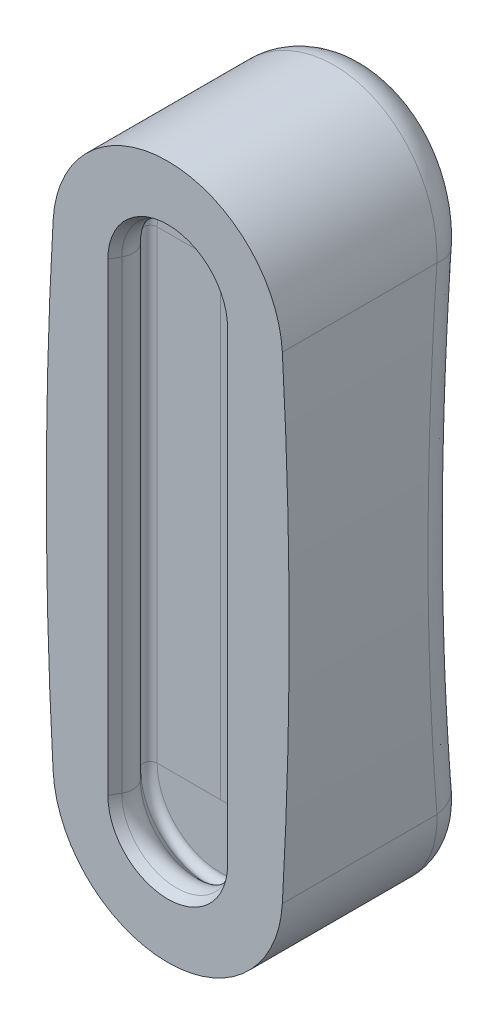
ISO-10303-21;
HEADER;
FILE_DESCRIPTION(('STEP AP214'),'2;1');
FILE_NAME('part.step','',(''),(''),'','','');
FILE_SCHEMA(('AUTOMOTIVE_DESIGN { 1 0 10303 214 1 1 1 1 }'));
ENDSEC;
DATA;
#1=APPLICATION_CONTEXT('core data for automotive mechanical design processes');
#2=APPLICATION_PROTOCOL_DEFINITION('international standard','automotive_design',2000,#1);
#3=PRODUCT_CONTEXT('',#1,'mechanical');
#4=PRODUCT('Part','Part','',(#3));
#5=PRODUCT_RELATED_PRODUCT_CATEGORY('part','',(#4));
#6=PRODUCT_DEFINITION_FORMATION('','',#4);
#7=PRODUCT_DEFINITION_CONTEXT('part definition',#1,'design');
#8=PRODUCT_DEFINITION('design','',#6,#7);
#9=PRODUCT_DEFINITION_SHAPE('','',#8);
#10=(LENGTH_UNIT() NAMED_UNIT(*) SI_UNIT(.MILLI.,.METRE.));
#11=(NAMED_UNIT(*) PLANE_ANGLE_UNIT() SI_UNIT($,.RADIAN.));
#12=(NAMED_UNIT(*) SI_UNIT($,.STERADIAN.) SOLID_ANGLE_UNIT());
#13=UNCERTAINTY_MEASURE_WITH_UNIT(LENGTH_MEASURE(1.E-05),#10,'distance_accuracy_value','');
#14=(GEOMETRIC_REPRESENTATION_CONTEXT(3) GLOBAL_UNCERTAINTY_ASSIGNED_CONTEXT((#13)) GLOBAL_UNIT_ASSIGNED_CONTEXT((#10,
#11,#12)) REPRESENTATION_CONTEXT('',''));
#15=CARTESIAN_POINT('',(0.,0.,0.));
#16=DIRECTION('',(0.,0.,1.));
#17=DIRECTION('',(1.,0.,0.));
#18=AXIS2_PLACEMENT_3D('',#15,#16,#17);
#19=CARTESIAN_POINT('',(739.775,-42.4944886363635,38.1));
#20=DIRECTION('',(0.,0.,-1.));
#21=DIRECTION('',(-1.,0.,0.));
#22=AXIS2_PLACEMENT_3D('',#19,#20,#21);
#23=CYLINDRICAL_SURFACE('',#22,762.);
#24=DIRECTION('',(0.,0.,-1.));
#25=VECTOR('',#24,1.);
#26=CARTESIAN_POINT('',(-20.9709416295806,1.20462227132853,38.1));
#27=LINE('',#26,#25);
#28=CARTESIAN_POINT('',(-20.9709416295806,1.20462227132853,38.1));
#29=VERTEX_POINT('',#28);
#30=CARTESIAN_POINT('',(-20.9709416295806,1.20462227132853,9.81606896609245));
#31=VERTEX_POINT('',#30);
#32=EDGE_CURVE('E217',#29,#31,#27,.T.);
#33=ORIENTED_EDGE('',*,*,#32,.T.);
#34=CARTESIAN_POINT('',(-1.78364397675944,99.9355872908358,-27.0165784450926));
#35=CARTESIAN_POINT('',(-8.59691601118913,101.006845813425,-27.5476433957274));
#36=CARTESIAN_POINT('',(-8.01522922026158,103.976577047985,-21.3273027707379));
#37=CARTESIAN_POINT('',(-2.56162891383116,96.0411192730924,-25.085879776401));
#38=CARTESIAN_POINT('',(-9.34534534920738,97.1021756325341,-25.5937168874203));
#39=CARTESIAN_POINT('',(-8.79975185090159,99.9716161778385,-19.3583724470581));
#40=CARTESIAN_POINT('',(-3.31498454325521,92.1034747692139,-23.2325366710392));
#41=CARTESIAN_POINT('',(-10.0725724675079,93.1420451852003,-23.7121317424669));
#42=CARTESIAN_POINT('',(-9.55943819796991,95.9222538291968,-17.468329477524));
#43=CARTESIAN_POINT('',(-4.76789545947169,84.1478807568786,-19.6843235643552));
#44=CARTESIAN_POINT('',(-11.4751940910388,85.1399344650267,-20.1104754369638));
#45=CARTESIAN_POINT('',(-11.0245584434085,87.7409457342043,-13.8498547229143));
#46=CARTESIAN_POINT('',(-5.46744862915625,80.1299280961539,-17.9894597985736));
#47=CARTESIAN_POINT('',(-12.1510872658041,81.0968652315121,-18.3889916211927));
#48=CARTESIAN_POINT('',(-11.72999020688,83.6089967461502,-12.1214292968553));
#49=CARTESIAN_POINT('',(-6.80847280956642,72.0181263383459,-14.7613451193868));
#50=CARTESIAN_POINT('',(-13.4467632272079,72.9334566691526,-15.1109216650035));
#51=CARTESIAN_POINT('',(-13.0822834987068,75.2670490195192,-8.82939155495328));
#52=CARTESIAN_POINT('',(-7.44991577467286,67.9242417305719,-13.2281721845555));
#53=CARTESIAN_POINT('',(-14.0670146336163,68.8118053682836,-13.5530625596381));
#54=CARTESIAN_POINT('',(-13.7291167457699,71.0570137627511,-7.2658587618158));
#55=CARTESIAN_POINT('',(-8.67014703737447,59.6691867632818,-10.3279976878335));
#56=CARTESIAN_POINT('',(-15.2468539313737,60.5003169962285,-10.6069718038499));
#57=CARTESIAN_POINT('',(-14.9596020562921,62.5677484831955,-4.30825506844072));
#58=CARTESIAN_POINT('',(-9.2489356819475,55.508016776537,-8.96099520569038));
#59=CARTESIAN_POINT('',(-15.8069180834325,56.3090415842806,-9.21748071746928));
#60=CARTESIAN_POINT('',(-15.5432544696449,58.2885188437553,-2.91418322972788));
#61=CARTESIAN_POINT('',(-10.3382506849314,47.1389174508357,-6.40066525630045));
#62=CARTESIAN_POINT('',(-16.8608582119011,47.8792776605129,-6.61580609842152));
#63=CARTESIAN_POINT('',(-16.6417233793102,49.6819735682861,-0.303153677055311));
#64=CARTESIAN_POINT('',(-10.8489902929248,42.9311811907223,-5.2067941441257));
#65=CARTESIAN_POINT('',(-17.3553783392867,43.639445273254,-5.40194052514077));
#66=CARTESIAN_POINT('',(-17.1567549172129,45.3548564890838,0.914358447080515));
#67=CARTESIAN_POINT('',(-11.8009432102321,34.4633890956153,-2.99062428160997));
#68=CARTESIAN_POINT('',(-18.2769211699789,35.1073642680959,-3.14941218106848));
#69=CARTESIAN_POINT('',(-18.1167074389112,36.646818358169,3.17441286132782));
#70=CARTESIAN_POINT('',(-12.2421584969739,30.2033347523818,-1.96832065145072));
#71=CARTESIAN_POINT('',(-18.7043491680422,30.8133923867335,-2.10972813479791));
#72=CARTESIAN_POINT('',(-18.5616304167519,32.2658988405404,4.21696012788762));
#73=CARTESIAN_POINT('',(-13.0519274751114,21.640124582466,-0.0983195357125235));
#74=CARTESIAN_POINT('',(-19.4886159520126,22.182657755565,-0.208633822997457));
#75=CARTESIAN_POINT('',(-19.3782041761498,23.459735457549,6.12399096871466));
#76=CARTESIAN_POINT('',(-13.4205074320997,17.3369849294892,0.749441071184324));
#77=CARTESIAN_POINT('',(-19.8458347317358,17.8440651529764,0.653718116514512));
#78=CARTESIAN_POINT('',(-19.7498814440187,19.034508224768,6.988538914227));
#79=CARTESIAN_POINT('',(-14.0827065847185,8.69356332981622,2.26857889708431));
#80=CARTESIAN_POINT('',(-20.487422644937,9.13042396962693,2.19838496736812));
#81=CARTESIAN_POINT('',(-20.4176452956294,10.1458576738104,8.5377586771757));
#82=CARTESIAN_POINT('',(-14.3763168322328,4.35327701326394,2.93993506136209));
#83=CARTESIAN_POINT('',(-20.7720815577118,4.7534124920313,2.88140647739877));
#84=CARTESIAN_POINT('',(-20.7137228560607,5.68242986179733,9.22240902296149));
#85=CARTESIAN_POINT('',(-14.8373607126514,-3.51698472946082,3.99212895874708));
#86=CARTESIAN_POINT('',(-21.2189788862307,-3.18345295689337,3.95159749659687));
#87=CARTESIAN_POINT('',(-21.1786410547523,-2.41112493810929,10.2954384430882));
#88=CARTESIAN_POINT('',(-15.0182034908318,-7.04209442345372,4.40401413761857));
#89=CARTESIAN_POINT('',(-21.3943200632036,-6.73863550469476,4.3706149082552));
#90=CARTESIAN_POINT('',(-21.3610035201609,-6.03624814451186,10.7154797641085));
#91=CARTESIAN_POINT('',(-15.3288382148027,-14.106415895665,5.1107116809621));
#92=CARTESIAN_POINT('',(-21.6954308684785,-13.8624703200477,5.08934698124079));
#93=CARTESIAN_POINT('',(-21.6742486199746,-13.3009967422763,11.4361713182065));
#94=CARTESIAN_POINT('',(-15.458627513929,-17.6456283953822,5.40551797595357));
#95=CARTESIAN_POINT('',(-21.8212923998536,-17.4322286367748,5.38928189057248));
#96=CARTESIAN_POINT('',(-21.8051285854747,-16.9406228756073,11.7368153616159));
#97=CARTESIAN_POINT('',(-15.6665577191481,-24.7339665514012,5.87749651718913));
#98=CARTESIAN_POINT('',(-22.0228741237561,-24.5808538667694,5.86932739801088));
#99=CARTESIAN_POINT('',(-22.0148061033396,-24.230069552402,12.2181400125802));
#100=CARTESIAN_POINT('',(-15.7446894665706,-28.2830938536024,6.05464790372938));
#101=CARTESIAN_POINT('',(-22.0986492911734,-28.160849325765,6.0495691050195));
#102=CARTESIAN_POINT('',(-22.0935944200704,-27.8798917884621,12.3987993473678));
#103=CARTESIAN_POINT('',(-15.8489127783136,-35.3863100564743,6.2909045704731));
#104=CARTESIAN_POINT('',(-22.1996982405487,-35.324823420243,6.2898721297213));
#105=CARTESIAN_POINT('',(-22.198693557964,-35.1846386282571,12.6397343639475));
#106=CARTESIAN_POINT('',(-15.875,-38.9403993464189,6.34999999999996));
#107=CARTESIAN_POINT('',(-22.225,-38.9099419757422,6.34999999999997));
#108=CARTESIAN_POINT('',(-22.2250000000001,-38.8395636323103,12.7));
#109=CARTESIAN_POINT('',(-15.875,-46.0485779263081,6.34999999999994));
#110=CARTESIAN_POINT('',(-22.225,-46.0790352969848,6.34999999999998));
#111=CARTESIAN_POINT('',(-22.2250000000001,-46.1494136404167,12.7));
#112=CARTESIAN_POINT('',(-15.8489127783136,-49.6026672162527,6.29090457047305));
#113=CARTESIAN_POINT('',(-22.1996982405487,-49.6641538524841,6.28987212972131));
#114=CARTESIAN_POINT('',(-22.198693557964,-49.8043386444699,12.6397343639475));
#115=CARTESIAN_POINT('',(-15.7446894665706,-56.7058834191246,6.05464790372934));
#116=CARTESIAN_POINT('',(-22.0986492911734,-56.828127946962,6.04956910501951));
#117=CARTESIAN_POINT('',(-22.0935944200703,-57.1090854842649,12.3987993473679));
#118=CARTESIAN_POINT('',(-15.6665577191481,-60.2550107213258,5.87749651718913));
#119=CARTESIAN_POINT('',(-22.0228741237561,-60.4081234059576,5.86932739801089));
#120=CARTESIAN_POINT('',(-22.0148061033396,-60.7589077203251,12.2181400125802));
#121=CARTESIAN_POINT('',(-15.458627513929,-67.3433488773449,5.40551797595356));
#122=CARTESIAN_POINT('',(-21.8212923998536,-67.5567486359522,5.38928189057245));
#123=CARTESIAN_POINT('',(-21.8051285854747,-68.0483543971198,11.7368153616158));
#124=CARTESIAN_POINT('',(-15.3288382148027,-70.8825613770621,5.11071168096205));
#125=CARTESIAN_POINT('',(-21.6954308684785,-71.1265069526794,5.08934698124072));
#126=CARTESIAN_POINT('',(-21.6742486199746,-71.6879805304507,11.4361713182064));
#127=CARTESIAN_POINT('',(-15.0182034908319,-77.9468828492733,4.40401413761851));
#128=CARTESIAN_POINT('',(-21.3943200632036,-78.2503417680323,4.37061490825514));
#129=CARTESIAN_POINT('',(-21.3610035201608,-78.9527291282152,10.7154797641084));
#130=CARTESIAN_POINT('',(-14.8373607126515,-81.4719925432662,3.99212895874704));
#131=CARTESIAN_POINT('',(-21.2189788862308,-81.8055243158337,3.95159749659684));
#132=CARTESIAN_POINT('',(-21.1786410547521,-82.5778523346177,10.2954384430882));
#133=CARTESIAN_POINT('',(-14.3763168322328,-89.342254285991,2.93993506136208));
#134=CARTESIAN_POINT('',(-20.7720815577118,-89.7423897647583,2.88140647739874));
#135=CARTESIAN_POINT('',(-20.7137228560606,-90.6714071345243,9.22240902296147));
#136=CARTESIAN_POINT('',(-14.0827065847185,-93.6825406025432,2.26857889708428));
#137=CARTESIAN_POINT('',(-20.487422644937,-94.1194012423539,2.19838496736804));
#138=CARTESIAN_POINT('',(-20.4176452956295,-95.1348349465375,8.53775867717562));
#139=CARTESIAN_POINT('',(-13.4205074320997,-102.325962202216,0.74944107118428));
#140=CARTESIAN_POINT('',(-19.8458347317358,-102.833042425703,0.653718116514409));
#141=CARTESIAN_POINT('',(-19.7498814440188,-104.023485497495,6.9885389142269));
#142=CARTESIAN_POINT('',(-13.0519274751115,-106.629101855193,-0.0983195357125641));
#143=CARTESIAN_POINT('',(-19.4886159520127,-107.171635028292,-0.208633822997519));
#144=CARTESIAN_POINT('',(-19.3782041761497,-108.448712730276,6.1239909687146));
#145=CARTESIAN_POINT('',(-12.2421584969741,-115.192312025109,-1.96832065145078));
#146=CARTESIAN_POINT('',(-18.7043491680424,-115.80236965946,-2.10972813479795));
#147=CARTESIAN_POINT('',(-18.5616304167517,-117.254876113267,4.21696012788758));
#148=CARTESIAN_POINT('',(-11.8009432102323,-119.452366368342,-2.99062428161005));
#149=CARTESIAN_POINT('',(-18.2769211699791,-120.096341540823,-3.14941218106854));
#150=CARTESIAN_POINT('',(-18.1167074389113,-121.635795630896,3.17441286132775));
#151=CARTESIAN_POINT('',(-10.8489902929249,-127.920158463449,-5.20679414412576));
#152=CARTESIAN_POINT('',(-17.3553783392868,-128.628422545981,-5.40194052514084));
#153=CARTESIAN_POINT('',(-17.1567549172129,-130.343833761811,0.914358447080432));
#154=CARTESIAN_POINT('',(-10.3382506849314,-132.127894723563,-6.40066525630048));
#155=CARTESIAN_POINT('',(-16.8608582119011,-132.86825493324,-6.61580609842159));
#156=CARTESIAN_POINT('',(-16.6417233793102,-134.670950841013,-0.303153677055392));
#157=CARTESIAN_POINT('',(-9.24893568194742,-140.496994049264,-8.96099520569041));
#158=CARTESIAN_POINT('',(-15.8069180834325,-141.298018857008,-9.21748071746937));
#159=CARTESIAN_POINT('',(-15.5432544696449,-143.277496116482,-2.91418322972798));
#160=CARTESIAN_POINT('',(-8.67014703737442,-144.658164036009,-10.3279976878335));
#161=CARTESIAN_POINT('',(-15.2468539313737,-145.489294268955,-10.60697180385));
#162=CARTESIAN_POINT('',(-14.9596020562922,-147.556725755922,-4.30825506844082));
#163=CARTESIAN_POINT('',(-7.44991577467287,-152.913219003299,-13.2281721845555));
#164=CARTESIAN_POINT('',(-14.0670146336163,-153.800782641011,-13.5530625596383));
#165=CARTESIAN_POINT('',(-13.72911674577,-156.045991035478,-7.26585876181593));
#166=CARTESIAN_POINT('',(-6.80847280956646,-157.007103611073,-14.7613451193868));
#167=CARTESIAN_POINT('',(-13.446763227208,-157.92243394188,-15.1109216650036));
#168=CARTESIAN_POINT('',(-13.0822834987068,-160.256026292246,-8.82939155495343));
#169=CARTESIAN_POINT('',(-5.46744862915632,-165.118905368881,-17.9894597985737));
#170=CARTESIAN_POINT('',(-12.1510872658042,-166.085842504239,-18.3889916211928));
#171=CARTESIAN_POINT('',(-11.7299902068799,-168.597974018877,-12.1214292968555));
#172=CARTESIAN_POINT('',(-4.76789545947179,-169.136858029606,-19.6843235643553));
#173=CARTESIAN_POINT('',(-11.4751940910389,-170.128911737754,-20.110475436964));
#174=CARTESIAN_POINT('',(-11.0245584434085,-172.729923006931,-13.8498547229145));
#175=CARTESIAN_POINT('',(-3.31498454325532,-177.092452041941,-23.2325366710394));
#176=CARTESIAN_POINT('',(-10.072572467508,-178.131022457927,-23.7121317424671));
#177=CARTESIAN_POINT('',(-9.55943819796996,-180.911231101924,-17.4683294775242));
#178=CARTESIAN_POINT('',(-2.56162891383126,-181.030096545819,-25.0858797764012));
#179=CARTESIAN_POINT('',(-9.34534534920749,-182.091152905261,-25.5937168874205));
#180=CARTESIAN_POINT('',(-8.79975185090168,-184.960593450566,-19.3583724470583));
#181=CARTESIAN_POINT('',(-1.78364397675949,-184.924564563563,-27.0165784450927));
#182=CARTESIAN_POINT('',(-8.59691601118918,-185.995823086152,-27.5476433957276));
#183=CARTESIAN_POINT('',(-8.01522922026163,-188.965554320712,-21.3273027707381));
#184=(BOUNDED_SURFACE() B_SPLINE_SURFACE(3,2,((#34,#35,#36),(#37,#38,#39),(#40,#41,#42),(#43,
#44,#45),(#46,#47,#48),(#49,#50,#51),(#52,#53,#54),(#55,#56,#57),(#58,#59,#60),(#61,#62,#63),
(#64,#65,#66),(#67,#68,#69),(#70,#71,#72),(#73,#74,#75),(#76,#77,#78),(#79,#80,#81),(#82,#83,
#84),(#85,#86,#87),(#88,#89,#90),(#91,#92,#93),(#94,#95,#96),(#97,#98,#99),(#100,#101,#102),
(#103,#104,#105),(#106,#107,#108),(#109,#110,#111),(#112,#113,#114),(#115,#116,#117),(#118,#119,
#120),(#121,#122,#123),(#124,#125,#126),(#127,#128,#129),(#130,#131,#132),(#133,#134,#135),
(#136,#137,#138),(#139,#140,#141),(#142,#143,#144),(#145,#146,#147),(#148,#149,#150),(#151,#152,
#153),(#154,#155,#156),(#157,#158,#159),(#160,#161,#162),(#163,#164,#165),(#166,#167,#168),
(#169,#170,#171),(#172,#173,#174),(#175,#176,#177),(#178,#179,#180),(#181,#182,#183)),
.UNSPECIFIED.,.F.,.F.,.F.) B_SPLINE_SURFACE_WITH_KNOTS((4,2,2,2,2,2,2,2,2,2,2,2,2,2,2,2,2,2,2,2,
2,2,2,2,4),(3,3),(0.,13.5009718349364,27.0024746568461,40.510459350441,54.0183692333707,
67.4828995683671,80.9470468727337,94.4063164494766,107.867191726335,118.736600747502,
129.606573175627,140.478472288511,151.351278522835,162.22408475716,173.095983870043,
183.965956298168,194.835365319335,208.296240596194,221.755510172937,235.219657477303,
248.6841878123,262.192097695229,275.700082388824,289.201585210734,302.702557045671),(0.,1.),
.UNSPECIFIED.) GEOMETRIC_REPRESENTATION_ITEM() RATIONAL_B_SPLINE_SURFACE(((1.,0.676248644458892,
1.),(1.,0.677974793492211,1.),(1.,0.679642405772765,1.),(1.,0.682852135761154,1.),(1.,
0.684394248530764,1.),(1.,0.687345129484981,1.),(1.,0.688753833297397,1.),(1.,0.691429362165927,
1.),(1.,0.692696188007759,1.),(1.,0.69507710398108,1.),(1.,0.696191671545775,1.),(1.,
0.698266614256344,1.),(1.,0.699226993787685,1.),(1.,0.700987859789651,1.),(1.,0.701788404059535,
1.),(1.,0.703225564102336,1.),(1.,0.703862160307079,1.),(1.,0.704861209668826,1.),(1.,
0.70525284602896,1.),(1.,0.705925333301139,1.),(1.,0.706206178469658,1.),(1.,0.706656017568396,
1.),(1.,0.706824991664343,1.),(1.,0.707050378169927,1.),(1.,0.707106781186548,1.),(1.,
0.707106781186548,1.),(1.,0.707050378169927,1.),(1.,0.706824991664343,1.),(1.,0.706656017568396,
1.),(1.,0.706206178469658,1.),(1.,0.705925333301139,1.),(1.,0.70525284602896,1.),(1.,
0.704861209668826,1.),(1.,0.703862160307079,1.),(1.,0.703225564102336,1.),(1.,0.701788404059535,
1.),(1.,0.700987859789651,1.),(1.,0.699226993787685,1.),(1.,0.698266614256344,1.),(1.,
0.696191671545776,1.),(1.,0.69507710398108,1.),(1.,0.692696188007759,1.),(1.,0.691429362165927,
1.),(1.,0.688753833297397,1.),(1.,0.687345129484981,1.),(1.,0.684394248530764,1.),(1.,
0.682852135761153,1.),(1.,0.679642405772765,1.),(1.,0.67797479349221,1.),(1.,0.676248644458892,1.))) REPRESENTATION_ITEM('') SURFACE());
#185=CARTESIAN_POINT('',(-8.01522922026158,103.976577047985,-21.3273027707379));
#186=CARTESIAN_POINT('',(-8.79975185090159,99.9716161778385,-19.3583724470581));
#187=CARTESIAN_POINT('',(-9.55943819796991,95.9222538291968,-17.468329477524));
#188=CARTESIAN_POINT('',(-11.0245584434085,87.7409457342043,-13.8498547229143));
#189=CARTESIAN_POINT('',(-11.72999020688,83.6089967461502,-12.1214292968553));
#190=CARTESIAN_POINT('',(-13.0822834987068,75.2670490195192,-8.82939155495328));
#191=CARTESIAN_POINT('',(-13.7291167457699,71.0570137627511,-7.2658587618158));
#192=CARTESIAN_POINT('',(-14.9596020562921,62.5677484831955,-4.30825506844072));
#193=CARTESIAN_POINT('',(-15.5432544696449,58.2885188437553,-2.91418322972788));
#194=CARTESIAN_POINT('',(-16.6417233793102,49.6819735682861,-0.303153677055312));
#195=CARTESIAN_POINT('',(-17.1567549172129,45.3548564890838,0.914358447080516));
#196=CARTESIAN_POINT('',(-18.1167074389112,36.646818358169,3.17441286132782));
#197=CARTESIAN_POINT('',(-18.5616304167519,32.2658988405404,4.21696012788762));
#198=CARTESIAN_POINT('',(-19.3782041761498,23.459735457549,6.12399096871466));
#199=CARTESIAN_POINT('',(-19.7498814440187,19.034508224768,6.988538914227));
#200=CARTESIAN_POINT('',(-20.4176452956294,10.1458576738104,8.53775867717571));
#201=CARTESIAN_POINT('',(-20.7137228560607,5.68242986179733,9.22240902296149));
#202=CARTESIAN_POINT('',(-21.1786410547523,-2.41112493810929,10.2954384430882));
#203=CARTESIAN_POINT('',(-21.3610035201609,-6.03624814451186,10.7154797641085));
#204=CARTESIAN_POINT('',(-21.6742486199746,-13.3009967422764,11.4361713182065));
#205=CARTESIAN_POINT('',(-21.8051285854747,-16.9406228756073,11.7368153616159));
#206=CARTESIAN_POINT('',(-22.0148061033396,-24.230069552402,12.2181400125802));
#207=CARTESIAN_POINT('',(-22.0935944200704,-27.8798917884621,12.3987993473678));
#208=CARTESIAN_POINT('',(-22.198693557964,-35.1846386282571,12.6397343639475));
#209=CARTESIAN_POINT('',(-22.2250000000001,-38.8395636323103,12.7));
#210=CARTESIAN_POINT('',(-22.2250000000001,-46.1494136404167,12.7));
#211=CARTESIAN_POINT('',(-22.198693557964,-49.8043386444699,12.6397343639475));
#212=CARTESIAN_POINT('',(-22.0935944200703,-57.1090854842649,12.3987993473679));
#213=CARTESIAN_POINT('',(-22.0148061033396,-60.7589077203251,12.2181400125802));
#214=CARTESIAN_POINT('',(-21.8051285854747,-68.0483543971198,11.7368153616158));
#215=CARTESIAN_POINT('',(-21.6742486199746,-71.6879805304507,11.4361713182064));
#216=CARTESIAN_POINT('',(-21.3610035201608,-78.9527291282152,10.7154797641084));
#217=CARTESIAN_POINT('',(-21.1786410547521,-82.5778523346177,10.2954384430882));
#218=CARTESIAN_POINT('',(-20.7137228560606,-90.6714071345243,9.22240902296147));
#219=CARTESIAN_POINT('',(-20.4176452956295,-95.1348349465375,8.53775867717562));
#220=CARTESIAN_POINT('',(-19.7498814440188,-104.023485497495,6.9885389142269));
#221=CARTESIAN_POINT('',(-19.3782041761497,-108.448712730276,6.1239909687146));
#222=CARTESIAN_POINT('',(-18.5616304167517,-117.254876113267,4.21696012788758));
#223=CARTESIAN_POINT('',(-18.1167074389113,-121.635795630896,3.17441286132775));
#224=CARTESIAN_POINT('',(-17.1567549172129,-130.343833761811,0.914358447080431));
#225=CARTESIAN_POINT('',(-16.6417233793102,-134.670950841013,-0.303153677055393));
#226=CARTESIAN_POINT('',(-15.5432544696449,-143.277496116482,-2.91418322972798));
#227=CARTESIAN_POINT('',(-14.9596020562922,-147.556725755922,-4.30825506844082));
#228=CARTESIAN_POINT('',(-13.72911674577,-156.045991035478,-7.26585876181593));
#229=CARTESIAN_POINT('',(-13.0822834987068,-160.256026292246,-8.82939155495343));
#230=CARTESIAN_POINT('',(-11.7299902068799,-168.597974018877,-12.1214292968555));
#231=CARTESIAN_POINT('',(-11.0245584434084,-172.729923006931,-13.8498547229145));
#232=CARTESIAN_POINT('',(-9.55943819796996,-180.911231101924,-17.4683294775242));
#233=CARTESIAN_POINT('',(-8.79975185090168,-184.960593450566,-19.3583724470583));
#234=CARTESIAN_POINT('',(-8.01522922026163,-188.965554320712,-21.3273027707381));
#235=B_SPLINE_CURVE_WITH_KNOTS('',3,(#185,#186,#187,#188,#189,#190,#191,#192,#193,#194,#195,
#196,#197,#198,#199,#200,#201,#202,#203,#204,#205,#206,#207,#208,#209,#210,#211,#212,#213,#214,
#215,#216,#217,#218,#219,#220,#221,#222,#223,#224,#225,#226,#227,#228,#229,#230,#231,#232,#233,
#234),.UNSPECIFIED.,.F.,.F.,(4,2,2,2,2,2,2,2,2,2,2,2,2,2,2,2,2,2,2,2,2,2,2,2,4),(0.,
13.5009718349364,27.0024746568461,40.510459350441,54.0183692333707,67.4828995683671,
80.9470468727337,94.4063164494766,107.867191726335,118.736600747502,129.606573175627,
140.478472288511,151.351278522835,162.22408475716,173.095983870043,183.965956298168,
194.835365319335,208.296240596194,221.755510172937,235.219657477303,248.6841878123,
262.192097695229,275.700082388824,289.201585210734,302.702557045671),.UNSPECIFIED.);
#236=CARTESIAN_POINT('',(-20.9709416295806,-86.1935995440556,9.81606896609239));
#237=VERTEX_POINT('',#236);
#238=EDGE_CURVE('E335',#31,#237,#235,.T.);
#239=ORIENTED_EDGE('',*,*,#238,.T.);
#240=DIRECTION('',(0.,0.,-1.));
#241=VECTOR('',#240,1.);
#242=CARTESIAN_POINT('',(-20.9709416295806,-86.1935995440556,38.1));
#243=LINE('',#242,#241);
#244=CARTESIAN_POINT('',(-20.9709416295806,-86.1935995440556,38.1));
#245=VERTEX_POINT('',#244);
#246=EDGE_CURVE('E223',#245,#237,#243,.T.);
#247=ORIENTED_EDGE('',*,*,#246,.F.);
#248=CARTESIAN_POINT('',(739.775,-42.4944886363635,38.1));
#249=DIRECTION('',(0.,0.,1.));
#250=DIRECTION('',(1.,0.,0.));
#251=AXIS2_PLACEMENT_3D('',#248,#249,#250);
#252=CIRCLE('',#251,762.);
#253=EDGE_CURVE('E207',#29,#245,#252,.T.);
#254=ORIENTED_EDGE('',*,*,#253,.F.);
#255=EDGE_LOOP('',(#33,#239,#247,#254));
#256=FACE_BOUND('',#255,.T.);
#257=ADVANCED_FACE('F32',(#256),#23,.T.);
#258=CARTESIAN_POINT('',(0.,-84.9889772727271,38.1));
#259=DIRECTION('',(0.,0.,-1.));
#260=DIRECTION('',(-1.,0.,0.));
#261=AXIS2_PLACEMENT_3D('',#258,#259,#260);
#262=CYLINDRICAL_SURFACE('',#261,21.0055113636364);
#263=ORIENTED_EDGE('',*,*,#246,.T.);
#264=CARTESIAN_POINT('',(-14.079246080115,-80.1736004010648,4.12867035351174));
#265=CARTESIAN_POINT('',(-19.9868251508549,-78.4897347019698,4.327903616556));
#266=CARTESIAN_POINT('',(-20.1795594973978,-79.1565775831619,10.4346836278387));
#267=CARTESIAN_POINT('',(-14.1943607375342,-80.5639986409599,4.08248638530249));
#268=CARTESIAN_POINT('',(-20.1668211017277,-79.0414864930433,4.26473102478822));
#269=CARTESIAN_POINT('',(-20.3445515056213,-79.7272094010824,10.3875851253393));
#270=CARTESIAN_POINT('',(-14.2924600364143,-80.9590532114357,4.03500877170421));
#271=CARTESIAN_POINT('',(-20.3236636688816,-79.600159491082,4.19940529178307));
#272=CARTESIAN_POINT('',(-20.4851556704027,-80.30464721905,10.3391673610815));
#273=CARTESIAN_POINT('',(-14.4541844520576,-81.7555778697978,3.93775648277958));
#274=CARTESIAN_POINT('',(-20.5908768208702,-80.7289124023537,4.06461891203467));
#275=CARTESIAN_POINT('',(-20.7169527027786,-81.4689001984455,10.2399892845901));
#276=CARTESIAN_POINT('',(-14.5178125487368,-82.1570474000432,3.88798200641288));
#277=CARTESIAN_POINT('',(-20.7011450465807,-81.2991761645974,3.99512808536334));
#278=CARTESIAN_POINT('',(-20.808149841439,-82.0557145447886,10.1892291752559));
#279=CARTESIAN_POINT('',(-14.610134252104,-82.9632511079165,3.78645871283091));
#280=CARTESIAN_POINT('',(-20.8742198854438,-82.4471064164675,3.85234320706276));
#281=CARTESIAN_POINT('',(-20.9404730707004,-83.2341150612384,10.0856955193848));
#282=CARTESIAN_POINT('',(-14.6388557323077,-83.3679824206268,3.73471150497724));
#283=CARTESIAN_POINT('',(-20.9369292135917,-83.0249412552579,3.77902093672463));
#284=CARTESIAN_POINT('',(-20.9816391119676,-83.8256970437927,10.0329236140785));
#285=CARTESIAN_POINT('',(-14.661328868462,-84.1781600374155,3.62954696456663));
#286=CARTESIAN_POINT('',(-21.0144167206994,-84.1848504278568,3.6288979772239));
#287=CARTESIAN_POINT('',(-21.0138495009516,-85.0099060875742,9.92567660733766));
#288=CARTESIAN_POINT('',(-14.6550803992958,-84.583606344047,3.57612962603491));
#289=CARTESIAN_POINT('',(-21.0290317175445,-84.7670790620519,3.55206677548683));
#290=CARTESIAN_POINT('',(-21.0048936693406,-85.6025331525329,9.87120149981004));
#291=CARTESIAN_POINT('',(-14.6075475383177,-85.3950315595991,3.46764892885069));
#292=CARTESIAN_POINT('',(-21.0098419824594,-85.9359889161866,3.39485665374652));
#293=CARTESIAN_POINT('',(-20.9367655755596,-86.7885657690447,9.76057267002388));
#294=CARTESIAN_POINT('',(-14.5660322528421,-85.8009963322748,3.41257703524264));
#295=CARTESIAN_POINT('',(-20.9755262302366,-86.5227905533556,3.31443048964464));
#296=CARTESIAN_POINT('',(-20.8772623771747,-87.3819506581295,9.70441024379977));
#297=CARTESIAN_POINT('',(-14.4479722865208,-86.6080302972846,3.30153705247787));
#298=CARTESIAN_POINT('',(-20.8576706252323,-87.6934530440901,3.15102298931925));
#299=CARTESIAN_POINT('',(-20.7080489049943,-88.5615647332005,9.59117144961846));
#300=CARTESIAN_POINT('',(-14.3714145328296,-87.0090976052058,3.24556863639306));
#301=CARTESIAN_POINT('',(-20.7738992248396,-88.2774109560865,3.06801482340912));
#302=CARTESIAN_POINT('',(-20.5983198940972,-89.1477911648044,9.53409474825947));
#303=CARTESIAN_POINT('',(-14.183859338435,-87.8032236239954,3.13324124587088));
#304=CARTESIAN_POINT('',(-20.5571652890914,-89.4381815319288,2.9001261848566));
#305=CARTESIAN_POINT('',(-20.3295000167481,-90.3085381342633,9.41954305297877));
#306=CARTESIAN_POINT('',(-14.0728725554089,-88.1962847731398,3.07688239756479));
#307=CARTESIAN_POINT('',(-20.4239892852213,-90.0150574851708,2.81522496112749));
#308=CARTESIAN_POINT('',(-20.1704244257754,-90.8830622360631,9.36206818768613));
#309=CARTESIAN_POINT('',(-13.8172382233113,-88.9717603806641,2.96425661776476));
#310=CARTESIAN_POINT('',(-20.1086841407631,-91.1580119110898,2.6442351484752));
#311=CARTESIAN_POINT('',(-19.804027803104,-92.0165485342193,9.24721219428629));
#312=CARTESIAN_POINT('',(-13.6725899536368,-89.3541746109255,2.90798968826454));
#313=CARTESIAN_POINT('',(-19.9263174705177,-91.7241065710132,2.55813155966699));
#314=CARTESIAN_POINT('',(-19.5967057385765,-92.5755103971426,9.18983106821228));
#315=CARTESIAN_POINT('',(-13.3506344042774,-90.1056641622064,2.79607455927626));
#316=CARTESIAN_POINT('',(-19.5131137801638,-92.8416072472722,2.38552869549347));
#317=CARTESIAN_POINT('',(-19.1352519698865,-93.6739370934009,9.07569979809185));
#318=CARTESIAN_POINT('',(-13.1733255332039,-90.4747388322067,2.74042639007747));
#319=CARTESIAN_POINT('',(-19.2820387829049,-93.3929810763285,2.29902203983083));
#320=CARTESIAN_POINT('',(-18.8811179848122,-94.2134009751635,9.01894968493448));
#321=CARTESIAN_POINT('',(-12.7872755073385,-91.1969124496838,2.63030122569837));
#322=CARTESIAN_POINT('',(-18.7721872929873,-94.4770446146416,2.12649038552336));
#323=CARTESIAN_POINT('',(-18.3277986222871,-95.2689775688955,8.90664382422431));
#324=CARTESIAN_POINT('',(-12.578534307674,-91.5500113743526,2.57582423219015));
#325=CARTESIAN_POINT('',(-18.4931860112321,-95.0096528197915,2.04046675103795));
#326=CARTESIAN_POINT('',(-18.0286131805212,-95.7850902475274,8.85108807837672));
#327=CARTESIAN_POINT('',(-12.1310199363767,-92.2377605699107,2.4685979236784));
#328=CARTESIAN_POINT('',(-17.8885087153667,-96.0522309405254,1.86983561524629));
#329=CARTESIAN_POINT('',(-17.3871979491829,-96.7903498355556,8.74173847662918));
#330=CARTESIAN_POINT('',(-11.8922425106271,-92.5724082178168,2.4158488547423));
#331=CARTESIAN_POINT('',(-17.5626234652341,-96.5620653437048,1.78523927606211));
#332=CARTESIAN_POINT('',(-17.0449620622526,-97.2794929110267,8.68794487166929));
#333=CARTESIAN_POINT('',(-11.3863245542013,-93.2207784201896,2.31265873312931));
#334=CARTESIAN_POINT('',(-16.8656356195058,-97.5549206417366,1.61848901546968));
#335=CARTESIAN_POINT('',(-16.319837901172,-98.2271935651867,8.58271138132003));
#336=CARTESIAN_POINT('',(-11.1191848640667,-93.5345015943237,2.26221761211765));
#337=CARTESIAN_POINT('',(-16.4943650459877,-98.0377620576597,1.5363557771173));
#338=CARTESIAN_POINT('',(-15.9369508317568,-98.6857520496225,8.53127142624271));
#339=CARTESIAN_POINT('',(-10.558952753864,-94.138124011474,2.16431083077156));
#340=CARTESIAN_POINT('',(-15.7092208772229,-98.9715756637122,1.37575762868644));
#341=CARTESIAN_POINT('',(-15.1339790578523,-99.5680463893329,8.4314258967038));
#342=CARTESIAN_POINT('',(-10.2659146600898,-94.4280707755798,2.11683928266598));
#343=CARTESIAN_POINT('',(-15.2953090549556,-99.4223925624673,1.29731501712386));
#344=CARTESIAN_POINT('',(-14.7139722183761,-99.9918517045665,8.38301431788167));
#345=CARTESIAN_POINT('',(-9.6555547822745,-94.9826179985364,2.02532933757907));
#346=CARTESIAN_POINT('',(-14.4266477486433,-100.289014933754,1.14503601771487));
#347=CARTESIAN_POINT('',(-13.8391531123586,-100.802414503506,8.28969229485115));
#348=CARTESIAN_POINT('',(-9.33824175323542,-95.2472275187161,1.98128971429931));
#349=CARTESIAN_POINT('',(-13.9718444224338,-100.704575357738,1.07123659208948));
#350=CARTESIAN_POINT('',(-13.3843533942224,-101.189185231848,8.24478060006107));
#351=CARTESIAN_POINT('',(-8.68142845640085,-95.7492573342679,1.89715299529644));
#352=CARTESIAN_POINT('',(-13.023958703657,-101.496888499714,0.929308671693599));
#353=CARTESIAN_POINT('',(-12.4429533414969,-101.922985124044,8.15897780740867));
#354=CARTESIAN_POINT('',(-8.34192633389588,-95.9866753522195,1.85705622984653));
#355=CARTESIAN_POINT('',(-12.5308699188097,-101.873354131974,0.861226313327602));
#356=CARTESIAN_POINT('',(-11.9563503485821,-102.27001095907,8.11808704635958));
#357=CARTESIAN_POINT('',(-7.64316091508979,-96.4324863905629,1.78130991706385));
#358=CARTESIAN_POINT('',(-11.5096994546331,-102.583556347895,0.731826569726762));
#359=CARTESIAN_POINT('',(-10.9548209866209,-102.921637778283,8.04084080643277));
#360=CARTESIAN_POINT('',(-7.28389781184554,-96.6408796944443,1.74566032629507));
#361=CARTESIAN_POINT('',(-10.9816859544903,-102.916997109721,0.670559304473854));
#362=CARTESIAN_POINT('',(-10.4398948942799,-103.226239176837,8.00448528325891));
#363=CARTESIAN_POINT('',(-6.55229913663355,-97.0248685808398,1.67963736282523));
#364=CARTESIAN_POINT('',(-9.90056344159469,-103.534012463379,0.556473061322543));
#365=CARTESIAN_POINT('',(-9.39130614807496,-103.78750266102,7.93715493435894));
#366=CARTESIAN_POINT('',(-6.18015454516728,-97.2008046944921,1.64920947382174));
#367=CARTESIAN_POINT('',(-9.34791959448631,-103.817828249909,0.503615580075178));
#368=CARTESIAN_POINT('',(-8.85791722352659,-104.044662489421,7.90612451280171));
#369=CARTESIAN_POINT('',(-5.42170461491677,-97.5213644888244,1.59354178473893));
#370=CARTESIAN_POINT('',(-8.21633308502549,-104.336875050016,0.406459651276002));
#371=CARTESIAN_POINT('',(-7.77084300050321,-104.513213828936,7.84935449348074));
#372=CARTESIAN_POINT('',(-5.03539940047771,-97.665988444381,1.56830193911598));
#373=CARTESIAN_POINT('',(-7.63759876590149,-104.571840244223,0.36220945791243));
#374=CARTESIAN_POINT('',(-7.21715788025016,-104.724605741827,7.82361484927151));
#375=CARTESIAN_POINT('',(-4.25142552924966,-97.9227871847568,1.52334391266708));
#376=CARTESIAN_POINT('',(-6.4585609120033,-104.9903588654,0.283084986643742));
#377=CARTESIAN_POINT('',(-6.09350059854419,-105.099959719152,7.777766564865));
#378=CARTESIAN_POINT('',(-3.85375745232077,-98.0349636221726,1.50362545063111));
#379=CARTESIAN_POINT('',(-5.85853183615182,-105.173681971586,0.248253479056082));
#380=CARTESIAN_POINT('',(-5.5235292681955,-105.26392419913,7.75765763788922));
#381=CARTESIAN_POINT('',(-3.04993211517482,-98.2259879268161,1.4699730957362));
#382=CARTESIAN_POINT('',(-4.64202684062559,-105.486626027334,0.188632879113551));
#383=CARTESIAN_POINT('',(-4.37141919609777,-105.543137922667,7.72333889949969));
#384=CARTESIAN_POINT('',(-2.64377493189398,-98.3048360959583,1.45603915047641));
#385=CARTESIAN_POINT('',(-4.02588016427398,-105.616062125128,0.163878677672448));
#386=CARTESIAN_POINT('',(-3.78928056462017,-105.658387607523,7.70912903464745));
#387=CARTESIAN_POINT('',(-1.83148113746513,-98.4277377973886,1.43429298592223));
#388=CARTESIAN_POINT('',(-2.79107043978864,-105.818156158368,0.125169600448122));
#389=CARTESIAN_POINT('',(-2.62503278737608,-105.838028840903,7.6869522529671));
#390=CARTESIAN_POINT('',(-1.42541841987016,-98.472247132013,1.42640058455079));
#391=CARTESIAN_POINT('',(-2.1729032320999,-105.891437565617,0.111096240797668));
#392=CARTESIAN_POINT('',(-2.043029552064,-105.903086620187,7.67890356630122));
#393=CARTESIAN_POINT('',(-0.61084991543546,-98.5278713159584,1.41653425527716));
#394=CARTESIAN_POINT('',(-0.931478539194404,-105.983099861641,0.0934862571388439));
#395=CARTESIAN_POINT('',(-0.875521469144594,-105.984390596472,7.66884186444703));
#396=CARTESIAN_POINT('',(-0.202344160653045,-98.5389866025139,1.41456024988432));
#397=CARTESIAN_POINT('',(-0.308601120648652,-106.001424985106,0.0899603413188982));
#398=CARTESIAN_POINT('',(-0.290016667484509,-106.000637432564,7.66682877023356));
#399=CARTESIAN_POINT('',(0.614155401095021,-98.5277363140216,1.41655699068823));
#400=CARTESIAN_POINT('',(0.936558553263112,-105.982875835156,0.0935266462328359));
#401=CARTESIAN_POINT('',(0.880259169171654,-105.984193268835,7.66886505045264));
#402=CARTESIAN_POINT('',(1.02214922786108,-98.5053720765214,1.42052749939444));
#403=CARTESIAN_POINT('',(1.55845479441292,-105.946015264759,0.100616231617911));
#404=CARTESIAN_POINT('',(1.46503023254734,-105.951504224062,7.6729141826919));
#405=CARTESIAN_POINT('',(1.83470590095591,-98.4273408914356,1.43435968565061));
#406=CARTESIAN_POINT('',(2.79601743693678,-105.817498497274,0.125287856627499));
#407=CARTESIAN_POINT('',(2.62965478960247,-105.837448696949,7.68702027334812));
#408=CARTESIAN_POINT('',(2.23926875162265,-98.3716739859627,1.44422135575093));
#409=CARTESIAN_POINT('',(3.41130996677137,-105.725921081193,0.142854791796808));
#410=CARTESIAN_POINT('',(3.20950828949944,-105.756082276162,7.69707722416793));
#411=CARTESIAN_POINT('',(3.03958607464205,-98.2279183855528,1.46962585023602));
#412=CARTESIAN_POINT('',(4.62638063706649,-105.48978523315,0.188015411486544));
#413=CARTESIAN_POINT('',(4.35659038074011,-105.54595960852,7.72298477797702));
#414=CARTESIAN_POINT('',(3.43537947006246,-98.1400316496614,1.48513328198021));
#415=CARTESIAN_POINT('',(5.22588691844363,-105.345696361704,0.21552008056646));
#416=CARTESIAN_POINT('',(4.92387475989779,-105.417498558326,7.7387992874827));
#417=CARTESIAN_POINT('',(4.21806411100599,-97.9324339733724,1.52164149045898));
#418=CARTESIAN_POINT('',(6.40830480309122,-105.006100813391,0.280079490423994));
#419=CARTESIAN_POINT('',(6.04568420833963,-105.114060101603,7.77603043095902));
#420=CARTESIAN_POINT('',(4.60495225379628,-97.8127121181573,1.54264415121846));
#421=CARTESIAN_POINT('',(6.99091585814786,-104.810766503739,0.317101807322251));
#422=CARTESIAN_POINT('',(6.60020483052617,-104.939066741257,7.79744898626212));
#423=CARTESIAN_POINT('',(5.36691539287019,-97.5423925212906,1.58986623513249));
#424=CARTESIAN_POINT('',(8.13437456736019,-104.370993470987,0.400021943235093));
#425=CARTESIAN_POINT('',(7.6923144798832,-104.543949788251,7.84560616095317));
#426=CARTESIAN_POINT('',(5.74199261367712,-97.3918006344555,1.61608466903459));
#427=CARTESIAN_POINT('',(8.69498559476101,-104.126794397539,0.445875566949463));
#428=CARTESIAN_POINT('',(8.22990669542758,-104.323834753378,7.87234377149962));
#429=CARTESIAN_POINT('',(6.47783536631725,-97.0608509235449,1.67341125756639));
#430=CARTESIAN_POINT('',(9.79014760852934,-103.591983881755,0.54567016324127));
#431=CARTESIAN_POINT('',(9.28457841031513,-103.840096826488,7.93080553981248));
#432=CARTESIAN_POINT('',(6.83860053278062,-96.8804923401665,1.70451953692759));
#433=CARTESIAN_POINT('',(10.3245196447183,-103.301628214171,0.599565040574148));
#434=CARTESIAN_POINT('',(9.80165738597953,-103.576472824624,7.96252982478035));
#435=CARTESIAN_POINT('',(7.54546959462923,-96.490173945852,1.77144258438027));
#436=CARTESIAN_POINT('',(11.3663330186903,-102.675744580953,0.714890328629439));
#437=CARTESIAN_POINT('',(10.8148015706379,-103.005957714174,8.03077808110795));
#438=CARTESIAN_POINT('',(7.89147262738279,-96.2800431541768,1.80728445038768));
#439=CARTESIAN_POINT('',(11.8734897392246,-102.340223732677,0.776317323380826));
#440=CARTESIAN_POINT('',(11.3107222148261,-102.698816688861,8.0673296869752));
#441=CARTESIAN_POINT('',(8.56415779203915,-95.8325434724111,1.88309447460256));
#442=CARTESIAN_POINT('',(12.8538800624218,-101.62879845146,0.905468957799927));
#443=CARTESIAN_POINT('',(12.2748711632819,-102.044721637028,8.14464089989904));
#444=CARTESIAN_POINT('',(8.89083943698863,-95.5951738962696,1.92306273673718));
#445=CARTESIAN_POINT('',(13.3270652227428,-101.253166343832,0.973147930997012));
#446=CARTESIAN_POINT('',(12.7430987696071,-101.69776660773,8.18540061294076));
#447=CARTESIAN_POINT('',(9.52264931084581,-95.0949401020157,2.00664939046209));
#448=CARTESIAN_POINT('',(14.2364154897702,-100.465225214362,1.11377228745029));
#449=CARTESIAN_POINT('',(13.648661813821,-100.966591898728,8.27064244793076));
#450=CARTESIAN_POINT('',(9.82777977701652,-94.8320785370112,2.05026740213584));
#451=CARTESIAN_POINT('',(14.6725999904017,-100.053179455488,1.18667589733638));
#452=CARTESIAN_POINT('',(14.086000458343,-100.582376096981,8.31512418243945));
#453=CARTESIAN_POINT('',(10.4146263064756,-94.2825907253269,2.14067846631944));
#454=CARTESIAN_POINT('',(15.5056238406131,-99.195984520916,1.33675249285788));
#455=CARTESIAN_POINT('',(14.9271182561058,-99.7792084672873,8.40732556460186));
#456=CARTESIAN_POINT('',(10.6963323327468,-93.9959543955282,2.18747286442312));
#457=CARTESIAN_POINT('',(15.9025198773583,-98.7510550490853,1.41389277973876));
#458=CARTESIAN_POINT('',(15.3308830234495,-99.3602419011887,8.45504658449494));
#459=CARTESIAN_POINT('',(11.2379511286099,-93.3970193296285,2.28435113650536));
#460=CARTESIAN_POINT('',(16.6596824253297,-97.8259486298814,1.57244486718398));
#461=CARTESIAN_POINT('',(16.1071766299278,-98.4847989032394,8.55384323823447));
#462=CARTESIAN_POINT('',(11.4975203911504,-93.0844276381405,2.33447074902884));
#463=CARTESIAN_POINT('',(17.0195335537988,-97.3455586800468,1.65387723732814));
#464=CARTESIAN_POINT('',(16.4792131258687,-98.0278942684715,8.60495531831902));
#465=CARTESIAN_POINT('',(11.9887220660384,-92.4393426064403,2.43685656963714));
#466=CARTESIAN_POINT('',(17.6945419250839,-96.3591186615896,1.81898086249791));
#467=CARTESIAN_POINT('',(17.1832446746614,-97.0849954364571,8.70936858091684));
#468=CARTESIAN_POINT('',(12.2203657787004,-92.1068573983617,2.48912189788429));
#469=CARTESIAN_POINT('',(18.0098840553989,-95.8532467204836,1.90263243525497));
#470=CARTESIAN_POINT('',(17.5152559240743,-96.5990131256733,8.7626688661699));
#471=CARTESIAN_POINT('',(12.6543167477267,-91.4241632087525,2.59527688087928));
#472=CARTESIAN_POINT('',(18.5947044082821,-94.8196103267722,2.07123391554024));
#473=CARTESIAN_POINT('',(18.137230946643,-95.6011422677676,8.87092592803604));
#474=CARTESIAN_POINT('',(12.8566210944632,-91.0739524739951,2.64916669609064));
#475=CARTESIAN_POINT('',(18.8643759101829,-94.2919640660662,2.15617469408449));
#476=CARTESIAN_POINT('',(18.4271905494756,-95.0892511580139,8.92588286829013));
#477=CARTESIAN_POINT('',(13.2305096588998,-90.3582783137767,2.7580242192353));
#478=CARTESIAN_POINT('',(19.3567799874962,-93.2187951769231,2.32642577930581));
#479=CARTESIAN_POINT('',(18.9630790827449,-94.0431745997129,9.03689598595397));
#480=CARTESIAN_POINT('',(13.4020948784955,-89.992815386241,2.81299189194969));
#481=CARTESIAN_POINT('',(19.5797312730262,-92.6733460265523,2.41173571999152));
#482=CARTESIAN_POINT('',(19.2090094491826,-93.5089898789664,9.0929521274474));
#483=CARTESIAN_POINT('',(13.7117635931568,-89.2530608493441,2.92289974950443));
#484=CARTESIAN_POINT('',(19.9758965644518,-91.5742404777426,2.58098976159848));
#485=CARTESIAN_POINT('',(19.6528526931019,-92.4277158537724,9.20503637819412));
#486=CARTESIAN_POINT('',(13.850180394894,-88.8789024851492,2.97783414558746));
#487=CARTESIAN_POINT('',(20.1498203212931,-91.0207811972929,2.66494247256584));
#488=CARTESIAN_POINT('',(19.8512432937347,-91.8808213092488,9.26105858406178));
#489=CARTESIAN_POINT('',(14.0948957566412,-88.1206331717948,3.08775542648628));
#490=CARTESIAN_POINT('',(20.4505781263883,-89.9038812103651,2.8316368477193));
#491=CARTESIAN_POINT('',(20.201989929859,-90.7724848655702,9.37315652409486));
#492=CARTESIAN_POINT('',(14.2011948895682,-87.7365224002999,3.14274231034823));
#493=CARTESIAN_POINT('',(20.577632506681,-89.3404223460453,2.91439291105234));
#494=CARTESIAN_POINT('',(20.3543467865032,-90.2110432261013,9.42923225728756));
#495=CARTESIAN_POINT('',(14.3809813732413,-86.9608163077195,3.25232096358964));
#496=CARTESIAN_POINT('',(20.7844851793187,-88.207011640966,3.07804999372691));
#497=CARTESIAN_POINT('',(20.6120318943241,-89.0772200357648,9.54098078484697));
#498=CARTESIAN_POINT('',(14.4544595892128,-86.5692189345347,3.30691261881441));
#499=CARTESIAN_POINT('',(20.8644824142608,-87.6369994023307,3.15897056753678));
#500=CARTESIAN_POINT('',(20.7173470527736,-88.5048354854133,9.59665346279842));
#501=CARTESIAN_POINT('',(14.5680244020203,-85.7814199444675,3.41523233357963));
#502=CARTESIAN_POINT('',(20.9771704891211,-86.4944396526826,3.31831551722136));
#503=CARTESIAN_POINT('',(20.880117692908,-87.3533365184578,9.70711812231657));
#504=CARTESIAN_POINT('',(14.608122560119,-85.3852199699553,3.46896068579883));
#505=CARTESIAN_POINT('',(21.0100752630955,-85.9218010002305,3.39676488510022));
#506=CARTESIAN_POINT('',(20.9375897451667,-86.7742245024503,9.76191040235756));
#507=CARTESIAN_POINT('',(14.6550774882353,-84.5836514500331,3.57612356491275));
#508=CARTESIAN_POINT('',(21.02903029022,-84.7671437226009,3.55205802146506));
#509=CARTESIAN_POINT('',(21.0048894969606,-85.6025990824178,9.87119531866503));
#510=CARTESIAN_POINT('',(14.6613274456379,-84.1782455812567,3.62953568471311));
#511=CARTESIAN_POINT('',(21.0144196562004,-84.1849730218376,3.62888178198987));
#512=CARTESIAN_POINT('',(21.013847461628,-85.0100311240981,9.92566510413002));
#513=CARTESIAN_POINT('',(14.6388639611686,-83.3681422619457,3.73469093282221));
#514=CARTESIAN_POINT('',(20.9369497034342,-83.0251696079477,3.77899170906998));
#515=CARTESIAN_POINT('',(20.9816509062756,-83.8259306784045,10.0329026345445));
#516=CARTESIAN_POINT('',(14.6101498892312,-82.9634448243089,3.78643403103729));
#517=CARTESIAN_POINT('',(20.8742524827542,-82.4473826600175,3.85230831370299));
#518=CARTESIAN_POINT('',(20.9404954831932,-83.2343982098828,10.0856703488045));
#519=CARTESIAN_POINT('',(14.51784021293,-82.1572318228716,3.88795906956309));
#520=CARTESIAN_POINT('',(20.7011936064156,-81.2994384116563,3.99509599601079));
#521=CARTESIAN_POINT('',(20.8081894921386,-82.0559841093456,10.1892057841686));
#522=CARTESIAN_POINT('',(14.4542102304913,-81.7557197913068,3.93773902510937));
#523=CARTESIAN_POINT('',(20.5909203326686,-80.729113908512,4.0645946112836));
#524=CARTESIAN_POINT('',(20.7169896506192,-81.4691076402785,10.2399714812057));
#525=CARTESIAN_POINT('',(14.2924764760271,-80.9591191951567,4.03500084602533));
#526=CARTESIAN_POINT('',(20.3236899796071,-79.6002529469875,4.19939437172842));
#527=CARTESIAN_POINT('',(20.4851792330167,-80.3047436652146,10.3391592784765));
#528=CARTESIAN_POINT('',(14.1943704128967,-80.564031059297,4.08248255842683));
#529=CARTESIAN_POINT('',(20.1668362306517,-79.0415323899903,4.26472578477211));
#530=CARTESIAN_POINT('',(20.3445653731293,-79.7272567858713,10.387581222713));
#531=CARTESIAN_POINT('',(14.079246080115,-80.1736004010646,4.12867035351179));
#532=CARTESIAN_POINT('',(19.9868251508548,-78.4897347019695,4.32790361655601));
#533=CARTESIAN_POINT('',(20.1795594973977,-79.1565775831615,10.4346836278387));
#534=(BOUNDED_SURFACE() B_SPLINE_SURFACE(3,2,((#264,#265,#266),(#267,#268,#269),(#270,#271,
#272),(#273,#274,#275),(#276,#277,#278),(#279,#280,#281),(#282,#283,#284),(#285,#286,#287),
(#288,#289,#290),(#291,#292,#293),(#294,#295,#296),(#297,#298,#299),(#300,#301,#302),(#303,#304,
#305),(#306,#307,#308),(#309,#310,#311),(#312,#313,#314),(#315,#316,#317),(#318,#319,#320),
(#321,#322,#323),(#324,#325,#326),(#327,#328,#329),(#330,#331,#332),(#333,#334,#335),(#336,#337,
#338),(#339,#340,#341),(#342,#343,#344),(#345,#346,#347),(#348,#349,#350),(#351,#352,#353),
(#354,#355,#356),(#357,#358,#359),(#360,#361,#362),(#363,#364,#365),(#366,#367,#368),(#369,#370,
#371),(#372,#373,#374),(#375,#376,#377),(#378,#379,#380),(#381,#382,#383),(#384,#385,#386),
(#387,#388,#389),(#390,#391,#392),(#393,#394,#395),(#396,#397,#398),(#399,#400,#401),(#402,#403,
#404),(#405,#406,#407),(#408,#409,#410),(#411,#412,#413),(#414,#415,#416),(#417,#418,#419),
(#420,#421,#422),(#423,#424,#425),(#426,#427,#428),(#429,#430,#431),(#432,#433,#434),(#435,#436,
#437),(#438,#439,#440),(#441,#442,#443),(#444,#445,#446),(#447,#448,#449),(#450,#451,#452),
(#453,#454,#455),(#456,#457,#458),(#459,#460,#461),(#462,#463,#464),(#465,#466,#467),(#468,#469,
#470),(#471,#472,#473),(#474,#475,#476),(#477,#478,#479),(#480,#481,#482),(#483,#484,#485),
(#486,#487,#488),(#489,#490,#491),(#492,#493,#494),(#495,#496,#497),(#498,#499,#500),(#501,#502,
#503),(#504,#505,#506),(#507,#508,#509),(#510,#511,#512),(#513,#514,#515),(#516,#517,#518),
(#519,#520,#521),(#522,#523,#524),(#525,#526,#527),(#528,#529,#530),(#531,#532,#533)),
.UNSPECIFIED.,.F.,.F.,.F.) B_SPLINE_SURFACE_WITH_KNOTS((4,2,2,2,2,2,2,2,2,2,2,2,2,2,2,2,2,2,2,2,
2,2,2,2,2,2,2,2,2,2,2,2,2,2,2,2,2,2,2,2,2,2,2,2,4),(3,3),(0.,1.2509215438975,2.5017349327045,
3.75154886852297,5.00136727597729,6.25943193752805,7.51796631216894,8.77611148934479,
10.0342836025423,11.2925170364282,12.5507522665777,13.8091659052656,15.0675422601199,
16.3233389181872,17.5786847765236,18.8341356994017,20.089574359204,21.3309816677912,
22.5723780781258,23.8137112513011,25.0550331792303,26.2795803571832,27.5041115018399,
28.7285937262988,29.9530744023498,31.170007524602,32.3873584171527,33.6044786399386,
34.8216299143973,36.0460781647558,37.2705572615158,38.4949090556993,39.7197827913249,
40.961107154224,42.2019275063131,43.4428708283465,44.6837736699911,45.9116281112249,
47.1394606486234,48.3676347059,49.5953832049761,50.8450710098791,52.0947813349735,
53.3457243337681,54.5967504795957),(0.,1.),
.UNSPECIFIED.) GEOMETRIC_REPRESENTATION_ITEM() RATIONAL_B_SPLINE_SURFACE(((1.,0.718548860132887,
1.),(1.,0.717556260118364,1.),(1.,0.716514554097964,1.),(1.,0.714336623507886,1.),(1.,
0.713200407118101,1.),(1.,0.710837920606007,1.),(1.,0.709611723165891,1.),(1.,0.707074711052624,
1.),(1.,0.705763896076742,1.),(1.,0.703056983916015,1.),(1.,0.701660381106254,1.),(1.,
0.698799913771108,1.),(1.,0.697336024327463,1.),(1.,0.694354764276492,1.),(1.,0.692837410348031,
1.),(1.,0.689763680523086,1.),(1.,0.688207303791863,1.),(1.,0.685072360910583,1.),(1.,
0.683493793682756,1.),(1.,0.680333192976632,1.),(1.,0.678751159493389,1.),(1.,0.675603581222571,
1.),(1.,0.674038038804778,1.),(1.,0.67094511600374,1.),(1.,0.669417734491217,1.),(1.,
0.666426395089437,1.),(1.,0.664962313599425,1.),(1.,0.662117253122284,1.),(1.,0.660736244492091,
1.),(1.,0.658078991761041,1.),(1.,0.656802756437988,1.),(1.,0.654376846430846,1.),(1.,
0.65322717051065,1.),(1.,0.651086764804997,1.),(1.,0.650094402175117,1.),(1.,0.648271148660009,
1.),(1.,0.647440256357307,1.),(1.,0.645955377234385,1.),(1.,0.645301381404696,1.),(1.,
0.644182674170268,1.),(1.,0.643717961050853,1.),(1.,0.64299175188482,1.),(1.,0.642727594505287,
1.),(1.,0.642397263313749,1.),(1.,0.642331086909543,1.),(1.,0.642397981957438,1.),(1.,
0.642531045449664,1.),(1.,0.642993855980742,1.),(1.,0.64332360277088,1.),(1.,0.644170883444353,
1.),(1.,0.644687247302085,1.),(1.,0.645898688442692,1.),(1.,0.646593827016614,1.),(1.,
0.648149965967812,1.),(1.,0.649010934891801,1.),(1.,0.650883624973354,1.),(1.,0.65189534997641,
1.),(1.,0.654058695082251,1.),(1.,0.655211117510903,1.),(1.,0.657631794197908,1.),(1.,
0.658900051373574,1.),(1.,0.661531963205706,1.),(1.,0.662895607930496,1.),(1.,0.665698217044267,
1.),(1.,0.667137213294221,1.),(1.,0.670088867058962,1.),(1.,0.671602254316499,1.),(1.,
0.674662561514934,1.),(1.,0.676209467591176,1.),(1.,0.679317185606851,1.),(1.,0.680877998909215,
1.),(1.,0.683994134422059,1.),(1.,0.685549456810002,1.),(1.,0.68862068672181,1.),(1.,
0.69013683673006,1.),(1.,0.6931308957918,1.),(1.,0.694608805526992,1.),(1.,0.697513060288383,
1.),(1.,0.698939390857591,1.),(1.,0.701727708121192,1.),(1.,0.703089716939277,1.),(1.,
0.705763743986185,1.),(1.,0.707074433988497,1.),(1.,0.709611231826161,1.),(1.,0.710837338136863,
1.),(1.,0.713199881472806,1.),(1.,0.714336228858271,1.),(1.,0.71651438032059,1.),(1.,
0.717556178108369,1.),(1.,0.718548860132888,1.))) REPRESENTATION_ITEM('') SURFACE());
#535=CARTESIAN_POINT('',(-20.1795594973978,-79.1565775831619,10.4346836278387));
#536=CARTESIAN_POINT('',(-20.3445515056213,-79.7272094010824,10.3875851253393));
#537=CARTESIAN_POINT('',(-20.4851556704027,-80.30464721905,10.3391673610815));
#538=CARTESIAN_POINT('',(-20.7169527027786,-81.4689001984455,10.2399892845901));
#539=CARTESIAN_POINT('',(-20.808149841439,-82.0557145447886,10.1892291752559));
#540=CARTESIAN_POINT('',(-20.9404730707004,-83.2341150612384,10.0856955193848));
#541=CARTESIAN_POINT('',(-20.9816391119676,-83.8256970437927,10.0329236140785));
#542=CARTESIAN_POINT('',(-21.0138495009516,-85.0099060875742,9.92567660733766));
#543=CARTESIAN_POINT('',(-21.0048936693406,-85.6025331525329,9.87120149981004));
#544=CARTESIAN_POINT('',(-20.9367655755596,-86.7885657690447,9.76057267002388));
#545=CARTESIAN_POINT('',(-20.8772623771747,-87.3819506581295,9.70441024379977));
#546=CARTESIAN_POINT('',(-20.7080489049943,-88.5615647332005,9.59117144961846));
#547=CARTESIAN_POINT('',(-20.5983198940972,-89.1477911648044,9.53409474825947));
#548=CARTESIAN_POINT('',(-20.3295000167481,-90.3085381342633,9.41954305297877));
#549=CARTESIAN_POINT('',(-20.1704244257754,-90.8830622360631,9.36206818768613));
#550=CARTESIAN_POINT('',(-19.804027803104,-92.0165485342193,9.24721219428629));
#551=CARTESIAN_POINT('',(-19.5967057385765,-92.5755103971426,9.18983106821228));
#552=CARTESIAN_POINT('',(-19.1352519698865,-93.6739370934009,9.07569979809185));
#553=CARTESIAN_POINT('',(-18.8811179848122,-94.2134009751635,9.01894968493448));
#554=CARTESIAN_POINT('',(-18.3277986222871,-95.2689775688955,8.90664382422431));
#555=CARTESIAN_POINT('',(-18.0286131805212,-95.7850902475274,8.85108807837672));
#556=CARTESIAN_POINT('',(-17.3871979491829,-96.7903498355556,8.74173847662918));
#557=CARTESIAN_POINT('',(-17.0449620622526,-97.2794929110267,8.68794487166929));
#558=CARTESIAN_POINT('',(-16.319837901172,-98.2271935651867,8.58271138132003));
#559=CARTESIAN_POINT('',(-15.9369508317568,-98.6857520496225,8.53127142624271));
#560=CARTESIAN_POINT('',(-15.1339790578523,-99.5680463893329,8.4314258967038));
#561=CARTESIAN_POINT('',(-14.7139722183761,-99.9918517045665,8.38301431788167));
#562=CARTESIAN_POINT('',(-13.8391531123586,-100.802414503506,8.28969229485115));
#563=CARTESIAN_POINT('',(-13.3843533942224,-101.189185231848,8.24478060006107));
#564=CARTESIAN_POINT('',(-12.4429533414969,-101.922985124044,8.15897780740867));
#565=CARTESIAN_POINT('',(-11.9563503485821,-102.27001095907,8.11808704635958));
#566=CARTESIAN_POINT('',(-10.9548209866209,-102.921637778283,8.04084080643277));
#567=CARTESIAN_POINT('',(-10.4398948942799,-103.226239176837,8.00448528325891));
#568=CARTESIAN_POINT('',(-9.39130614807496,-103.78750266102,7.93715493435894));
#569=CARTESIAN_POINT('',(-8.85791722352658,-104.044662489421,7.90612451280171));
#570=CARTESIAN_POINT('',(-7.77084300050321,-104.513213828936,7.84935449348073));
#571=CARTESIAN_POINT('',(-7.21715788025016,-104.724605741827,7.82361484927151));
#572=CARTESIAN_POINT('',(-6.0935005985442,-105.099959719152,7.77776656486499));
#573=CARTESIAN_POINT('',(-5.5235292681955,-105.26392419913,7.75765763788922));
#574=CARTESIAN_POINT('',(-4.37141919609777,-105.543137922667,7.72333889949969));
#575=CARTESIAN_POINT('',(-3.78928056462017,-105.658387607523,7.70912903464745));
#576=CARTESIAN_POINT('',(-2.62503278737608,-105.838028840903,7.6869522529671));
#577=CARTESIAN_POINT('',(-2.043029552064,-105.903086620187,7.67890356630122));
#578=CARTESIAN_POINT('',(-0.875521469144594,-105.984390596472,7.66884186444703));
#579=CARTESIAN_POINT('',(-0.290016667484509,-106.000637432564,7.66682877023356));
#580=CARTESIAN_POINT('',(0.880259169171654,-105.984193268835,7.66886505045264));
#581=CARTESIAN_POINT('',(1.46503023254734,-105.951504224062,7.6729141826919));
#582=CARTESIAN_POINT('',(2.62965478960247,-105.837448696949,7.68702027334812));
#583=CARTESIAN_POINT('',(3.20950828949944,-105.756082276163,7.69707722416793));
#584=CARTESIAN_POINT('',(4.35659038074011,-105.54595960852,7.72298477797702));
#585=CARTESIAN_POINT('',(4.9238747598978,-105.417498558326,7.7387992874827));
#586=CARTESIAN_POINT('',(6.04568420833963,-105.114060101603,7.77603043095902));
#587=CARTESIAN_POINT('',(6.60020483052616,-104.939066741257,7.79744898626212));
#588=CARTESIAN_POINT('',(7.6923144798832,-104.543949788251,7.84560616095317));
#589=CARTESIAN_POINT('',(8.22990669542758,-104.323834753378,7.87234377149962));
#590=CARTESIAN_POINT('',(9.28457841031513,-103.840096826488,7.93080553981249));
#591=CARTESIAN_POINT('',(9.80165738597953,-103.576472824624,7.96252982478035));
#592=CARTESIAN_POINT('',(10.8148015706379,-103.005957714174,8.03077808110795));
#593=CARTESIAN_POINT('',(11.3107222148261,-102.698816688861,8.0673296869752));
#594=CARTESIAN_POINT('',(12.2748711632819,-102.044721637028,8.14464089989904));
#595=CARTESIAN_POINT('',(12.7430987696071,-101.69776660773,8.18540061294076));
#596=CARTESIAN_POINT('',(13.648661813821,-100.966591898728,8.27064244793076));
#597=CARTESIAN_POINT('',(14.086000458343,-100.582376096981,8.31512418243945));
#598=CARTESIAN_POINT('',(14.9271182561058,-99.7792084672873,8.40732556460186));
#599=CARTESIAN_POINT('',(15.3308830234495,-99.3602419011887,8.45504658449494));
#600=CARTESIAN_POINT('',(16.1071766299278,-98.4847989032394,8.55384323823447));
#601=CARTESIAN_POINT('',(16.4792131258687,-98.0278942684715,8.60495531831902));
#602=CARTESIAN_POINT('',(17.1832446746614,-97.0849954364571,8.70936858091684));
#603=CARTESIAN_POINT('',(17.5152559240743,-96.5990131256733,8.7626688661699));
#604=CARTESIAN_POINT('',(18.137230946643,-95.6011422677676,8.87092592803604));
#605=CARTESIAN_POINT('',(18.4271905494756,-95.0892511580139,8.92588286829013));
#606=CARTESIAN_POINT('',(18.9630790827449,-94.0431745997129,9.03689598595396));
#607=CARTESIAN_POINT('',(19.2090094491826,-93.5089898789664,9.09295212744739));
#608=CARTESIAN_POINT('',(19.6528526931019,-92.4277158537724,9.20503637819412));
#609=CARTESIAN_POINT('',(19.8512432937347,-91.8808213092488,9.26105858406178));
#610=CARTESIAN_POINT('',(20.201989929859,-90.7724848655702,9.37315652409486));
#611=CARTESIAN_POINT('',(20.3543467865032,-90.2110432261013,9.42923225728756));
#612=CARTESIAN_POINT('',(20.6120318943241,-89.0772200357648,9.54098078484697));
#613=CARTESIAN_POINT('',(20.7173470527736,-88.5048354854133,9.59665346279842));
#614=CARTESIAN_POINT('',(20.880117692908,-87.3533365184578,9.70711812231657));
#615=CARTESIAN_POINT('',(20.9375897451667,-86.7742245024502,9.76191040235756));
#616=CARTESIAN_POINT('',(21.0048894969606,-85.6025990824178,9.87119531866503));
#617=CARTESIAN_POINT('',(21.013847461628,-85.0100311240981,9.92566510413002));
#618=CARTESIAN_POINT('',(20.9816509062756,-83.8259306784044,10.0329026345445));
#619=CARTESIAN_POINT('',(20.9404954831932,-83.2343982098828,10.0856703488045));
#620=CARTESIAN_POINT('',(20.8081894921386,-82.0559841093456,10.1892057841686));
#621=CARTESIAN_POINT('',(20.7169896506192,-81.4691076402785,10.2399714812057));
#622=CARTESIAN_POINT('',(20.4851792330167,-80.3047436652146,10.3391592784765));
#623=CARTESIAN_POINT('',(20.3445653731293,-79.7272567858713,10.387581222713));
#624=CARTESIAN_POINT('',(20.1795594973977,-79.1565775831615,10.4346836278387));
#625=B_SPLINE_CURVE_WITH_KNOTS('',3,(#535,#536,#537,#538,#539,#540,#541,#542,#543,#544,#545,
#546,#547,#548,#549,#550,#551,#552,#553,#554,#555,#556,#557,#558,#559,#560,#561,#562,#563,#564,
#565,#566,#567,#568,#569,#570,#571,#572,#573,#574,#575,#576,#577,#578,#579,#580,#581,#582,#583,
#584,#585,#586,#587,#588,#589,#590,#591,#592,#593,#594,#595,#596,#597,#598,#599,#600,#601,#602,
#603,#604,#605,#606,#607,#608,#609,#610,#611,#612,#613,#614,#615,#616,#617,#618,#619,#620,#621,
#622,#623,#624),.UNSPECIFIED.,.F.,.F.,(4,2,2,2,2,2,2,2,2,2,2,2,2,2,2,2,2,2,2,2,2,2,2,2,2,2,2,2,
2,2,2,2,2,2,2,2,2,2,2,2,2,2,2,2,4),(0.,1.2509215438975,2.5017349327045,3.75154886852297,
5.00136727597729,6.25943193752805,7.51796631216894,8.77611148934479,10.0342836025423,
11.2925170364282,12.5507522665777,13.8091659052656,15.0675422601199,16.3233389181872,
17.5786847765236,18.8341356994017,20.089574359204,21.3309816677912,22.5723780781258,
23.8137112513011,25.0550331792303,26.2795803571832,27.5041115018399,28.7285937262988,
29.9530744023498,31.170007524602,32.3873584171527,33.6044786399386,34.8216299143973,
36.0460781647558,37.2705572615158,38.4949090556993,39.7197827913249,40.961107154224,
42.2019275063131,43.4428708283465,44.6837736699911,45.9116281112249,47.1394606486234,
48.3676347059,49.5953832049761,50.8450710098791,52.0947813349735,53.3457243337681,
54.5967504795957),.UNSPECIFIED.);
#626=CARTESIAN_POINT('',(20.9709416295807,-86.1935995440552,9.81606896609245));
#627=VERTEX_POINT('',#626);
#628=EDGE_CURVE('E226',#237,#627,#625,.T.);
#629=ORIENTED_EDGE('',*,*,#628,.T.);
#630=DIRECTION('',(0.,0.,-1.));
#631=VECTOR('',#630,1.);
#632=CARTESIAN_POINT('',(20.9709416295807,-86.1935995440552,38.1));
#633=LINE('',#632,#631);
#634=CARTESIAN_POINT('',(20.9709416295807,-86.1935995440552,38.1));
#635=VERTEX_POINT('',#634);
#636=EDGE_CURVE('E221',#635,#627,#633,.T.);
#637=ORIENTED_EDGE('',*,*,#636,.F.);
#638=CARTESIAN_POINT('',(0.,-84.9889772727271,38.1));
#639=DIRECTION('',(0.,0.,1.));
#640=DIRECTION('',(1.,0.,0.));
#641=AXIS2_PLACEMENT_3D('',#638,#639,#640);
#642=CIRCLE('',#641,21.0055113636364);
#643=EDGE_CURVE('E210',#245,#635,#642,.T.);
#644=ORIENTED_EDGE('',*,*,#643,.F.);
#645=EDGE_LOOP('',(#263,#629,#637,#644));
#646=FACE_BOUND('',#645,.T.);
#647=ADVANCED_FACE('F243',(#646),#262,.T.);
#648=CARTESIAN_POINT('',(-739.775,-42.4944886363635,38.1));
#649=DIRECTION('',(0.,0.,-1.));
#650=DIRECTION('',(-1.,0.,0.));
#651=AXIS2_PLACEMENT_3D('',#648,#649,#650);
#652=CYLINDRICAL_SURFACE('',#651,762.);
#653=ORIENTED_EDGE('',*,*,#636,.T.);
#654=CARTESIAN_POINT('',(1.78364397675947,-184.924564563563,-27.0165784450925));
#655=CARTESIAN_POINT('',(8.59691601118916,-185.995823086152,-27.5476433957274));
#656=CARTESIAN_POINT('',(8.01522922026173,-188.965554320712,-21.3273027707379));
#657=CARTESIAN_POINT('',(2.56162891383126,-181.030096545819,-25.085879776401));
#658=CARTESIAN_POINT('',(9.34534534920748,-182.091152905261,-25.5937168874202));
#659=CARTESIAN_POINT('',(8.79975185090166,-184.960593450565,-19.3583724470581));
#660=CARTESIAN_POINT('',(3.31498454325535,-177.092452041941,-23.2325366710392));
#661=CARTESIAN_POINT('',(10.072572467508,-178.131022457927,-23.7121317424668));
#662=CARTESIAN_POINT('',(9.55943819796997,-180.911231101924,-17.4683294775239));
#663=CARTESIAN_POINT('',(4.76789545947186,-169.136858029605,-19.6843235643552));
#664=CARTESIAN_POINT('',(11.475194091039,-170.128911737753,-20.1104754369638));
#665=CARTESIAN_POINT('',(11.0245584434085,-172.729923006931,-13.8498547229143));
#666=CARTESIAN_POINT('',(5.46744862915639,-165.11890536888,-17.9894597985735));
#667=CARTESIAN_POINT('',(12.1510872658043,-166.085842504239,-18.3889916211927));
#668=CARTESIAN_POINT('',(11.72999020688,-168.597974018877,-12.1214292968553));
#669=CARTESIAN_POINT('',(6.80847280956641,-157.007103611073,-14.7613451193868));
#670=CARTESIAN_POINT('',(13.4467632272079,-157.922433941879,-15.1109216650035));
#671=CARTESIAN_POINT('',(13.0822834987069,-160.256026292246,-8.8293915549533));
#672=CARTESIAN_POINT('',(7.44991577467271,-152.913219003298,-13.2281721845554));
#673=CARTESIAN_POINT('',(14.0670146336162,-153.80078264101,-13.5530625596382));
#674=CARTESIAN_POINT('',(13.72911674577,-156.045991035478,-7.26585876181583));
#675=CARTESIAN_POINT('',(8.67014703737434,-144.658164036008,-10.3279976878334));
#676=CARTESIAN_POINT('',(15.2468539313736,-145.489294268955,-10.6069718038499));
#677=CARTESIAN_POINT('',(14.9596020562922,-147.556725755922,-4.30825506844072));
#678=CARTESIAN_POINT('',(9.24893568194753,-140.496994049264,-8.96099520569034));
#679=CARTESIAN_POINT('',(15.8069180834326,-141.298018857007,-9.21748071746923));
#680=CARTESIAN_POINT('',(15.543254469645,-143.277496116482,-2.91418322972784));
#681=CARTESIAN_POINT('',(10.3382506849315,-132.127894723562,-6.4006652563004));
#682=CARTESIAN_POINT('',(16.8608582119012,-132.86825493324,-6.61580609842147));
#683=CARTESIAN_POINT('',(16.6417233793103,-134.670950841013,-0.303153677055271));
#684=CARTESIAN_POINT('',(10.8489902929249,-127.920158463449,-5.20679414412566));
#685=CARTESIAN_POINT('',(17.3553783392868,-128.628422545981,-5.40194052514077));
#686=CARTESIAN_POINT('',(17.1567549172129,-130.34383376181,0.914358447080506));
#687=CARTESIAN_POINT('',(11.8009432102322,-119.452366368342,-2.99062428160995));
#688=CARTESIAN_POINT('',(18.276921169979,-120.096341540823,-3.14941218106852));
#689=CARTESIAN_POINT('',(18.1167074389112,-121.635795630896,3.17441286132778));
#690=CARTESIAN_POINT('',(12.242158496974,-115.192312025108,-1.96832065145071));
#691=CARTESIAN_POINT('',(18.7043491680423,-115.80236965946,-2.10972813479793));
#692=CARTESIAN_POINT('',(18.5616304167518,-117.254876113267,4.2169601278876));
#693=CARTESIAN_POINT('',(13.0519274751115,-106.629101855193,-0.0983195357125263));
#694=CARTESIAN_POINT('',(19.4886159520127,-107.171635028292,-0.208633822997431));
#695=CARTESIAN_POINT('',(19.3782041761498,-108.448712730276,6.12399096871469));
#696=CARTESIAN_POINT('',(13.4205074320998,-102.325962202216,0.749441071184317));
#697=CARTESIAN_POINT('',(19.8458347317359,-102.833042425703,0.653718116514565));
#698=CARTESIAN_POINT('',(19.7498814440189,-104.023485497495,6.98853891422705));
#699=CARTESIAN_POINT('',(14.0827065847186,-93.6825406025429,2.26857889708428));
#700=CARTESIAN_POINT('',(20.4874226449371,-94.1194012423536,2.19838496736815));
#701=CARTESIAN_POINT('',(20.4176452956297,-95.1348349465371,8.53775867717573));
#702=CARTESIAN_POINT('',(14.3763168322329,-89.3422542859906,2.93993506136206));
#703=CARTESIAN_POINT('',(20.7720815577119,-89.742389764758,2.88140647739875));
#704=CARTESIAN_POINT('',(20.7137228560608,-90.671407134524,9.22240902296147));
#705=CARTESIAN_POINT('',(14.8373607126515,-81.4719925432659,3.99212895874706));
#706=CARTESIAN_POINT('',(21.2189788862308,-81.8055243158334,3.95159749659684));
#707=CARTESIAN_POINT('',(21.1786410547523,-82.5778523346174,10.2954384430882));
#708=CARTESIAN_POINT('',(15.0182034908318,-77.946882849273,4.40401413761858));
#709=CARTESIAN_POINT('',(21.3943200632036,-78.250341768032,4.37061490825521));
#710=CARTESIAN_POINT('',(21.3610035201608,-78.9527291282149,10.7154797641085));
#711=CARTESIAN_POINT('',(15.3288382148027,-70.8825613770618,5.11071168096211));
#712=CARTESIAN_POINT('',(21.6954308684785,-71.1265069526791,5.0893469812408));
#713=CARTESIAN_POINT('',(21.6742486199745,-71.6879805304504,11.4361713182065));
#714=CARTESIAN_POINT('',(15.458627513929,-67.3433488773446,5.40551797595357));
#715=CARTESIAN_POINT('',(21.8212923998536,-67.5567486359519,5.38928189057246));
#716=CARTESIAN_POINT('',(21.8051285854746,-68.0483543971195,11.7368153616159));
#717=CARTESIAN_POINT('',(15.6665577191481,-60.2550107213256,5.87749651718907));
#718=CARTESIAN_POINT('',(22.0228741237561,-60.4081234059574,5.86932739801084));
#719=CARTESIAN_POINT('',(22.0148061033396,-60.7589077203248,12.2181400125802));
#720=CARTESIAN_POINT('',(15.7446894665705,-56.7058834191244,6.05464790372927));
#721=CARTESIAN_POINT('',(22.0986492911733,-56.8281279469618,6.04956910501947));
#722=CARTESIAN_POINT('',(22.0935944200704,-57.1090854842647,12.3987993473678));
#723=CARTESIAN_POINT('',(15.8489127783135,-49.6026672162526,6.29090457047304));
#724=CARTESIAN_POINT('',(22.1996982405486,-49.6641538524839,6.28987212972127));
#725=CARTESIAN_POINT('',(22.198693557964,-49.8043386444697,12.6397343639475));
#726=CARTESIAN_POINT('',(15.8750000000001,-46.048577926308,6.35));
#727=CARTESIAN_POINT('',(22.2250000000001,-46.0790352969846,6.34999999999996));
#728=CARTESIAN_POINT('',(22.225,-46.1494136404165,12.7));
#729=CARTESIAN_POINT('',(15.8750000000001,-38.9403993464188,6.34999999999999));
#730=CARTESIAN_POINT('',(22.2250000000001,-38.9099419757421,6.34999999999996));
#731=CARTESIAN_POINT('',(22.225,-38.8395636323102,12.7));
#732=CARTESIAN_POINT('',(15.8489127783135,-35.3863100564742,6.29090457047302));
#733=CARTESIAN_POINT('',(22.1996982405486,-35.3248234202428,6.28987212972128));
#734=CARTESIAN_POINT('',(22.198693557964,-35.184638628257,12.6397343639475));
#735=CARTESIAN_POINT('',(15.7446894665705,-28.2830938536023,6.05464790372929));
#736=CARTESIAN_POINT('',(22.0986492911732,-28.1608493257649,6.04956910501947));
#737=CARTESIAN_POINT('',(22.0935944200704,-27.879891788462,12.3987993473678));
#738=CARTESIAN_POINT('',(15.6665577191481,-24.7339665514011,5.87749651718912));
#739=CARTESIAN_POINT('',(22.022874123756,-24.5808538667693,5.86932739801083));
#740=CARTESIAN_POINT('',(22.0148061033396,-24.2300695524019,12.2181400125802));
#741=CARTESIAN_POINT('',(15.458627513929,-17.6456283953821,5.4055179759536));
#742=CARTESIAN_POINT('',(21.8212923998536,-17.4322286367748,5.38928189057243));
#743=CARTESIAN_POINT('',(21.8051285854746,-16.9406228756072,11.7368153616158));
#744=CARTESIAN_POINT('',(15.3288382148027,-14.1064158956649,5.11071168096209));
#745=CARTESIAN_POINT('',(21.6954308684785,-13.8624703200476,5.08934698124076));
#746=CARTESIAN_POINT('',(21.6742486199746,-13.3009967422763,11.4361713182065));
#747=CARTESIAN_POINT('',(15.0182034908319,-7.0420944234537,4.40401413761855));
#748=CARTESIAN_POINT('',(21.3943200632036,-6.73863550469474,4.3706149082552));
#749=CARTESIAN_POINT('',(21.3610035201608,-6.03624814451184,10.7154797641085));
#750=CARTESIAN_POINT('',(14.8373607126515,-3.51698472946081,3.99212895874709));
#751=CARTESIAN_POINT('',(21.2189788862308,-3.18345295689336,3.95159749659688));
#752=CARTESIAN_POINT('',(21.1786410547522,-2.4111249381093,10.2954384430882));
#753=CARTESIAN_POINT('',(14.3763168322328,4.35327701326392,2.93993506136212));
#754=CARTESIAN_POINT('',(20.7720815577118,4.75341249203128,2.88140647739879));
#755=CARTESIAN_POINT('',(20.7137228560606,5.68242986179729,9.22240902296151));
#756=CARTESIAN_POINT('',(14.0827065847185,8.69356332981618,2.2685788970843));
#757=CARTESIAN_POINT('',(20.487422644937,9.13042396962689,2.19838496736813));
#758=CARTESIAN_POINT('',(20.4176452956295,10.1458576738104,8.53775867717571));
#759=CARTESIAN_POINT('',(13.4205074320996,17.3369849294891,0.74944107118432));
#760=CARTESIAN_POINT('',(19.8458347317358,17.8440651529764,0.653718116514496));
#761=CARTESIAN_POINT('',(19.7498814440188,19.034508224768,6.98853891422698));
#762=CARTESIAN_POINT('',(13.0519274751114,21.6401245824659,-0.0983195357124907));
#763=CARTESIAN_POINT('',(19.4886159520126,22.182657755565,-0.208633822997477));
#764=CARTESIAN_POINT('',(19.3782041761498,23.4597354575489,6.12399096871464));
#765=CARTESIAN_POINT('',(12.242158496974,30.2033347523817,-1.96832065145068));
#766=CARTESIAN_POINT('',(18.7043491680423,30.8133923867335,-2.10972813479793));
#767=CARTESIAN_POINT('',(18.5616304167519,32.2658988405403,4.2169601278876));
#768=CARTESIAN_POINT('',(11.8009432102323,34.4633890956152,-2.99062428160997));
#769=CARTESIAN_POINT('',(18.276921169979,35.1073642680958,-3.14941218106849));
#770=CARTESIAN_POINT('',(18.1167074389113,36.6468183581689,3.17441286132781));
#771=CARTESIAN_POINT('',(10.8489902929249,42.9311811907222,-5.20679414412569));
#772=CARTESIAN_POINT('',(17.3553783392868,43.639445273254,-5.40194052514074));
#773=CARTESIAN_POINT('',(17.1567549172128,45.3548564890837,0.914358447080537));
#774=CARTESIAN_POINT('',(10.3382506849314,47.1389174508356,-6.40066525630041));
#775=CARTESIAN_POINT('',(16.8608582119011,47.8792776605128,-6.61580609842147));
#776=CARTESIAN_POINT('',(16.6417233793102,49.681973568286,-0.303153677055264));
#777=CARTESIAN_POINT('',(9.24893568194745,55.5080167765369,-8.96099520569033));
#778=CARTESIAN_POINT('',(15.8069180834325,56.3090415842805,-9.21748071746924));
#779=CARTESIAN_POINT('',(15.5432544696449,58.2885188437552,-2.91418322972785));
#780=CARTESIAN_POINT('',(8.67014703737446,59.6691867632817,-10.3279976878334));
#781=CARTESIAN_POINT('',(15.2468539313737,60.5003169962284,-10.6069718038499));
#782=CARTESIAN_POINT('',(14.9596020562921,62.5677484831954,-4.30825506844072));
#783=CARTESIAN_POINT('',(7.44991577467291,67.9242417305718,-13.2281721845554));
#784=CARTESIAN_POINT('',(14.0670146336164,68.8118053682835,-13.5530625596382));
#785=CARTESIAN_POINT('',(13.7291167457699,71.057013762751,-7.26585876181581));
#786=CARTESIAN_POINT('',(6.80847280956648,72.0181263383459,-14.7613451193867));
#787=CARTESIAN_POINT('',(13.446763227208,72.9334566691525,-15.1109216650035));
#788=CARTESIAN_POINT('',(13.0822834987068,75.267049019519,-8.82939155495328));
#789=CARTESIAN_POINT('',(5.46744862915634,80.1299280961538,-17.9894597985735));
#790=CARTESIAN_POINT('',(12.1510872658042,81.096865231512,-18.3889916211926));
#791=CARTESIAN_POINT('',(11.7299902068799,83.6089967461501,-12.1214292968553));
#792=CARTESIAN_POINT('',(4.7678954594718,84.1478807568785,-19.6843235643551));
#793=CARTESIAN_POINT('',(11.4751940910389,85.1399344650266,-20.1104754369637));
#794=CARTESIAN_POINT('',(11.0245584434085,87.7409457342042,-13.8498547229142));
#795=CARTESIAN_POINT('',(3.31498454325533,92.1034747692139,-23.2325366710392));
#796=CARTESIAN_POINT('',(10.072572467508,93.1420451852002,-23.7121317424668));
#797=CARTESIAN_POINT('',(9.55943819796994,95.9222538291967,-17.4683294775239));
#798=CARTESIAN_POINT('',(2.56162891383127,96.0411192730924,-25.085879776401));
#799=CARTESIAN_POINT('',(9.34534534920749,97.1021756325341,-25.5937168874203));
#800=CARTESIAN_POINT('',(8.79975185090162,99.9716161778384,-19.3583724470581));
#801=CARTESIAN_POINT('',(1.78364397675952,99.9355872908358,-27.0165784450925));
#802=CARTESIAN_POINT('',(8.59691601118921,101.006845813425,-27.5476433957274));
#803=CARTESIAN_POINT('',(8.01522922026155,103.976577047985,-21.327302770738));
#804=(BOUNDED_SURFACE() B_SPLINE_SURFACE(3,2,((#654,#655,#656),(#657,#658,#659),(#660,#661,
#662),(#663,#664,#665),(#666,#667,#668),(#669,#670,#671),(#672,#673,#674),(#675,#676,#677),
(#678,#679,#680),(#681,#682,#683),(#684,#685,#686),(#687,#688,#689),(#690,#691,#692),(#693,#694,
#695),(#696,#697,#698),(#699,#700,#701),(#702,#703,#704),(#705,#706,#707),(#708,#709,#710),
(#711,#712,#713),(#714,#715,#716),(#717,#718,#719),(#720,#721,#722),(#723,#724,#725),(#726,#727,
#728),(#729,#730,#731),(#732,#733,#734),(#735,#736,#737),(#738,#739,#740),(#741,#742,#743),
(#744,#745,#746),(#747,#748,#749),(#750,#751,#752),(#753,#754,#755),(#756,#757,#758),(#759,#760,
#761),(#762,#763,#764),(#765,#766,#767),(#768,#769,#770),(#771,#772,#773),(#774,#775,#776),
(#777,#778,#779),(#780,#781,#782),(#783,#784,#785),(#786,#787,#788),(#789,#790,#791),(#792,#793,
#794),(#795,#796,#797),(#798,#799,#800),(#801,#802,#803)),.UNSPECIFIED.,.F.,.F.,
.F.) B_SPLINE_SURFACE_WITH_KNOTS((4,2,2,2,2,2,2,2,2,2,2,2,2,2,2,2,2,2,2,2,2,2,2,2,4),(3,3),(0.,
13.5009718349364,27.0024746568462,40.5104593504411,54.0183692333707,67.4828995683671,
80.9470468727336,94.4063164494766,107.867191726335,118.736600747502,129.606573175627,
140.47847228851,151.351278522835,162.22408475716,173.095983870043,183.965956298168,
194.835365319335,208.296240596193,221.755510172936,235.219657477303,248.684187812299,
262.192097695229,275.700082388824,289.201585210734,302.70255704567),(0.,1.),
.UNSPECIFIED.) GEOMETRIC_REPRESENTATION_ITEM() RATIONAL_B_SPLINE_SURFACE(((1.,0.676248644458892,
1.),(1.,0.67797479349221,1.),(1.,0.679642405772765,1.),(1.,0.682852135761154,1.),(1.,
0.684394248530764,1.),(1.,0.687345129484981,1.),(1.,0.688753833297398,1.),(1.,0.691429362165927,
1.),(1.,0.692696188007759,1.),(1.,0.69507710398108,1.),(1.,0.696191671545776,1.),(1.,
0.698266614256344,1.),(1.,0.699226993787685,1.),(1.,0.700987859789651,1.),(1.,0.701788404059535,
1.),(1.,0.703225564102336,1.),(1.,0.703862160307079,1.),(1.,0.704861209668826,1.),(1.,
0.70525284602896,1.),(1.,0.705925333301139,1.),(1.,0.706206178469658,1.),(1.,0.706656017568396,
1.),(1.,0.706824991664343,1.),(1.,0.707050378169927,1.),(1.,0.707106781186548,1.),(1.,
0.707106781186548,1.),(1.,0.707050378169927,1.),(1.,0.706824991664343,1.),(1.,0.706656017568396,
1.),(1.,0.706206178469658,1.),(1.,0.705925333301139,1.),(1.,0.70525284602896,1.),(1.,
0.704861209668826,1.),(1.,0.703862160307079,1.),(1.,0.703225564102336,1.),(1.,0.701788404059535,
1.),(1.,0.700987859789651,1.),(1.,0.699226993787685,1.),(1.,0.698266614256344,1.),(1.,
0.696191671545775,1.),(1.,0.69507710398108,1.),(1.,0.692696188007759,1.),(1.,0.691429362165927,
1.),(1.,0.688753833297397,1.),(1.,0.687345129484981,1.),(1.,0.684394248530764,1.),(1.,
0.682852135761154,1.),(1.,0.679642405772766,1.),(1.,0.677974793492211,1.),(1.,0.676248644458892,1.))) REPRESENTATION_ITEM('') SURFACE());
#805=CARTESIAN_POINT('',(8.01522922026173,-188.965554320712,-21.3273027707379));
#806=CARTESIAN_POINT('',(8.79975185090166,-184.960593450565,-19.3583724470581));
#807=CARTESIAN_POINT('',(9.55943819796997,-180.911231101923,-17.4683294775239));
#808=CARTESIAN_POINT('',(11.0245584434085,-172.729923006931,-13.8498547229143));
#809=CARTESIAN_POINT('',(11.72999020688,-168.597974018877,-12.1214292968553));
#810=CARTESIAN_POINT('',(13.0822834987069,-160.256026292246,-8.8293915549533));
#811=CARTESIAN_POINT('',(13.72911674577,-156.045991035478,-7.26585876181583));
#812=CARTESIAN_POINT('',(14.9596020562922,-147.556725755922,-4.30825506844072));
#813=CARTESIAN_POINT('',(15.543254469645,-143.277496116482,-2.91418322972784));
#814=CARTESIAN_POINT('',(16.6417233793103,-134.670950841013,-0.303153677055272));
#815=CARTESIAN_POINT('',(17.1567549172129,-130.34383376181,0.914358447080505));
#816=CARTESIAN_POINT('',(18.1167074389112,-121.635795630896,3.17441286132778));
#817=CARTESIAN_POINT('',(18.5616304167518,-117.254876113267,4.2169601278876));
#818=CARTESIAN_POINT('',(19.3782041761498,-108.448712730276,6.12399096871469));
#819=CARTESIAN_POINT('',(19.7498814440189,-104.023485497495,6.98853891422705));
#820=CARTESIAN_POINT('',(20.4176452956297,-95.1348349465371,8.53775867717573));
#821=CARTESIAN_POINT('',(20.7137228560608,-90.671407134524,9.22240902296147));
#822=CARTESIAN_POINT('',(21.1786410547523,-82.5778523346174,10.2954384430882));
#823=CARTESIAN_POINT('',(21.3610035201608,-78.9527291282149,10.7154797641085));
#824=CARTESIAN_POINT('',(21.6742486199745,-71.6879805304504,11.4361713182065));
#825=CARTESIAN_POINT('',(21.8051285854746,-68.0483543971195,11.7368153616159));
#826=CARTESIAN_POINT('',(22.0148061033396,-60.7589077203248,12.2181400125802));
#827=CARTESIAN_POINT('',(22.0935944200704,-57.1090854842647,12.3987993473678));
#828=CARTESIAN_POINT('',(22.198693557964,-49.8043386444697,12.6397343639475));
#829=CARTESIAN_POINT('',(22.225,-46.1494136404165,12.7));
#830=CARTESIAN_POINT('',(22.225,-38.8395636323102,12.7));
#831=CARTESIAN_POINT('',(22.198693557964,-35.184638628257,12.6397343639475));
#832=CARTESIAN_POINT('',(22.0935944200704,-27.879891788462,12.3987993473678));
#833=CARTESIAN_POINT('',(22.0148061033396,-24.2300695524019,12.2181400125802));
#834=CARTESIAN_POINT('',(21.8051285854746,-16.9406228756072,11.7368153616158));
#835=CARTESIAN_POINT('',(21.6742486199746,-13.3009967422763,11.4361713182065));
#836=CARTESIAN_POINT('',(21.3610035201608,-6.03624814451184,10.7154797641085));
#837=CARTESIAN_POINT('',(21.1786410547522,-2.41112493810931,10.2954384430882));
#838=CARTESIAN_POINT('',(20.7137228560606,5.68242986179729,9.22240902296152));
#839=CARTESIAN_POINT('',(20.4176452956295,10.1458576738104,8.53775867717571));
#840=CARTESIAN_POINT('',(19.7498814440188,19.034508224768,6.98853891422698));
#841=CARTESIAN_POINT('',(19.3782041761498,23.4597354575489,6.12399096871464));
#842=CARTESIAN_POINT('',(18.5616304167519,32.2658988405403,4.2169601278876));
#843=CARTESIAN_POINT('',(18.1167074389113,36.6468183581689,3.17441286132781));
#844=CARTESIAN_POINT('',(17.1567549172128,45.3548564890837,0.914358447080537));
#845=CARTESIAN_POINT('',(16.6417233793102,49.681973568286,-0.303153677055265));
#846=CARTESIAN_POINT('',(15.5432544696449,58.2885188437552,-2.91418322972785));
#847=CARTESIAN_POINT('',(14.9596020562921,62.5677484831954,-4.30825506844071));
#848=CARTESIAN_POINT('',(13.7291167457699,71.057013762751,-7.26585876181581));
#849=CARTESIAN_POINT('',(13.0822834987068,75.2670490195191,-8.82939155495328));
#850=CARTESIAN_POINT('',(11.7299902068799,83.6089967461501,-12.1214292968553));
#851=CARTESIAN_POINT('',(11.0245584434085,87.7409457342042,-13.8498547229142));
#852=CARTESIAN_POINT('',(9.55943819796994,95.9222538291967,-17.4683294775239));
#853=CARTESIAN_POINT('',(8.79975185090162,99.9716161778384,-19.3583724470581));
#854=CARTESIAN_POINT('',(8.01522922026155,103.976577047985,-21.327302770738));
#855=B_SPLINE_CURVE_WITH_KNOTS('',3,(#805,#806,#807,#808,#809,#810,#811,#812,#813,#814,#815,
#816,#817,#818,#819,#820,#821,#822,#823,#824,#825,#826,#827,#828,#829,#830,#831,#832,#833,#834,
#835,#836,#837,#838,#839,#840,#841,#842,#843,#844,#845,#846,#847,#848,#849,#850,#851,#852,#853,
#854),.UNSPECIFIED.,.F.,.F.,(4,2,2,2,2,2,2,2,2,2,2,2,2,2,2,2,2,2,2,2,2,2,2,2,4),(0.,
13.5009718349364,27.0024746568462,40.5104593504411,54.0183692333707,67.4828995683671,
80.9470468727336,94.4063164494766,107.867191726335,118.736600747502,129.606573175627,
140.47847228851,151.351278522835,162.22408475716,173.095983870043,183.965956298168,
194.835365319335,208.296240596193,221.755510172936,235.219657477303,248.684187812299,
262.192097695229,275.700082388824,289.201585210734,302.70255704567),.UNSPECIFIED.);
#856=CARTESIAN_POINT('',(20.9709416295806,1.20462227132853,9.81606896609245));
#857=VERTEX_POINT('',#856);
#858=EDGE_CURVE('E11',#627,#857,#855,.T.);
#859=ORIENTED_EDGE('',*,*,#858,.T.);
#860=DIRECTION('',(0.,0.,-1.));
#861=VECTOR('',#860,1.);
#862=CARTESIAN_POINT('',(20.9709416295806,1.20462227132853,38.1));
#863=LINE('',#862,#861);
#864=CARTESIAN_POINT('',(20.9709416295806,1.20462227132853,38.1));
#865=VERTEX_POINT('',#864);
#866=EDGE_CURVE('E219',#865,#857,#863,.T.);
#867=ORIENTED_EDGE('',*,*,#866,.F.);
#868=CARTESIAN_POINT('',(-739.775,-42.4944886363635,38.1));
#869=DIRECTION('',(0.,0.,1.));
#870=DIRECTION('',(-1.,0.,0.));
#871=AXIS2_PLACEMENT_3D('',#868,#869,#870);
#872=CIRCLE('',#871,762.);
#873=EDGE_CURVE('E213',#635,#865,#872,.T.);
#874=ORIENTED_EDGE('',*,*,#873,.F.);
#875=EDGE_LOOP('',(#653,#859,#867,#874));
#876=FACE_BOUND('',#875,.T.);
#877=ADVANCED_FACE('F289',(#876),#652,.T.);
#878=CARTESIAN_POINT('',(0.,0.,38.1));
#879=DIRECTION('',(0.,0.,-1.));
#880=DIRECTION('',(-1.,0.,0.));
#881=AXIS2_PLACEMENT_3D('',#878,#879,#880);
#882=CYLINDRICAL_SURFACE('',#881,21.0055113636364);
#883=ORIENTED_EDGE('',*,*,#866,.T.);
#884=CARTESIAN_POINT('',(14.079246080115,-4.81537687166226,4.12867035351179));
#885=CARTESIAN_POINT('',(19.9868251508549,-6.49924257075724,4.32790361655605));
#886=CARTESIAN_POINT('',(20.1795594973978,-5.83239968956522,10.4346836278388));
#887=CARTESIAN_POINT('',(14.1943607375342,-4.42497863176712,4.08248638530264));
#888=CARTESIAN_POINT('',(20.1668211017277,-5.94749077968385,4.26473102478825));
#889=CARTESIAN_POINT('',(20.3445515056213,-5.26176787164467,10.3875851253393));
#890=CARTESIAN_POINT('',(14.2924600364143,-4.02992406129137,4.03500877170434));
#891=CARTESIAN_POINT('',(20.3236636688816,-5.38881778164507,4.19940529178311));
#892=CARTESIAN_POINT('',(20.4851556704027,-4.68433005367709,10.3391673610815));
#893=CARTESIAN_POINT('',(14.4541844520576,-3.23339940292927,3.93775648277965));
#894=CARTESIAN_POINT('',(20.5908768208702,-4.26006487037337,4.06461891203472));
#895=CARTESIAN_POINT('',(20.7169527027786,-3.5200770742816,10.2399892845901));
#896=CARTESIAN_POINT('',(14.5178125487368,-2.83192987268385,3.88798200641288));
#897=CARTESIAN_POINT('',(20.7011450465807,-3.68980110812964,3.9951280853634));
#898=CARTESIAN_POINT('',(20.808149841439,-2.93326272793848,10.189229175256));
#899=CARTESIAN_POINT('',(14.610134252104,-2.02572616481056,3.78645871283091));
#900=CARTESIAN_POINT('',(20.8742198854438,-2.54187085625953,3.8523432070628));
#901=CARTESIAN_POINT('',(20.9404730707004,-1.75486221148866,10.0856955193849));
#902=CARTESIAN_POINT('',(14.6388557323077,-1.6209948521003,3.73471150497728));
#903=CARTESIAN_POINT('',(20.9369292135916,-1.96403601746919,3.77902093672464));
#904=CARTESIAN_POINT('',(20.9816391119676,-1.16328022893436,10.0329236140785));
#905=CARTESIAN_POINT('',(14.661328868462,-0.810817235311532,3.62954696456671));
#906=CARTESIAN_POINT('',(21.0144167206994,-0.804126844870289,3.62889797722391));
#907=CARTESIAN_POINT('',(21.0138495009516,0.0209288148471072,9.92567660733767));
#908=CARTESIAN_POINT('',(14.6550803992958,-0.405370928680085,3.57612962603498));
#909=CARTESIAN_POINT('',(21.0290317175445,-0.221898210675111,3.55206677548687));
#910=CARTESIAN_POINT('',(21.0048936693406,0.613555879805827,9.87120149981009));
#911=CARTESIAN_POINT('',(14.6075475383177,0.406054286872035,3.46764892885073));
#912=CARTESIAN_POINT('',(21.0098419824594,0.947011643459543,3.3948566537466));
#913=CARTESIAN_POINT('',(20.9367655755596,1.79958849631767,9.76057267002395));
#914=CARTESIAN_POINT('',(14.5660322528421,0.812019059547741,3.41257703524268));
#915=CARTESIAN_POINT('',(20.9755262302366,1.53381328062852,3.31443048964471));
#916=CARTESIAN_POINT('',(20.8772623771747,2.39297338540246,9.70441024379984));
#917=CARTESIAN_POINT('',(14.4479722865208,1.61905302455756,3.30153705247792));
#918=CARTESIAN_POINT('',(20.8576706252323,2.70447577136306,3.15102298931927));
#919=CARTESIAN_POINT('',(20.7080489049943,3.57258746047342,9.59117144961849));
#920=CARTESIAN_POINT('',(14.3714145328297,2.02012033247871,3.24556863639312));
#921=CARTESIAN_POINT('',(20.7738992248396,3.28843368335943,3.06801482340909));
#922=CARTESIAN_POINT('',(20.5983198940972,4.15881389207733,9.53409474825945));
#923=CARTESIAN_POINT('',(14.183859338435,2.81424635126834,3.13324124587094));
#924=CARTESIAN_POINT('',(20.5571652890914,4.44920425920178,2.90012618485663));
#925=CARTESIAN_POINT('',(20.3295000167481,5.31956086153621,9.4195430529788));
#926=CARTESIAN_POINT('',(14.0728725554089,3.20730750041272,3.07688239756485));
#927=CARTESIAN_POINT('',(20.4239892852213,5.02608021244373,2.81522496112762));
#928=CARTESIAN_POINT('',(20.1704244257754,5.89408496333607,9.36206818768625));
#929=CARTESIAN_POINT('',(13.8172382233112,3.98278310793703,2.96425661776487));
#930=CARTESIAN_POINT('',(20.1086841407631,6.16903463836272,2.64423514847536));
#931=CARTESIAN_POINT('',(19.804027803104,7.02757126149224,9.24721219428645));
#932=CARTESIAN_POINT('',(13.6725899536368,4.36519733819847,2.90798968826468));
#933=CARTESIAN_POINT('',(19.9263174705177,6.7351292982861,2.55813155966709));
#934=CARTESIAN_POINT('',(19.5967057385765,7.58653312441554,9.18983106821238));
#935=CARTESIAN_POINT('',(13.3506344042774,5.11668688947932,2.79607455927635));
#936=CARTESIAN_POINT('',(19.5131137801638,7.8526299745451,2.38552869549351));
#937=CARTESIAN_POINT('',(19.1352519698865,8.68495982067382,9.07569979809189));
#938=CARTESIAN_POINT('',(13.1733255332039,5.48576155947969,2.74042639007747));
#939=CARTESIAN_POINT('',(19.2820387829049,8.40400380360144,2.29902203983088));
#940=CARTESIAN_POINT('',(18.8811179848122,9.22442370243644,9.01894968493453));
#941=CARTESIAN_POINT('',(12.7872755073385,6.20793517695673,2.63030122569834));
#942=CARTESIAN_POINT('',(18.7721872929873,9.48806734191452,2.12649038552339));
#943=CARTESIAN_POINT('',(18.3277986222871,10.2800002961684,8.90664382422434));
#944=CARTESIAN_POINT('',(12.578534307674,6.5610341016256,2.57582423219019));
#945=CARTESIAN_POINT('',(18.4931860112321,10.0206755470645,2.04046675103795));
#946=CARTESIAN_POINT('',(18.0286131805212,10.7961129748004,8.85108807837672));
#947=CARTESIAN_POINT('',(12.1310199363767,7.24878329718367,2.4685979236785));
#948=CARTESIAN_POINT('',(17.8885087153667,11.0632536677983,1.86983561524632));
#949=CARTESIAN_POINT('',(17.3871979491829,11.8013725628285,8.74173847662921));
#950=CARTESIAN_POINT('',(11.8922425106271,7.5834309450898,2.4158488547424));
#951=CARTESIAN_POINT('',(17.5626234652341,11.5730880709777,1.78523927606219));
#952=CARTESIAN_POINT('',(17.0449620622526,12.2905156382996,8.68794487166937));
#953=CARTESIAN_POINT('',(11.3863245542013,8.23180114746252,2.3126587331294));
#954=CARTESIAN_POINT('',(16.8656356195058,12.5659433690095,1.6184890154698));
#955=CARTESIAN_POINT('',(16.319837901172,13.2382162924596,8.58271138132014));
#956=CARTESIAN_POINT('',(11.1191848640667,8.5455243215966,2.26221761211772));
#957=CARTESIAN_POINT('',(16.4943650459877,13.0487847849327,1.5363557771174));
#958=CARTESIAN_POINT('',(15.9369508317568,13.6967747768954,8.5312714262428));
#959=CARTESIAN_POINT('',(10.558952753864,9.14914673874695,2.16431083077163));
#960=CARTESIAN_POINT('',(15.7092208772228,13.9825983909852,1.3757576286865));
#961=CARTESIAN_POINT('',(15.1339790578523,14.5790691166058,8.43142589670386));
#962=CARTESIAN_POINT('',(10.2659146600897,9.43909350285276,2.11683928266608));
#963=CARTESIAN_POINT('',(15.2953090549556,14.4334152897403,1.29731501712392));
#964=CARTESIAN_POINT('',(14.7139722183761,15.0028744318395,8.38301431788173));
#965=CARTESIAN_POINT('',(9.65555478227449,9.99364072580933,2.02532933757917));
#966=CARTESIAN_POINT('',(14.4266477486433,15.3000376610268,1.14503601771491));
#967=CARTESIAN_POINT('',(13.8391531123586,15.8134372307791,8.28969229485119));
#968=CARTESIAN_POINT('',(9.33824175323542,10.2582502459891,1.9812897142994));
#969=CARTESIAN_POINT('',(13.9718444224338,15.7155980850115,1.07123659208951));
#970=CARTESIAN_POINT('',(13.3843533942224,16.2002079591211,8.24478060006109));
#971=CARTESIAN_POINT('',(8.68142845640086,10.7602800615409,1.89715299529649));
#972=CARTESIAN_POINT('',(13.023958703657,16.5079112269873,0.929308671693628));
#973=CARTESIAN_POINT('',(12.4429533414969,16.9340078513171,8.15897780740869));
#974=CARTESIAN_POINT('',(8.34192633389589,10.9976980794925,1.85705622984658));
#975=CARTESIAN_POINT('',(12.5308699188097,16.8843768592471,0.861226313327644));
#976=CARTESIAN_POINT('',(11.9563503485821,17.2810336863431,8.11808704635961));
#977=CARTESIAN_POINT('',(7.64316091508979,11.4435091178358,1.78130991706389));
#978=CARTESIAN_POINT('',(11.5096994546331,17.5945790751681,0.731826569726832));
#979=CARTESIAN_POINT('',(10.9548209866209,17.9326605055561,8.04084080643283));
#980=CARTESIAN_POINT('',(7.28389781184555,11.6519024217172,1.74566032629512));
#981=CARTESIAN_POINT('',(10.9816859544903,17.9280198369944,0.67055930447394));
#982=CARTESIAN_POINT('',(10.4398948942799,18.2372619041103,8.004485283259));
#983=CARTESIAN_POINT('',(6.55229913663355,12.0358913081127,1.67963736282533));
#984=CARTESIAN_POINT('',(9.90056344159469,18.5450351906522,0.556473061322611));
#985=CARTESIAN_POINT('',(9.39130614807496,18.7985253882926,7.93715493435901));
#986=CARTESIAN_POINT('',(6.18015454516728,12.2118274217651,1.64920947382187));
#987=CARTESIAN_POINT('',(9.34791959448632,18.8288509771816,0.503615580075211));
#988=CARTESIAN_POINT('',(8.85791722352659,19.0556852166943,7.90612451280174));
#989=CARTESIAN_POINT('',(5.42170461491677,12.5323872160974,1.59354178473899));
#990=CARTESIAN_POINT('',(8.21633308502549,19.3478977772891,0.406459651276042));
#991=CARTESIAN_POINT('',(7.77084300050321,19.5242365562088,7.84935449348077));
#992=CARTESIAN_POINT('',(5.03539940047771,12.6770111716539,1.56830193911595));
#993=CARTESIAN_POINT('',(7.63759876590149,19.5828629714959,0.362209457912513));
#994=CARTESIAN_POINT('',(7.21715788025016,19.7356284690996,7.82361484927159));
#995=CARTESIAN_POINT('',(4.25142552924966,12.9338099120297,1.52334391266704));
#996=CARTESIAN_POINT('',(6.45856091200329,20.0013815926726,0.283084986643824));
#997=CARTESIAN_POINT('',(6.09350059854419,20.1109824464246,7.77776656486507));
#998=CARTESIAN_POINT('',(3.85375745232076,13.0459863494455,1.50362545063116));
#999=CARTESIAN_POINT('',(5.85853183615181,20.1847046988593,0.248253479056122));
#1000=CARTESIAN_POINT('',(5.5235292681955,20.2749469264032,7.75765763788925));
#1001=CARTESIAN_POINT('',(3.04993211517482,13.237010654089,1.46997309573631));
#1002=CARTESIAN_POINT('',(4.64202684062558,20.4976487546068,0.188632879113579));
#1003=CARTESIAN_POINT('',(4.37141919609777,20.5541606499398,7.72333889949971));
#1004=CARTESIAN_POINT('',(2.64377493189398,13.3158588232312,1.4560391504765));
#1005=CARTESIAN_POINT('',(4.02588016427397,20.6270848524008,0.163878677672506));
#1006=CARTESIAN_POINT('',(3.78928056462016,20.669410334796,7.70912903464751));
#1007=CARTESIAN_POINT('',(1.83148113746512,13.4387605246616,1.43429298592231));
#1008=CARTESIAN_POINT('',(2.79107043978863,20.8291788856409,0.12516960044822));
#1009=CARTESIAN_POINT('',(2.62503278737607,20.849051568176,7.6869522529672));
#1010=CARTESIAN_POINT('',(1.42541841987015,13.4832698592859,1.42640058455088));
#1011=CARTESIAN_POINT('',(2.17290323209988,20.90246029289,0.111096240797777));
#1012=CARTESIAN_POINT('',(2.04302955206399,20.91410934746,7.67890356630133));
#1013=CARTESIAN_POINT('',(0.61084991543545,13.5388940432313,1.41653425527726));
#1014=CARTESIAN_POINT('',(0.931478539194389,20.9941225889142,0.0934862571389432));
#1015=CARTESIAN_POINT('',(0.875521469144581,20.9954133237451,7.66884186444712));
#1016=CARTESIAN_POINT('',(0.202344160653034,13.5500093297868,1.41456024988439));
#1017=CARTESIAN_POINT('',(0.308601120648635,21.0124477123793,0.0899603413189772));
#1018=CARTESIAN_POINT('',(0.290016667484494,21.0116601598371,7.66682877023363));
#1019=CARTESIAN_POINT('',(-0.614155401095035,13.5387590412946,1.41655699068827));
#1020=CARTESIAN_POINT('',(-0.936558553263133,20.9938985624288,0.0935266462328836));
#1021=CARTESIAN_POINT('',(-0.880259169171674,20.9952159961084,7.66886505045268));
#1022=CARTESIAN_POINT('',(-1.0221492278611,13.5163948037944,1.42052749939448));
#1023=CARTESIAN_POINT('',(-1.55845479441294,20.9570379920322,0.100616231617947));
#1024=CARTESIAN_POINT('',(-1.46503023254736,20.9625269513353,7.67291418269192));
#1025=CARTESIAN_POINT('',(-1.83470590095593,13.4383636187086,1.43435968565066));
#1026=CARTESIAN_POINT('',(-2.7960174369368,20.8285212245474,0.125287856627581));
#1027=CARTESIAN_POINT('',(-2.62965478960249,20.8484714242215,7.68702027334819));
#1028=CARTESIAN_POINT('',(-2.23926875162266,13.3826967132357,1.44422135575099));
#1029=CARTESIAN_POINT('',(-3.41130996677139,20.7369438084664,0.142854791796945));
#1030=CARTESIAN_POINT('',(-3.20950828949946,20.7671050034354,7.69707722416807));
#1031=CARTESIAN_POINT('',(-3.03958607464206,13.2389411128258,1.46962585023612));
#1032=CARTESIAN_POINT('',(-4.6263806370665,20.5008079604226,0.188015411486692));
#1033=CARTESIAN_POINT('',(-4.35659038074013,20.5569823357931,7.72298477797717));
#1034=CARTESIAN_POINT('',(-3.43537947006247,13.1510543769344,1.48513328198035));
#1035=CARTESIAN_POINT('',(-5.22588691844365,20.3567190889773,0.215520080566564));
#1036=CARTESIAN_POINT('',(-4.92387475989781,20.4285212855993,7.73879928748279));
#1037=CARTESIAN_POINT('',(-4.218064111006,12.9434567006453,1.5216414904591));
#1038=CARTESIAN_POINT('',(-6.40830480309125,20.0171235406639,0.280079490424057));
#1039=CARTESIAN_POINT('',(-6.04568420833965,20.125082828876,7.77603043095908));
#1040=CARTESIAN_POINT('',(-4.6049522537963,12.8237348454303,1.54264415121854));
#1041=CARTESIAN_POINT('',(-6.99091585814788,19.821789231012,0.317101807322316));
#1042=CARTESIAN_POINT('',(-6.60020483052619,19.9500894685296,7.79744898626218));
#1043=CARTESIAN_POINT('',(-5.36691539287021,12.5534152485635,1.58986623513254));
#1044=CARTESIAN_POINT('',(-8.13437456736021,19.3820161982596,0.400021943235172));
#1045=CARTESIAN_POINT('',(-7.69231447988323,19.5549725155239,7.84560616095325));
#1046=CARTESIAN_POINT('',(-5.74199261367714,12.4028233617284,1.61608466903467));
#1047=CARTESIAN_POINT('',(-8.69498559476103,19.1378171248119,0.445875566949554));
#1048=CARTESIAN_POINT('',(-8.22990669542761,19.3348574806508,7.8723437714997));
#1049=CARTESIAN_POINT('',(-6.47783536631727,12.0718736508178,1.67341125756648));
#1050=CARTESIAN_POINT('',(-9.79014760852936,18.6030066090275,0.545670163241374));
#1051=CARTESIAN_POINT('',(-9.28457841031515,18.8511195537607,7.93080553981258));
#1052=CARTESIAN_POINT('',(-6.83860053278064,11.8915150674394,1.70451953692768));
#1053=CARTESIAN_POINT('',(-10.3245196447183,18.3126509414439,0.599565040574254));
#1054=CARTESIAN_POINT('',(-9.80165738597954,18.5874955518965,7.96252982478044));
#1055=CARTESIAN_POINT('',(-7.54546959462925,11.5011966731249,1.77144258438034));
#1056=CARTESIAN_POINT('',(-11.3663330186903,17.6867673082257,0.714890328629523));
#1057=CARTESIAN_POINT('',(-10.814801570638,18.0169804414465,8.03077808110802));
#1058=CARTESIAN_POINT('',(-7.89147262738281,11.2910658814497,1.80728445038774));
#1059=CARTESIAN_POINT('',(-11.8734897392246,17.3512464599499,0.776317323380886));
#1060=CARTESIAN_POINT('',(-11.3107222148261,17.7098394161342,8.06732968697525));
#1061=CARTESIAN_POINT('',(-8.56415779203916,10.843566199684,1.88309447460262));
#1062=CARTESIAN_POINT('',(-12.8538800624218,16.6398211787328,0.905468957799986));
#1063=CARTESIAN_POINT('',(-12.2748711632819,17.0557443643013,8.1446408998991));
#1064=CARTESIAN_POINT('',(-8.89083943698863,10.6061966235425,1.92306273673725));
#1065=CARTESIAN_POINT('',(-13.3270652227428,16.2641890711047,0.973147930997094));
#1066=CARTESIAN_POINT('',(-12.7430987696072,16.7087893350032,8.18540061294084));
#1067=CARTESIAN_POINT('',(-9.52264931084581,10.1059628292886,2.00664939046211));
#1068=CARTESIAN_POINT('',(-14.2364154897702,15.4762479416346,1.11377228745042));
#1069=CARTESIAN_POINT('',(-13.648661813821,15.9776146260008,8.27064244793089));
#1070=CARTESIAN_POINT('',(-9.82777977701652,9.84310126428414,2.0502674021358));
#1071=CARTESIAN_POINT('',(-14.6725999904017,15.0642021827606,1.18667589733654));
#1072=CARTESIAN_POINT('',(-14.086000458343,15.5933988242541,8.31512418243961));
#1073=CARTESIAN_POINT('',(-10.4146263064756,9.29361345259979,2.14067846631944));
#1074=CARTESIAN_POINT('',(-15.5056238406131,14.207007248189,1.336752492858));
#1075=CARTESIAN_POINT('',(-14.9271182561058,14.7902311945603,8.40732556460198));
#1076=CARTESIAN_POINT('',(-10.6963323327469,9.00697712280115,2.18747286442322));
#1077=CARTESIAN_POINT('',(-15.9025198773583,13.7620777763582,1.4138927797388));
#1078=CARTESIAN_POINT('',(-15.3308830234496,14.3712646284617,8.45504658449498));
#1079=CARTESIAN_POINT('',(-11.2379511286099,8.40804205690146,2.28435113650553));
#1080=CARTESIAN_POINT('',(-16.6596824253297,12.8369713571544,1.57244486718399));
#1081=CARTESIAN_POINT('',(-16.1071766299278,13.4958216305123,8.55384323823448));
#1082=CARTESIAN_POINT('',(-11.4975203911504,8.09545036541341,2.33447074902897));
#1083=CARTESIAN_POINT('',(-17.0195335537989,12.3565814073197,1.65387723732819));
#1084=CARTESIAN_POINT('',(-16.4792131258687,13.0389169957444,8.60495531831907));
#1085=CARTESIAN_POINT('',(-11.9887220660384,7.45036533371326,2.43685656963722));
#1086=CARTESIAN_POINT('',(-17.6945419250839,11.3701413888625,1.81898086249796));
#1087=CARTESIAN_POINT('',(-17.1832446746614,12.09601816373,8.70936858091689));
#1088=CARTESIAN_POINT('',(-12.2203657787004,7.11788012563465,2.48912189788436));
#1089=CARTESIAN_POINT('',(-18.0098840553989,10.8642694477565,1.90263243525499));
#1090=CARTESIAN_POINT('',(-17.5152559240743,11.6100358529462,8.76266886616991));
#1091=CARTESIAN_POINT('',(-12.6543167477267,6.43518593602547,2.59527688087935));
#1092=CARTESIAN_POINT('',(-18.5947044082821,9.83063305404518,2.07123391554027));
#1093=CARTESIAN_POINT('',(-18.1372309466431,10.6121649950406,8.87092592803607));
#1094=CARTESIAN_POINT('',(-12.8566210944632,6.08497520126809,2.64916669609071));
#1095=CARTESIAN_POINT('',(-18.8643759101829,9.30298679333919,2.15617469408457));
#1096=CARTESIAN_POINT('',(-18.4271905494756,10.1002738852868,8.9258828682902));
#1097=CARTESIAN_POINT('',(-13.2305096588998,5.36930104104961,2.75802421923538));
#1098=CARTESIAN_POINT('',(-19.3567799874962,8.22981790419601,2.32642577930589));
#1099=CARTESIAN_POINT('',(-18.9630790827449,9.0541973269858,9.03689598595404));
#1100=CARTESIAN_POINT('',(-13.4020948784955,5.00383811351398,2.81299189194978));
#1101=CARTESIAN_POINT('',(-19.5797312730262,7.68436875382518,2.41173571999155));
#1102=CARTESIAN_POINT('',(-19.2090094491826,8.52001260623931,9.09295212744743));
#1103=CARTESIAN_POINT('',(-13.7117635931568,4.26408357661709,2.92289974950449));
#1104=CARTESIAN_POINT('',(-19.9758965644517,6.58526320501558,2.58098976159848));
#1105=CARTESIAN_POINT('',(-19.6528526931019,7.4387385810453,9.20503637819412));
#1106=CARTESIAN_POINT('',(-13.850180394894,3.88992521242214,2.97783414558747));
#1107=CARTESIAN_POINT('',(-20.1498203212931,6.03180392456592,2.66494247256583));
#1108=CARTESIAN_POINT('',(-19.8512432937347,6.89184403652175,9.26105858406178));
#1109=CARTESIAN_POINT('',(-14.0948957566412,3.13165589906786,3.08775542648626));
#1110=CARTESIAN_POINT('',(-20.4505781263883,4.91490393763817,2.8316368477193));
#1111=CARTESIAN_POINT('',(-20.2019899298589,5.7835075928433,9.37315652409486));
#1112=CARTESIAN_POINT('',(-14.2011948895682,2.74754512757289,3.14274231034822));
#1113=CARTESIAN_POINT('',(-20.577632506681,4.35144507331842,2.91439291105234));
#1114=CARTESIAN_POINT('',(-20.3543467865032,5.22206595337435,9.42923225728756));
#1115=CARTESIAN_POINT('',(-14.3809813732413,1.97183903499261,3.25232096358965));
#1116=CARTESIAN_POINT('',(-20.7844851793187,3.21803436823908,3.07804999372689));
#1117=CARTESIAN_POINT('',(-20.6120318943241,4.08824276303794,9.54098078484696));
#1118=CARTESIAN_POINT('',(-14.4544595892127,1.58024166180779,3.30691261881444));
#1119=CARTESIAN_POINT('',(-20.8644824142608,2.64802212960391,3.15897056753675));
#1120=CARTESIAN_POINT('',(-20.7173470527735,3.51585821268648,9.5966534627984));
#1121=CARTESIAN_POINT('',(-14.5680244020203,0.792442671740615,3.41523233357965));
#1122=CARTESIAN_POINT('',(-20.9771704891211,1.50546237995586,3.31831551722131));
#1123=CARTESIAN_POINT('',(-20.880117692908,2.36435924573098,9.70711812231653));
#1124=CARTESIAN_POINT('',(-14.608122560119,0.396242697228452,3.46896068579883));
#1125=CARTESIAN_POINT('',(-21.0100752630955,0.932823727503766,3.39676488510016));
#1126=CARTESIAN_POINT('',(-20.9375897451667,1.78524722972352,9.76191040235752));
#1127=CARTESIAN_POINT('',(-14.6550774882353,-0.405325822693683,3.57612356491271));
#1128=CARTESIAN_POINT('',(-21.02903029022,-0.221833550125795,3.55205802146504));
#1129=CARTESIAN_POINT('',(-21.0048894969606,0.613621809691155,9.87119531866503));
#1130=CARTESIAN_POINT('',(-14.6613274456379,-0.810731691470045,3.62953568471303));
#1131=CARTESIAN_POINT('',(-21.0144196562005,-0.804004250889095,3.62888178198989));
#1132=CARTESIAN_POINT('',(-21.013847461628,0.0210538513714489,9.92566510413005));
#1133=CARTESIAN_POINT('',(-14.6388639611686,-1.62083501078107,3.73469093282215));
#1134=CARTESIAN_POINT('',(-20.9369497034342,-1.96380766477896,3.77899170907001));
#1135=CARTESIAN_POINT('',(-20.9816509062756,-1.16304659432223,10.0329026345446));
#1136=CARTESIAN_POINT('',(-14.6101498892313,-2.02553244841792,3.78643403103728));
#1137=CARTESIAN_POINT('',(-20.8742524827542,-2.54159461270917,3.852308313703));
#1138=CARTESIAN_POINT('',(-20.9404954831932,-1.75457906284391,10.0856703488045));
#1139=CARTESIAN_POINT('',(-14.5178402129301,-2.83174544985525,3.88795906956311));
#1140=CARTESIAN_POINT('',(-20.7011936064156,-3.68953886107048,3.99509599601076));
#1141=CARTESIAN_POINT('',(-20.8081894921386,-2.93299316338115,10.1892057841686));
#1142=CARTESIAN_POINT('',(-14.4542102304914,-3.23325748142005,3.93773902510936));
#1143=CARTESIAN_POINT('',(-20.5909203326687,-4.25986336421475,4.06459461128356));
#1144=CARTESIAN_POINT('',(-20.7169896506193,-3.51986963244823,10.2399714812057));
#1145=CARTESIAN_POINT('',(-14.2924764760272,-4.02985807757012,4.0350008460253));
#1146=CARTESIAN_POINT('',(-20.3236899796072,-5.38872432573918,4.1993943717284));
#1147=CARTESIAN_POINT('',(-20.4851792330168,-4.68423360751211,10.3391592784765));
#1148=CARTESIAN_POINT('',(-14.1943704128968,-4.42494621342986,4.08248255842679));
#1149=CARTESIAN_POINT('',(-20.1668362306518,-5.94744488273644,4.26472578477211));
#1150=CARTESIAN_POINT('',(-20.3445653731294,-5.26172048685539,10.3875812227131));
#1151=CARTESIAN_POINT('',(-14.079246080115,-4.81537687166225,4.12867035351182));
#1152=CARTESIAN_POINT('',(-19.9868251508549,-6.49924257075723,4.32790361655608));
#1153=CARTESIAN_POINT('',(-20.1795594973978,-5.83239968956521,10.4346836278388));
#1154=(BOUNDED_SURFACE() B_SPLINE_SURFACE(3,2,((#884,#885,#886),(#887,#888,#889),(#890,#891,
#892),(#893,#894,#895),(#896,#897,#898),(#899,#900,#901),(#902,#903,#904),(#905,#906,#907),
(#908,#909,#910),(#911,#912,#913),(#914,#915,#916),(#917,#918,#919),(#920,#921,#922),(#923,#924,
#925),(#926,#927,#928),(#929,#930,#931),(#932,#933,#934),(#935,#936,#937),(#938,#939,#940),
(#941,#942,#943),(#944,#945,#946),(#947,#948,#949),(#950,#951,#952),(#953,#954,#955),(#956,#957,
#958),(#959,#960,#961),(#962,#963,#964),(#965,#966,#967),(#968,#969,#970),(#971,#972,#973),
(#974,#975,#976),(#977,#978,#979),(#980,#981,#982),(#983,#984,#985),(#986,#987,#988),(#989,#990,
#991),(#992,#993,#994),(#995,#996,#997),(#998,#999,#1000),(#1001,#1002,#1003),(#1004,#1005,
#1006),(#1007,#1008,#1009),(#1010,#1011,#1012),(#1013,#1014,#1015),(#1016,#1017,#1018),(#1019,
#1020,#1021),(#1022,#1023,#1024),(#1025,#1026,#1027),(#1028,#1029,#1030),(#1031,#1032,#1033),
(#1034,#1035,#1036),(#1037,#1038,#1039),(#1040,#1041,#1042),(#1043,#1044,#1045),(#1046,#1047,
#1048),(#1049,#1050,#1051),(#1052,#1053,#1054),(#1055,#1056,#1057),(#1058,#1059,#1060),(#1061,
#1062,#1063),(#1064,#1065,#1066),(#1067,#1068,#1069),(#1070,#1071,#1072),(#1073,#1074,#1075),
(#1076,#1077,#1078),(#1079,#1080,#1081),(#1082,#1083,#1084),(#1085,#1086,#1087),(#1088,#1089,
#1090),(#1091,#1092,#1093),(#1094,#1095,#1096),(#1097,#1098,#1099),(#1100,#1101,#1102),(#1103,
#1104,#1105),(#1106,#1107,#1108),(#1109,#1110,#1111),(#1112,#1113,#1114),(#1115,#1116,#1117),
(#1118,#1119,#1120),(#1121,#1122,#1123),(#1124,#1125,#1126),(#1127,#1128,#1129),(#1130,#1131,
#1132),(#1133,#1134,#1135),(#1136,#1137,#1138),(#1139,#1140,#1141),(#1142,#1143,#1144),(#1145,
#1146,#1147),(#1148,#1149,#1150),(#1151,#1152,#1153)),.UNSPECIFIED.,.F.,.F.,
.F.) B_SPLINE_SURFACE_WITH_KNOTS((4,2,2,2,2,2,2,2,2,2,2,2,2,2,2,2,2,2,2,2,2,2,2,2,2,2,2,2,2,2,2,
2,2,2,2,2,2,2,2,2,2,2,2,2,4),(3,3),(0.,1.25092154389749,2.50173493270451,3.75154886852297,
5.00136727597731,6.25943193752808,7.51796631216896,8.77611148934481,10.0342836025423,
11.2925170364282,12.5507522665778,13.8091659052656,15.0675422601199,16.3233389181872,
17.5786847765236,18.8341356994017,20.089574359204,21.3309816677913,22.5723780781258,
23.8137112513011,25.0550331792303,26.2795803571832,27.5041115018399,28.7285937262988,
29.9530744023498,31.170007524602,32.3873584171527,33.6044786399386,34.8216299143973,
36.0460781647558,37.2705572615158,38.4949090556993,39.719782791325,40.961107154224,
42.2019275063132,43.4428708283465,44.6837736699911,45.9116281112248,47.1394606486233,
48.3676347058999,49.5953832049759,50.8450710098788,52.0947813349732,53.3457243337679,
54.5967504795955),(0.,1.),
.UNSPECIFIED.) GEOMETRIC_REPRESENTATION_ITEM() RATIONAL_B_SPLINE_SURFACE(((1.,0.718548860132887,
1.),(1.,0.717556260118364,1.),(1.,0.716514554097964,1.),(1.,0.714336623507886,1.),(1.,
0.713200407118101,1.),(1.,0.710837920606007,1.),(1.,0.709611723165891,1.),(1.,0.707074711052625,
1.),(1.,0.705763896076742,1.),(1.,0.703056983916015,1.),(1.,0.701660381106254,1.),(1.,
0.698799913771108,1.),(1.,0.697336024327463,1.),(1.,0.694354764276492,1.),(1.,0.692837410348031,
1.),(1.,0.689763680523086,1.),(1.,0.688207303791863,1.),(1.,0.685072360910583,1.),(1.,
0.683493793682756,1.),(1.,0.680333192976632,1.),(1.,0.678751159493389,1.),(1.,0.675603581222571,
1.),(1.,0.674038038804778,1.),(1.,0.67094511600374,1.),(1.,0.669417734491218,1.),(1.,
0.666426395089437,1.),(1.,0.664962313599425,1.),(1.,0.662117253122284,1.),(1.,0.660736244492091,
1.),(1.,0.658078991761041,1.),(1.,0.656802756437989,1.),(1.,0.654376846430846,1.),(1.,
0.65322717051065,1.),(1.,0.651086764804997,1.),(1.,0.650094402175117,1.),(1.,0.64827114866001,
1.),(1.,0.647440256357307,1.),(1.,0.645955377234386,1.),(1.,0.645301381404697,1.),(1.,
0.644182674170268,1.),(1.,0.643717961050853,1.),(1.,0.64299175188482,1.),(1.,0.642727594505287,
1.),(1.,0.64239726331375,1.),(1.,0.642331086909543,1.),(1.,0.642397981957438,1.),(1.,
0.642531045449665,1.),(1.,0.642993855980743,1.),(1.,0.64332360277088,1.),(1.,0.644170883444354,
1.),(1.,0.644687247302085,1.),(1.,0.645898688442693,1.),(1.,0.646593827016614,1.),(1.,
0.648149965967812,1.),(1.,0.649010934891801,1.),(1.,0.650883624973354,1.),(1.,0.651895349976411,
1.),(1.,0.654058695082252,1.),(1.,0.655211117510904,1.),(1.,0.657631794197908,1.),(1.,
0.658900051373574,1.),(1.,0.661531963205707,1.),(1.,0.662895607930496,1.),(1.,0.665698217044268,
1.),(1.,0.667137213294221,1.),(1.,0.670088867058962,1.),(1.,0.671602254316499,1.),(1.,
0.674662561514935,1.),(1.,0.676209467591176,1.),(1.,0.679317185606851,1.),(1.,0.680877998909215,
1.),(1.,0.683994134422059,1.),(1.,0.685549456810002,1.),(1.,0.68862068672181,1.),(1.,
0.69013683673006,1.),(1.,0.6931308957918,1.),(1.,0.694608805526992,1.),(1.,0.697513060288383,
1.),(1.,0.69893939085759,1.),(1.,0.701727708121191,1.),(1.,0.703089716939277,1.),(1.,
0.705763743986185,1.),(1.,0.707074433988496,1.),(1.,0.70961123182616,1.),(1.,0.710837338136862,
1.),(1.,0.713199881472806,1.),(1.,0.71433622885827,1.),(1.,0.71651438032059,1.),(1.,
0.717556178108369,1.),(1.,0.718548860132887,1.))) REPRESENTATION_ITEM('') SURFACE());
#1155=CARTESIAN_POINT('',(20.1795594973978,-5.83239968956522,10.4346836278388));
#1156=CARTESIAN_POINT('',(20.3445515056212,-5.26176787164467,10.3875851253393));
#1157=CARTESIAN_POINT('',(20.4851556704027,-4.68433005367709,10.3391673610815));
#1158=CARTESIAN_POINT('',(20.7169527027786,-3.5200770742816,10.2399892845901));
#1159=CARTESIAN_POINT('',(20.808149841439,-2.93326272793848,10.189229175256));
#1160=CARTESIAN_POINT('',(20.9404730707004,-1.75486221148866,10.0856955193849));
#1161=CARTESIAN_POINT('',(20.9816391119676,-1.16328022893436,10.0329236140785));
#1162=CARTESIAN_POINT('',(21.0138495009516,0.0209288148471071,9.92567660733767));
#1163=CARTESIAN_POINT('',(21.0048936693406,0.613555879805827,9.87120149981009));
#1164=CARTESIAN_POINT('',(20.9367655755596,1.79958849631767,9.76057267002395));
#1165=CARTESIAN_POINT('',(20.8772623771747,2.39297338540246,9.70441024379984));
#1166=CARTESIAN_POINT('',(20.7080489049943,3.57258746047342,9.59117144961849));
#1167=CARTESIAN_POINT('',(20.5983198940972,4.15881389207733,9.53409474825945));
#1168=CARTESIAN_POINT('',(20.3295000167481,5.31956086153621,9.4195430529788));
#1169=CARTESIAN_POINT('',(20.1704244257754,5.89408496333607,9.36206818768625));
#1170=CARTESIAN_POINT('',(19.804027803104,7.02757126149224,9.24721219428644));
#1171=CARTESIAN_POINT('',(19.5967057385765,7.58653312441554,9.18983106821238));
#1172=CARTESIAN_POINT('',(19.1352519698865,8.68495982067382,9.07569979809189));
#1173=CARTESIAN_POINT('',(18.8811179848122,9.22442370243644,9.01894968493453));
#1174=CARTESIAN_POINT('',(18.3277986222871,10.2800002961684,8.90664382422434));
#1175=CARTESIAN_POINT('',(18.0286131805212,10.7961129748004,8.85108807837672));
#1176=CARTESIAN_POINT('',(17.3871979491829,11.8013725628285,8.74173847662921));
#1177=CARTESIAN_POINT('',(17.0449620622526,12.2905156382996,8.68794487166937));
#1178=CARTESIAN_POINT('',(16.319837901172,13.2382162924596,8.58271138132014));
#1179=CARTESIAN_POINT('',(15.9369508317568,13.6967747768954,8.5312714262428));
#1180=CARTESIAN_POINT('',(15.1339790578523,14.5790691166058,8.43142589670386));
#1181=CARTESIAN_POINT('',(14.7139722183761,15.0028744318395,8.38301431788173));
#1182=CARTESIAN_POINT('',(13.8391531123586,15.8134372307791,8.28969229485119));
#1183=CARTESIAN_POINT('',(13.3843533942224,16.2002079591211,8.24478060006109));
#1184=CARTESIAN_POINT('',(12.4429533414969,16.934007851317,8.15897780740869));
#1185=CARTESIAN_POINT('',(11.9563503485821,17.2810336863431,8.11808704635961));
#1186=CARTESIAN_POINT('',(10.9548209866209,17.9326605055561,8.04084080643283));
#1187=CARTESIAN_POINT('',(10.4398948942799,18.2372619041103,8.004485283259));
#1188=CARTESIAN_POINT('',(9.39130614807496,18.7985253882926,7.93715493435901));
#1189=CARTESIAN_POINT('',(8.85791722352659,19.0556852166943,7.90612451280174));
#1190=CARTESIAN_POINT('',(7.77084300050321,19.5242365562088,7.84935449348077));
#1191=CARTESIAN_POINT('',(7.21715788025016,19.7356284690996,7.82361484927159));
#1192=CARTESIAN_POINT('',(6.09350059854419,20.1109824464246,7.77776656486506));
#1193=CARTESIAN_POINT('',(5.5235292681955,20.2749469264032,7.75765763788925));
#1194=CARTESIAN_POINT('',(4.37141919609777,20.5541606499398,7.72333889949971));
#1195=CARTESIAN_POINT('',(3.78928056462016,20.669410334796,7.70912903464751));
#1196=CARTESIAN_POINT('',(2.62503278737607,20.849051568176,7.6869522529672));
#1197=CARTESIAN_POINT('',(2.04302955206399,20.91410934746,7.67890356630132));
#1198=CARTESIAN_POINT('',(0.875521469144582,20.9954133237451,7.66884186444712));
#1199=CARTESIAN_POINT('',(0.290016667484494,21.0116601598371,7.66682877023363));
#1200=CARTESIAN_POINT('',(-0.880259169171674,20.9952159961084,7.66886505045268));
#1201=CARTESIAN_POINT('',(-1.46503023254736,20.9625269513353,7.67291418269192));
#1202=CARTESIAN_POINT('',(-2.62965478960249,20.8484714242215,7.68702027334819));
#1203=CARTESIAN_POINT('',(-3.20950828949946,20.7671050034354,7.69707722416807));
#1204=CARTESIAN_POINT('',(-4.35659038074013,20.5569823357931,7.72298477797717));
#1205=CARTESIAN_POINT('',(-4.92387475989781,20.4285212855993,7.73879928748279));
#1206=CARTESIAN_POINT('',(-6.04568420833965,20.125082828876,7.77603043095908));
#1207=CARTESIAN_POINT('',(-6.60020483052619,19.9500894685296,7.79744898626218));
#1208=CARTESIAN_POINT('',(-7.69231447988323,19.5549725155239,7.84560616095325));
#1209=CARTESIAN_POINT('',(-8.22990669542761,19.3348574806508,7.8723437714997));
#1210=CARTESIAN_POINT('',(-9.28457841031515,18.8511195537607,7.93080553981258));
#1211=CARTESIAN_POINT('',(-9.80165738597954,18.5874955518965,7.96252982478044));
#1212=CARTESIAN_POINT('',(-10.814801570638,18.0169804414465,8.03077808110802));
#1213=CARTESIAN_POINT('',(-11.3107222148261,17.7098394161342,8.06732968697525));
#1214=CARTESIAN_POINT('',(-12.2748711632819,17.0557443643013,8.1446408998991));
#1215=CARTESIAN_POINT('',(-12.7430987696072,16.7087893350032,8.18540061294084));
#1216=CARTESIAN_POINT('',(-13.648661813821,15.9776146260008,8.27064244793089));
#1217=CARTESIAN_POINT('',(-14.086000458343,15.5933988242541,8.31512418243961));
#1218=CARTESIAN_POINT('',(-14.9271182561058,14.7902311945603,8.40732556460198));
#1219=CARTESIAN_POINT('',(-15.3308830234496,14.3712646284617,8.45504658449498));
#1220=CARTESIAN_POINT('',(-16.1071766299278,13.4958216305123,8.55384323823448));
#1221=CARTESIAN_POINT('',(-16.4792131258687,13.0389169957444,8.60495531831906));
#1222=CARTESIAN_POINT('',(-17.1832446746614,12.09601816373,8.70936858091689));
#1223=CARTESIAN_POINT('',(-17.5152559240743,11.6100358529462,8.76266886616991));
#1224=CARTESIAN_POINT('',(-18.1372309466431,10.6121649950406,8.87092592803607));
#1225=CARTESIAN_POINT('',(-18.4271905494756,10.1002738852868,8.9258828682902));
#1226=CARTESIAN_POINT('',(-18.9630790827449,9.0541973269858,9.03689598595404));
#1227=CARTESIAN_POINT('',(-19.2090094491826,8.52001260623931,9.09295212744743));
#1228=CARTESIAN_POINT('',(-19.6528526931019,7.43873858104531,9.20503637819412));
#1229=CARTESIAN_POINT('',(-19.8512432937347,6.89184403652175,9.26105858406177));
#1230=CARTESIAN_POINT('',(-20.2019899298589,5.7835075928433,9.37315652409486));
#1231=CARTESIAN_POINT('',(-20.3543467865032,5.22206595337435,9.42923225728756));
#1232=CARTESIAN_POINT('',(-20.6120318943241,4.08824276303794,9.54098078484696));
#1233=CARTESIAN_POINT('',(-20.7173470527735,3.51585821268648,9.5966534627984));
#1234=CARTESIAN_POINT('',(-20.880117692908,2.36435924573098,9.70711812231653));
#1235=CARTESIAN_POINT('',(-20.9375897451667,1.78524722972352,9.76191040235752));
#1236=CARTESIAN_POINT('',(-21.0048894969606,0.613621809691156,9.87119531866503));
#1237=CARTESIAN_POINT('',(-21.013847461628,0.0210538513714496,9.92566510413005));
#1238=CARTESIAN_POINT('',(-20.9816509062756,-1.16304659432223,10.0329026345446));
#1239=CARTESIAN_POINT('',(-20.9404954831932,-1.75457906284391,10.0856703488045));
#1240=CARTESIAN_POINT('',(-20.8081894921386,-2.93299316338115,10.1892057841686));
#1241=CARTESIAN_POINT('',(-20.7169896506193,-3.51986963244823,10.2399714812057));
#1242=CARTESIAN_POINT('',(-20.4851792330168,-4.68423360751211,10.3391592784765));
#1243=CARTESIAN_POINT('',(-20.3445653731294,-5.26172048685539,10.3875812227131));
#1244=CARTESIAN_POINT('',(-20.1795594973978,-5.83239968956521,10.4346836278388));
#1245=B_SPLINE_CURVE_WITH_KNOTS('',3,(#1155,#1156,#1157,#1158,#1159,#1160,#1161,#1162,#1163,
#1164,#1165,#1166,#1167,#1168,#1169,#1170,#1171,#1172,#1173,#1174,#1175,#1176,#1177,#1178,#1179,
#1180,#1181,#1182,#1183,#1184,#1185,#1186,#1187,#1188,#1189,#1190,#1191,#1192,#1193,#1194,#1195,
#1196,#1197,#1198,#1199,#1200,#1201,#1202,#1203,#1204,#1205,#1206,#1207,#1208,#1209,#1210,#1211,
#1212,#1213,#1214,#1215,#1216,#1217,#1218,#1219,#1220,#1221,#1222,#1223,#1224,#1225,#1226,#1227,
#1228,#1229,#1230,#1231,#1232,#1233,#1234,#1235,#1236,#1237,#1238,#1239,#1240,#1241,#1242,#1243,
#1244),.UNSPECIFIED.,.F.,.F.,(4,2,2,2,2,2,2,2,2,2,2,2,2,2,2,2,2,2,2,2,2,2,2,2,2,2,2,2,2,2,2,2,2,
2,2,2,2,2,2,2,2,2,2,2,4),(0.,1.25092154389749,2.50173493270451,3.75154886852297,
5.00136727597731,6.25943193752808,7.51796631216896,8.77611148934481,10.0342836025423,
11.2925170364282,12.5507522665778,13.8091659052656,15.0675422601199,16.3233389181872,
17.5786847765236,18.8341356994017,20.089574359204,21.3309816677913,22.5723780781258,
23.8137112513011,25.0550331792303,26.2795803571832,27.5041115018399,28.7285937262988,
29.9530744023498,31.170007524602,32.3873584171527,33.6044786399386,34.8216299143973,
36.0460781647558,37.2705572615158,38.4949090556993,39.719782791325,40.961107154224,
42.2019275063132,43.4428708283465,44.6837736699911,45.9116281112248,47.1394606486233,
48.3676347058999,49.5953832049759,50.8450710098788,52.0947813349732,53.3457243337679,
54.5967504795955),.UNSPECIFIED.);
#1246=EDGE_CURVE('E45',#857,#31,#1245,.T.);
#1247=ORIENTED_EDGE('',*,*,#1246,.T.);
#1248=ORIENTED_EDGE('',*,*,#32,.F.);
#1249=CARTESIAN_POINT('',(0.,0.,38.1));
#1250=DIRECTION('',(0.,0.,1.));
#1251=DIRECTION('',(-1.,0.,0.));
#1252=AXIS2_PLACEMENT_3D('',#1249,#1250,#1251);
#1253=CIRCLE('',#1252,21.0055113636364);
#1254=EDGE_CURVE('E215',#865,#29,#1253,.T.);
#1255=ORIENTED_EDGE('',*,*,#1254,.F.);
#1256=EDGE_LOOP('',(#883,#1247,#1248,#1255));
#1257=FACE_BOUND('',#1256,.T.);
#1258=ADVANCED_FACE('F322',(#1257),#882,.T.);
#1259=CARTESIAN_POINT('',(369.8875,-63.7417329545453,38.1));
#1260=DIRECTION('',(0.,0.,1.));
#1261=DIRECTION('',(1.,0.,0.));
#1262=AXIS2_PLACEMENT_3D('',#1259,#1260,#1261);
#1263=PLANE('',#1262);
#1264=CARTESIAN_POINT('',(0.,0.,38.1));
#1265=DIRECTION('',(0.,0.,-1.));
#1266=DIRECTION('',(-1.,0.,0.));
#1267=AXIS2_PLACEMENT_3D('',#1264,#1265,#1266);
#1268=CIRCLE('',#1267,10.9572511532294);
#1269=CARTESIAN_POINT('',(-10.9572511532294,0.,38.1));
#1270=VERTEX_POINT('',#1269);
#1271=CARTESIAN_POINT('',(10.9572511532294,0.,38.1));
#1272=VERTEX_POINT('',#1271);
#1273=EDGE_CURVE('E394',#1270,#1272,#1268,.T.);
#1274=ORIENTED_EDGE('',*,*,#1273,.T.);
#1275=DIRECTION('',(0.,-1.,0.));
#1276=VECTOR('',#1275,1.);
#1277=CARTESIAN_POINT('',(10.9572511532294,0.,38.1));
#1278=LINE('',#1277,#1276);
#1279=CARTESIAN_POINT('',(10.9572511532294,-84.9889772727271,38.1));
#1280=VERTEX_POINT('',#1279);
#1281=EDGE_CURVE('E398',#1272,#1280,#1278,.T.);
#1282=ORIENTED_EDGE('',*,*,#1281,.T.);
#1283=CARTESIAN_POINT('',(0.,-84.9889772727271,38.1));
#1284=DIRECTION('',(0.,0.,-1.));
#1285=DIRECTION('',(1.,0.,0.));
#1286=AXIS2_PLACEMENT_3D('',#1283,#1284,#1285);
#1287=CIRCLE('',#1286,10.9572511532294);
#1288=CARTESIAN_POINT('',(-10.9572511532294,-84.9889772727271,38.1));
#1289=VERTEX_POINT('',#1288);
#1290=EDGE_CURVE('E403',#1280,#1289,#1287,.T.);
#1291=ORIENTED_EDGE('',*,*,#1290,.T.);
#1292=DIRECTION('',(0.,1.,0.));
#1293=VECTOR('',#1292,1.);
#1294=CARTESIAN_POINT('',(-10.9572511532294,-84.9889772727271,38.1));
#1295=LINE('',#1294,#1293);
#1296=EDGE_CURVE('E205',#1289,#1270,#1295,.T.);
#1297=ORIENTED_EDGE('',*,*,#1296,.T.);
#1298=EDGE_LOOP('',(#1274,#1282,#1291,#1297));
#1299=FACE_BOUND('',#1298,.T.);
#1300=ORIENTED_EDGE('',*,*,#253,.T.);
#1301=ORIENTED_EDGE('',*,*,#643,.T.);
#1302=ORIENTED_EDGE('',*,*,#873,.T.);
#1303=ORIENTED_EDGE('',*,*,#1254,.T.);
#1304=EDGE_LOOP('',(#1300,#1301,#1302,#1303));
#1305=FACE_BOUND('',#1304,.T.);
#1306=ADVANCED_FACE('F326',(#1299,#1305),#1263,.T.);
#1307=CARTESIAN_POINT('',(0.,0.,29.7555181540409));
#1308=DIRECTION('',(0.,0.,-1.));
#1309=DIRECTION('',(-1.,0.,0.));
#1310=AXIS2_PLACEMENT_3D('',#1307,#1308,#1309);
#1311=TOROIDAL_SURFACE('',#1310,11.557,1.27);
#1312=CARTESIAN_POINT('',(0.,0.,28.4855181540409));
#1313=DIRECTION('',(0.,0.,-1.));
#1314=DIRECTION('',(-1.,0.,0.));
#1315=AXIS2_PLACEMENT_3D('',#1312,#1313,#1314);
#1316=CIRCLE('',#1315,11.557);
#1317=CARTESIAN_POINT('',(-11.557,0.,28.4855181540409));
#1318=VERTEX_POINT('',#1317);
#1319=CARTESIAN_POINT('',(11.557,0.,28.4855181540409));
#1320=VERTEX_POINT('',#1319);
#1321=EDGE_CURVE('E176',#1318,#1320,#1316,.T.);
#1322=ORIENTED_EDGE('',*,*,#1321,.T.);
#1323=CARTESIAN_POINT('',(11.557,0.,29.7555181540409));
#1324=DIRECTION('',(0.,1.,0.));
#1325=DIRECTION('',(0.,0.,1.));
#1326=AXIS2_PLACEMENT_3D('',#1323,#1324,#1325);
#1327=CIRCLE('',#1326,1.27);
#1328=CARTESIAN_POINT('',(12.4550256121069,0.,30.6535437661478));
#1329=VERTEX_POINT('',#1328);
#1330=EDGE_CURVE('E197',#1329,#1320,#1327,.T.);
#1331=ORIENTED_EDGE('',*,*,#1330,.F.);
#1332=CARTESIAN_POINT('',(0.,0.,30.6535437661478));
#1333=DIRECTION('',(0.,0.,-1.));
#1334=DIRECTION('',(-1.,0.,0.));
#1335=AXIS2_PLACEMENT_3D('',#1332,#1333,#1334);
#1336=CIRCLE('',#1335,12.4550256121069);
#1337=CARTESIAN_POINT('',(-12.4550256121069,0.,30.6535437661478));
#1338=VERTEX_POINT('',#1337);
#1339=EDGE_CURVE('E456',#1338,#1329,#1336,.T.);
#1340=ORIENTED_EDGE('',*,*,#1339,.F.);
#1341=CARTESIAN_POINT('',(-11.557,0.,29.7555181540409));
#1342=DIRECTION('',(0.,-1.,0.));
#1343=DIRECTION('',(0.,0.,1.));
#1344=AXIS2_PLACEMENT_3D('',#1341,#1342,#1343);
#1345=CIRCLE('',#1344,1.27);
#1346=EDGE_CURVE('E180',#1338,#1318,#1345,.T.);
#1347=ORIENTED_EDGE('',*,*,#1346,.T.);
#1348=EDGE_LOOP('',(#1322,#1331,#1340,#1347));
#1349=FACE_BOUND('',#1348,.T.);
#1350=ADVANCED_FACE('F494',(#1349),#1311,.F.);
#1351=CARTESIAN_POINT('',(0.,-84.9889772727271,29.7555181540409));
#1352=DIRECTION('',(0.,0.,-1.));
#1353=DIRECTION('',(-1.,0.,0.));
#1354=AXIS2_PLACEMENT_3D('',#1351,#1352,#1353);
#1355=TOROIDAL_SURFACE('',#1354,11.557,1.27);
#1356=CARTESIAN_POINT('',(0.,-84.9889772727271,28.4855181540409));
#1357=DIRECTION('',(0.,0.,-1.));
#1358=DIRECTION('',(1.,0.,0.));
#1359=AXIS2_PLACEMENT_3D('',#1356,#1357,#1358);
#1360=CIRCLE('',#1359,11.557);
#1361=CARTESIAN_POINT('',(11.557,-84.9889772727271,28.4855181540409));
#1362=VERTEX_POINT('',#1361);
#1363=CARTESIAN_POINT('',(-11.557,-84.9889772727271,28.4855181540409));
#1364=VERTEX_POINT('',#1363);
#1365=EDGE_CURVE('E206',#1362,#1364,#1360,.T.);
#1366=ORIENTED_EDGE('',*,*,#1365,.T.);
#1367=CARTESIAN_POINT('',(-11.557,-84.9889772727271,29.7555181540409));
#1368=DIRECTION('',(0.,-1.,0.));
#1369=DIRECTION('',(0.,0.,1.));
#1370=AXIS2_PLACEMENT_3D('',#1367,#1368,#1369);
#1371=CIRCLE('',#1370,1.27);
#1372=CARTESIAN_POINT('',(-12.4550256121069,-84.9889772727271,30.6535437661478));
#1373=VERTEX_POINT('',#1372);
#1374=EDGE_CURVE('E470',#1373,#1364,#1371,.T.);
#1375=ORIENTED_EDGE('',*,*,#1374,.F.);
#1376=CARTESIAN_POINT('',(0.,-84.9889772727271,30.6535437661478));
#1377=DIRECTION('',(0.,0.,-1.));
#1378=DIRECTION('',(1.,0.,0.));
#1379=AXIS2_PLACEMENT_3D('',#1376,#1377,#1378);
#1380=CIRCLE('',#1379,12.4550256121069);
#1381=CARTESIAN_POINT('',(12.4550256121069,-84.9889772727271,30.6535437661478));
#1382=VERTEX_POINT('',#1381);
#1383=EDGE_CURVE('E467',#1382,#1373,#1380,.T.);
#1384=ORIENTED_EDGE('',*,*,#1383,.F.);
#1385=CARTESIAN_POINT('',(11.557,-84.9889772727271,29.7555181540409));
#1386=DIRECTION('',(0.,1.,0.));
#1387=DIRECTION('',(0.,0.,1.));
#1388=AXIS2_PLACEMENT_3D('',#1385,#1386,#1387);
#1389=CIRCLE('',#1388,1.27);
#1390=EDGE_CURVE('E464',#1382,#1362,#1389,.T.);
#1391=ORIENTED_EDGE('',*,*,#1390,.T.);
#1392=EDGE_LOOP('',(#1366,#1375,#1384,#1391));
#1393=FACE_BOUND('',#1392,.T.);
#1394=ADVANCED_FACE('F487',(#1393),#1355,.F.);
#1395=CARTESIAN_POINT('',(11.557,0.,29.7555181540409));
#1396=DIRECTION('',(0.,-1.,0.));
#1397=DIRECTION('',(1.,0.,0.));
#1398=AXIS2_PLACEMENT_3D('',#1395,#1396,#1397);
#1399=CYLINDRICAL_SURFACE('',#1398,1.27);
#1400=ORIENTED_EDGE('',*,*,#1330,.T.);
#1401=DIRECTION('',(0.,-1.,0.));
#1402=VECTOR('',#1401,1.);
#1403=CARTESIAN_POINT('',(11.557,0.,28.4855181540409));
#1404=LINE('',#1403,#1402);
#1405=EDGE_CURVE('E195',#1320,#1362,#1404,.T.);
#1406=ORIENTED_EDGE('',*,*,#1405,.T.);
#1407=ORIENTED_EDGE('',*,*,#1390,.F.);
#1408=DIRECTION('',(0.,-1.,0.));
#1409=VECTOR('',#1408,1.);
#1410=CARTESIAN_POINT('',(12.4550256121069,0.,30.6535437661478));
#1411=LINE('',#1410,#1409);
#1412=EDGE_CURVE('E461',#1329,#1382,#1411,.T.);
#1413=ORIENTED_EDGE('',*,*,#1412,.F.);
#1414=EDGE_LOOP('',(#1400,#1406,#1407,#1413));
#1415=FACE_BOUND('',#1414,.T.);
#1416=ADVANCED_FACE('F490',(#1415),#1399,.F.);
#1417=CARTESIAN_POINT('',(-11.557,-84.9889772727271,29.7555181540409));
#1418=DIRECTION('',(0.,1.,0.));
#1419=DIRECTION('',(-1.,0.,0.));
#1420=AXIS2_PLACEMENT_3D('',#1417,#1418,#1419);
#1421=CYLINDRICAL_SURFACE('',#1420,1.27);
#1422=ORIENTED_EDGE('',*,*,#1374,.T.);
#1423=DIRECTION('',(0.,1.,0.));
#1424=VECTOR('',#1423,1.);
#1425=CARTESIAN_POINT('',(-11.557,-84.9889772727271,28.4855181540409));
#1426=LINE('',#1425,#1424);
#1427=EDGE_CURVE('E211',#1364,#1318,#1426,.T.);
#1428=ORIENTED_EDGE('',*,*,#1427,.T.);
#1429=ORIENTED_EDGE('',*,*,#1346,.F.);
#1430=DIRECTION('',(0.,1.,0.));
#1431=VECTOR('',#1430,1.);
#1432=CARTESIAN_POINT('',(-12.4550256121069,-84.9889772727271,30.6535437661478));
#1433=LINE('',#1432,#1431);
#1434=EDGE_CURVE('E451',#1373,#1338,#1433,.T.);
#1435=ORIENTED_EDGE('',*,*,#1434,.F.);
#1436=EDGE_LOOP('',(#1422,#1428,#1429,#1435));
#1437=FACE_BOUND('',#1436,.T.);
#1438=ADVANCED_FACE('F481',(#1437),#1421,.F.);
#1439=CARTESIAN_POINT('',(-11.557,-84.9889772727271,28.4855181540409));
#1440=DIRECTION('',(0.,0.,1.));
#1441=DIRECTION('',(1.,0.,0.));
#1442=AXIS2_PLACEMENT_3D('',#1439,#1440,#1441);
#1443=PLANE('',#1442);
#1444=ORIENTED_EDGE('',*,*,#1427,.F.);
#1445=DIRECTION('',(1.,0.,0.));
#1446=VECTOR('',#1445,1.);
#1447=CARTESIAN_POINT('',(-11.557,-84.9889772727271,28.4855181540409));
#1448=LINE('',#1447,#1446);
#1449=CARTESIAN_POINT('',(0.,-84.9889772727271,28.4855181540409));
#1450=VERTEX_POINT('',#1449);
#1451=EDGE_CURVE('E186',#1364,#1450,#1448,.T.);
#1452=ORIENTED_EDGE('',*,*,#1451,.T.);
#1453=DIRECTION('',(0.,-1.,0.));
#1454=VECTOR('',#1453,1.);
#1455=CARTESIAN_POINT('',(0.,0.,28.4855181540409));
#1456=LINE('',#1455,#1454);
#1457=CARTESIAN_POINT('',(0.,0.,28.4855181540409));
#1458=VERTEX_POINT('',#1457);
#1459=EDGE_CURVE('E183',#1458,#1450,#1456,.T.);
#1460=ORIENTED_EDGE('',*,*,#1459,.F.);
#1461=DIRECTION('',(1.,0.,0.));
#1462=VECTOR('',#1461,1.);
#1463=CARTESIAN_POINT('',(-11.557,0.,28.4855181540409));
#1464=LINE('',#1463,#1462);
#1465=EDGE_CURVE('E170',#1318,#1458,#1464,.T.);
#1466=ORIENTED_EDGE('',*,*,#1465,.F.);
#1467=EDGE_LOOP('',(#1444,#1452,#1460,#1466));
#1468=FACE_BOUND('',#1467,.T.);
#1469=ADVANCED_FACE('F184',(#1468),#1443,.T.);
#1470=CARTESIAN_POINT('',(-12.4550256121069,-84.9889772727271,30.6535437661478));
#1471=DIRECTION('',(0.707106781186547,0.,-0.707106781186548));
#1472=DIRECTION('',(-0.707106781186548,0.,-0.707106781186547));
#1473=AXIS2_PLACEMENT_3D('',#1470,#1471,#1472);
#1474=PLANE('',#1473);
#1475=DIRECTION('',(0.,1.,0.));
#1476=VECTOR('',#1475,1.);
#1477=CARTESIAN_POINT('',(-10.5370346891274,-84.9889772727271,32.5715346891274));
#1478=LINE('',#1477,#1476);
#1479=CARTESIAN_POINT('',(-10.5370346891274,-84.9889772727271,32.5715346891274));
#1480=VERTEX_POINT('',#1479);
#1481=CARTESIAN_POINT('',(-10.5370346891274,0.,32.5715346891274));
#1482=VERTEX_POINT('',#1481);
#1483=EDGE_CURVE('E428',#1480,#1482,#1478,.T.);
#1484=ORIENTED_EDGE('',*,*,#1483,.F.);
#1485=DIRECTION('',(-0.707106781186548,0.,-0.707106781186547));
#1486=VECTOR('',#1485,1.);
#1487=CARTESIAN_POINT('',(-12.4550256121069,-84.9889772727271,30.6535437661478));
#1488=LINE('',#1487,#1486);
#1489=EDGE_CURVE('E449',#1480,#1373,#1488,.T.);
#1490=ORIENTED_EDGE('',*,*,#1489,.T.);
#1491=ORIENTED_EDGE('',*,*,#1434,.T.);
#1492=DIRECTION('',(-0.707106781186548,0.,-0.707106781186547));
#1493=VECTOR('',#1492,1.);
#1494=CARTESIAN_POINT('',(-12.4550256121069,0.,30.6535437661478));
#1495=LINE('',#1494,#1493);
#1496=EDGE_CURVE('E431',#1482,#1338,#1495,.T.);
#1497=ORIENTED_EDGE('',*,*,#1496,.F.);
#1498=EDGE_LOOP('',(#1484,#1490,#1491,#1497));
#1499=FACE_BOUND('',#1498,.T.);
#1500=ADVANCED_FACE('F532',(#1499),#1474,.T.);
#1501=CARTESIAN_POINT('',(-12.827,-84.9889772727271,34.8615));
#1502=DIRECTION('',(0.,1.,0.));
#1503=DIRECTION('',(-1.,0.,0.));
#1504=AXIS2_PLACEMENT_3D('',#1501,#1502,#1503);
#1505=CYLINDRICAL_SURFACE('',#1504,3.2385);
#1506=DIRECTION('',(0.,1.,0.));
#1507=VECTOR('',#1506,1.);
#1508=CARTESIAN_POINT('',(-10.0223767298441,-84.9889772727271,36.48075));
#1509=LINE('',#1508,#1507);
#1510=CARTESIAN_POINT('',(-10.0223767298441,-84.9889772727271,36.48075));
#1511=VERTEX_POINT('',#1510);
#1512=CARTESIAN_POINT('',(-10.0223767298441,0.,36.48075));
#1513=VERTEX_POINT('',#1512);
#1514=EDGE_CURVE('E407',#1511,#1513,#1509,.T.);
#1515=ORIENTED_EDGE('',*,*,#1514,.F.);
#1516=CARTESIAN_POINT('',(-12.827,-84.9889772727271,34.8615));
#1517=DIRECTION('',(0.,1.,0.));
#1518=DIRECTION('',(0.,0.,1.));
#1519=AXIS2_PLACEMENT_3D('',#1516,#1517,#1518);
#1520=CIRCLE('',#1519,3.2385);
#1521=EDGE_CURVE('E426',#1511,#1480,#1520,.T.);
#1522=ORIENTED_EDGE('',*,*,#1521,.T.);
#1523=ORIENTED_EDGE('',*,*,#1483,.T.);
#1524=CARTESIAN_POINT('',(-12.827,0.,34.8615));
#1525=DIRECTION('',(0.,1.,0.));
#1526=DIRECTION('',(0.,0.,1.));
#1527=AXIS2_PLACEMENT_3D('',#1524,#1525,#1526);
#1528=CIRCLE('',#1527,3.2385);
#1529=EDGE_CURVE('E390',#1513,#1482,#1528,.T.);
#1530=ORIENTED_EDGE('',*,*,#1529,.F.);
#1531=EDGE_LOOP('',(#1515,#1522,#1523,#1530));
#1532=FACE_BOUND('',#1531,.T.);
#1533=ADVANCED_FACE('F580',(#1532),#1505,.T.);
#1534=CARTESIAN_POINT('',(-10.0223767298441,-84.9889772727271,36.48075));
#1535=DIRECTION('',(0.866025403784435,0.,0.500000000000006));
#1536=DIRECTION('',(0.500000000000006,0.,-0.866025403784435));
#1537=AXIS2_PLACEMENT_3D('',#1534,#1535,#1536);
#1538=PLANE('',#1537);
#1539=ORIENTED_EDGE('',*,*,#1296,.F.);
#1540=DIRECTION('',(0.500000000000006,0.,-0.866025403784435));
#1541=VECTOR('',#1540,1.);
#1542=CARTESIAN_POINT('',(-10.0223767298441,-84.9889772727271,36.48075));
#1543=LINE('',#1542,#1541);
#1544=EDGE_CURVE('E406',#1289,#1511,#1543,.T.);
#1545=ORIENTED_EDGE('',*,*,#1544,.T.);
#1546=ORIENTED_EDGE('',*,*,#1514,.T.);
#1547=DIRECTION('',(0.500000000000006,0.,-0.866025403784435));
#1548=VECTOR('',#1547,1.);
#1549=CARTESIAN_POINT('',(-10.0223767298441,0.,36.48075));
#1550=LINE('',#1549,#1548);
#1551=EDGE_CURVE('E384',#1270,#1513,#1550,.T.);
#1552=ORIENTED_EDGE('',*,*,#1551,.F.);
#1553=EDGE_LOOP('',(#1539,#1545,#1546,#1552));
#1554=FACE_BOUND('',#1553,.T.);
#1555=ADVANCED_FACE('F517',(#1554),#1538,.T.);
#1556=CARTESIAN_POINT('',(11.557,-84.9889772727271,28.4855181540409));
#1557=DIRECTION('',(0.,0.,1.));
#1558=DIRECTION('',(1.,0.,0.));
#1559=AXIS2_PLACEMENT_3D('',#1556,#1557,#1558);
#1560=PLANE('',#1559);
#1561=ORIENTED_EDGE('',*,*,#1451,.F.);
#1562=ORIENTED_EDGE('',*,*,#1365,.F.);
#1563=DIRECTION('',(-1.,0.,0.));
#1564=VECTOR('',#1563,1.);
#1565=CARTESIAN_POINT('',(11.557,-84.9889772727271,28.4855181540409));
#1566=LINE('',#1565,#1564);
#1567=EDGE_CURVE('E201',#1362,#1450,#1566,.T.);
#1568=ORIENTED_EDGE('',*,*,#1567,.T.);
#1569=EDGE_LOOP('',(#1561,#1562,#1568));
#1570=FACE_BOUND('',#1569,.T.);
#1571=ADVANCED_FACE('F485',(#1570),#1560,.T.);
#1572=CARTESIAN_POINT('',(0.,-84.9889772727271,32.5715346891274));
#1573=DIRECTION('',(0.,0.,-1.));
#1574=DIRECTION('',(-1.,0.,0.));
#1575=AXIS2_PLACEMENT_3D('',#1572,#1573,#1574);
#1576=CONICAL_SURFACE('',#1575,10.5370346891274,0.785398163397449);
#1577=ORIENTED_EDGE('',*,*,#1383,.T.);
#1578=ORIENTED_EDGE('',*,*,#1489,.F.);
#1579=CARTESIAN_POINT('',(0.,-84.9889772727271,32.5715346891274));
#1580=DIRECTION('',(0.,0.,-1.));
#1581=DIRECTION('',(1.,0.,0.));
#1582=AXIS2_PLACEMENT_3D('',#1579,#1580,#1581);
#1583=CIRCLE('',#1582,10.5370346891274);
#1584=CARTESIAN_POINT('',(10.5370346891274,-84.9889772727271,32.5715346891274));
#1585=VERTEX_POINT('',#1584);
#1586=EDGE_CURVE('E446',#1585,#1480,#1583,.T.);
#1587=ORIENTED_EDGE('',*,*,#1586,.F.);
#1588=DIRECTION('',(0.707106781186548,0.,-0.707106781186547));
#1589=VECTOR('',#1588,1.);
#1590=CARTESIAN_POINT('',(12.4550256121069,-84.9889772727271,30.6535437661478));
#1591=LINE('',#1590,#1589);
#1592=EDGE_CURVE('E443',#1585,#1382,#1591,.T.);
#1593=ORIENTED_EDGE('',*,*,#1592,.T.);
#1594=EDGE_LOOP('',(#1577,#1578,#1587,#1593));
#1595=FACE_BOUND('',#1594,.T.);
#1596=ADVANCED_FACE('F535',(#1595),#1576,.F.);
#1597=CARTESIAN_POINT('',(0.,-84.9889772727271,34.8615));
#1598=DIRECTION('',(0.,0.,-1.));
#1599=DIRECTION('',(-1.,0.,0.));
#1600=AXIS2_PLACEMENT_3D('',#1597,#1598,#1599);
#1601=TOROIDAL_SURFACE('',#1600,12.827,3.2385);
#1602=ORIENTED_EDGE('',*,*,#1586,.T.);
#1603=ORIENTED_EDGE('',*,*,#1521,.F.);
#1604=CARTESIAN_POINT('',(0.,-84.9889772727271,36.48075));
#1605=DIRECTION('',(0.,0.,-1.));
#1606=DIRECTION('',(1.,0.,0.));
#1607=AXIS2_PLACEMENT_3D('',#1604,#1605,#1606);
#1608=CIRCLE('',#1607,10.0223767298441);
#1609=CARTESIAN_POINT('',(10.0223767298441,-84.9889772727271,36.48075));
#1610=VERTEX_POINT('',#1609);
#1611=EDGE_CURVE('E423',#1610,#1511,#1608,.T.);
#1612=ORIENTED_EDGE('',*,*,#1611,.F.);
#1613=CARTESIAN_POINT('',(12.827,-84.9889772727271,34.8615));
#1614=DIRECTION('',(0.,-1.,0.));
#1615=DIRECTION('',(0.,0.,1.));
#1616=AXIS2_PLACEMENT_3D('',#1613,#1614,#1615);
#1617=CIRCLE('',#1616,3.2385);
#1618=EDGE_CURVE('E420',#1610,#1585,#1617,.T.);
#1619=ORIENTED_EDGE('',*,*,#1618,.T.);
#1620=EDGE_LOOP('',(#1602,#1603,#1612,#1619));
#1621=FACE_BOUND('',#1620,.T.);
#1622=ADVANCED_FACE('F508',(#1621),#1601,.T.);
#1623=CARTESIAN_POINT('',(0.,-84.9889772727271,38.1));
#1624=DIRECTION('',(0.,0.,1.));
#1625=DIRECTION('',(1.,0.,0.));
#1626=AXIS2_PLACEMENT_3D('',#1623,#1624,#1625);
#1627=CONICAL_SURFACE('',#1626,10.9572511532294,0.523598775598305);
#1628=ORIENTED_EDGE('',*,*,#1611,.T.);
#1629=ORIENTED_EDGE('',*,*,#1544,.F.);
#1630=ORIENTED_EDGE('',*,*,#1290,.F.);
#1631=DIRECTION('',(-0.500000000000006,0.,-0.866025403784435));
#1632=VECTOR('',#1631,1.);
#1633=CARTESIAN_POINT('',(10.0223767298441,-84.9889772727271,36.48075));
#1634=LINE('',#1633,#1632);
#1635=EDGE_CURVE('E401',#1280,#1610,#1634,.T.);
#1636=ORIENTED_EDGE('',*,*,#1635,.T.);
#1637=EDGE_LOOP('',(#1628,#1629,#1630,#1636));
#1638=FACE_BOUND('',#1637,.T.);
#1639=ADVANCED_FACE('F512',(#1638),#1627,.F.);
#1640=CARTESIAN_POINT('',(11.557,0.,28.4855181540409));
#1641=DIRECTION('',(0.,0.,1.));
#1642=DIRECTION('',(1.,0.,0.));
#1643=AXIS2_PLACEMENT_3D('',#1640,#1641,#1642);
#1644=PLANE('',#1643);
#1645=ORIENTED_EDGE('',*,*,#1567,.F.);
#1646=ORIENTED_EDGE('',*,*,#1405,.F.);
#1647=DIRECTION('',(-1.,0.,0.));
#1648=VECTOR('',#1647,1.);
#1649=CARTESIAN_POINT('',(11.557,0.,28.4855181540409));
#1650=LINE('',#1649,#1648);
#1651=EDGE_CURVE('E174',#1320,#1458,#1650,.T.);
#1652=ORIENTED_EDGE('',*,*,#1651,.T.);
#1653=ORIENTED_EDGE('',*,*,#1459,.T.);
#1654=EDGE_LOOP('',(#1645,#1646,#1652,#1653));
#1655=FACE_BOUND('',#1654,.T.);
#1656=ADVANCED_FACE('F193',(#1655),#1644,.T.);
#1657=CARTESIAN_POINT('',(12.4550256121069,0.,30.6535437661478));
#1658=DIRECTION('',(-0.707106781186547,0.,-0.707106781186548));
#1659=DIRECTION('',(-0.707106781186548,0.,0.707106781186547));
#1660=AXIS2_PLACEMENT_3D('',#1657,#1658,#1659);
#1661=PLANE('',#1660);
#1662=ORIENTED_EDGE('',*,*,#1412,.T.);
#1663=ORIENTED_EDGE('',*,*,#1592,.F.);
#1664=DIRECTION('',(0.,-1.,0.));
#1665=VECTOR('',#1664,1.);
#1666=CARTESIAN_POINT('',(10.5370346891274,0.,32.5715346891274));
#1667=LINE('',#1666,#1665);
#1668=CARTESIAN_POINT('',(10.5370346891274,0.,32.5715346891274));
#1669=VERTEX_POINT('',#1668);
#1670=EDGE_CURVE('E440',#1669,#1585,#1667,.T.);
#1671=ORIENTED_EDGE('',*,*,#1670,.F.);
#1672=DIRECTION('',(0.707106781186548,0.,-0.707106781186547));
#1673=VECTOR('',#1672,1.);
#1674=CARTESIAN_POINT('',(12.4550256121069,0.,30.6535437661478));
#1675=LINE('',#1674,#1673);
#1676=EDGE_CURVE('E437',#1669,#1329,#1675,.T.);
#1677=ORIENTED_EDGE('',*,*,#1676,.T.);
#1678=EDGE_LOOP('',(#1662,#1663,#1671,#1677));
#1679=FACE_BOUND('',#1678,.T.);
#1680=ADVANCED_FACE('F501',(#1679),#1661,.T.);
#1681=CARTESIAN_POINT('',(12.827,0.,34.8615));
#1682=DIRECTION('',(0.,-1.,0.));
#1683=DIRECTION('',(1.,0.,0.));
#1684=AXIS2_PLACEMENT_3D('',#1681,#1682,#1683);
#1685=CYLINDRICAL_SURFACE('',#1684,3.2385);
#1686=ORIENTED_EDGE('',*,*,#1670,.T.);
#1687=ORIENTED_EDGE('',*,*,#1618,.F.);
#1688=DIRECTION('',(0.,-1.,0.));
#1689=VECTOR('',#1688,1.);
#1690=CARTESIAN_POINT('',(10.0223767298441,0.,36.48075));
#1691=LINE('',#1690,#1689);
#1692=CARTESIAN_POINT('',(10.0223767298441,0.,36.48075));
#1693=VERTEX_POINT('',#1692);
#1694=EDGE_CURVE('E417',#1693,#1610,#1691,.T.);
#1695=ORIENTED_EDGE('',*,*,#1694,.F.);
#1696=CARTESIAN_POINT('',(12.827,0.,34.8615));
#1697=DIRECTION('',(0.,-1.,0.));
#1698=DIRECTION('',(0.,0.,1.));
#1699=AXIS2_PLACEMENT_3D('',#1696,#1697,#1698);
#1700=CIRCLE('',#1699,3.2385);
#1701=EDGE_CURVE('E414',#1693,#1669,#1700,.T.);
#1702=ORIENTED_EDGE('',*,*,#1701,.T.);
#1703=EDGE_LOOP('',(#1686,#1687,#1695,#1702));
#1704=FACE_BOUND('',#1703,.T.);
#1705=ADVANCED_FACE('F505',(#1704),#1685,.T.);
#1706=CARTESIAN_POINT('',(10.0223767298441,0.,36.48075));
#1707=DIRECTION('',(-0.866025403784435,0.,0.500000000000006));
#1708=DIRECTION('',(0.500000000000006,0.,0.866025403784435));
#1709=AXIS2_PLACEMENT_3D('',#1706,#1707,#1708);
#1710=PLANE('',#1709);
#1711=ORIENTED_EDGE('',*,*,#1694,.T.);
#1712=ORIENTED_EDGE('',*,*,#1635,.F.);
#1713=ORIENTED_EDGE('',*,*,#1281,.F.);
#1714=DIRECTION('',(-0.500000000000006,0.,-0.866025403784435));
#1715=VECTOR('',#1714,1.);
#1716=CARTESIAN_POINT('',(10.0223767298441,0.,36.48075));
#1717=LINE('',#1716,#1715);
#1718=EDGE_CURVE('E396',#1272,#1693,#1717,.T.);
#1719=ORIENTED_EDGE('',*,*,#1718,.T.);
#1720=EDGE_LOOP('',(#1711,#1712,#1713,#1719));
#1721=FACE_BOUND('',#1720,.T.);
#1722=ADVANCED_FACE('F527',(#1721),#1710,.T.);
#1723=CARTESIAN_POINT('',(-11.557,0.,28.4855181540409));
#1724=DIRECTION('',(0.,0.,1.));
#1725=DIRECTION('',(1.,0.,0.));
#1726=AXIS2_PLACEMENT_3D('',#1723,#1724,#1725);
#1727=PLANE('',#1726);
#1728=ORIENTED_EDGE('',*,*,#1651,.F.);
#1729=ORIENTED_EDGE('',*,*,#1321,.F.);
#1730=ORIENTED_EDGE('',*,*,#1465,.T.);
#1731=EDGE_LOOP('',(#1728,#1729,#1730));
#1732=FACE_BOUND('',#1731,.T.);
#1733=ADVANCED_FACE('F172',(#1732),#1727,.T.);
#1734=CARTESIAN_POINT('',(0.,0.,32.5715346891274));
#1735=DIRECTION('',(0.,0.,-1.));
#1736=DIRECTION('',(-1.,0.,0.));
#1737=AXIS2_PLACEMENT_3D('',#1734,#1735,#1736);
#1738=CONICAL_SURFACE('',#1737,10.5370346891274,0.785398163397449);
#1739=ORIENTED_EDGE('',*,*,#1339,.T.);
#1740=ORIENTED_EDGE('',*,*,#1676,.F.);
#1741=CARTESIAN_POINT('',(0.,0.,32.5715346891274));
#1742=DIRECTION('',(0.,0.,-1.));
#1743=DIRECTION('',(-1.,0.,0.));
#1744=AXIS2_PLACEMENT_3D('',#1741,#1742,#1743);
#1745=CIRCLE('',#1744,10.5370346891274);
#1746=EDGE_CURVE('E434',#1482,#1669,#1745,.T.);
#1747=ORIENTED_EDGE('',*,*,#1746,.F.);
#1748=ORIENTED_EDGE('',*,*,#1496,.T.);
#1749=EDGE_LOOP('',(#1739,#1740,#1747,#1748));
#1750=FACE_BOUND('',#1749,.T.);
#1751=ADVANCED_FACE('F497',(#1750),#1738,.F.);
#1752=CARTESIAN_POINT('',(0.,0.,34.8615));
#1753=DIRECTION('',(0.,0.,-1.));
#1754=DIRECTION('',(-1.,0.,0.));
#1755=AXIS2_PLACEMENT_3D('',#1752,#1753,#1754);
#1756=TOROIDAL_SURFACE('',#1755,12.827,3.2385);
#1757=ORIENTED_EDGE('',*,*,#1746,.T.);
#1758=ORIENTED_EDGE('',*,*,#1701,.F.);
#1759=CARTESIAN_POINT('',(0.,0.,36.48075));
#1760=DIRECTION('',(0.,0.,-1.));
#1761=DIRECTION('',(-1.,0.,0.));
#1762=AXIS2_PLACEMENT_3D('',#1759,#1760,#1761);
#1763=CIRCLE('',#1762,10.0223767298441);
#1764=EDGE_CURVE('E411',#1513,#1693,#1763,.T.);
#1765=ORIENTED_EDGE('',*,*,#1764,.F.);
#1766=ORIENTED_EDGE('',*,*,#1529,.T.);
#1767=EDGE_LOOP('',(#1757,#1758,#1765,#1766));
#1768=FACE_BOUND('',#1767,.T.);
#1769=ADVANCED_FACE('F529',(#1768),#1756,.T.);
#1770=CARTESIAN_POINT('',(0.,0.,38.1));
#1771=DIRECTION('',(0.,0.,1.));
#1772=DIRECTION('',(1.,0.,0.));
#1773=AXIS2_PLACEMENT_3D('',#1770,#1771,#1772);
#1774=CONICAL_SURFACE('',#1773,10.9572511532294,0.523598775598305);
#1775=ORIENTED_EDGE('',*,*,#1764,.T.);
#1776=ORIENTED_EDGE('',*,*,#1718,.F.);
#1777=ORIENTED_EDGE('',*,*,#1273,.F.);
#1778=ORIENTED_EDGE('',*,*,#1551,.T.);
#1779=EDGE_LOOP('',(#1775,#1776,#1777,#1778));
#1780=FACE_BOUND('',#1779,.T.);
#1781=ADVANCED_FACE('F524',(#1780),#1774,.F.);
#1782=CARTESIAN_POINT('',(-22.2250000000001,-42.4944886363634,-314.325000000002));
#1783=DIRECTION('',(1.,0.,0.));
#1784=DIRECTION('',(0.,0.,-1.));
#1785=AXIS2_PLACEMENT_3D('',#1782,#1783,#1784);
#1786=CYLINDRICAL_SURFACE('',#1785,320.675000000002);
#1787=CARTESIAN_POINT('',(1.78364397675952,99.9355872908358,-27.0165784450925));
#1788=CARTESIAN_POINT('',(2.56162891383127,96.0411192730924,-25.085879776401));
#1789=CARTESIAN_POINT('',(3.31498454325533,92.1034747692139,-23.2325366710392));
#1790=CARTESIAN_POINT('',(4.7678954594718,84.1478807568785,-19.6843235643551));
#1791=CARTESIAN_POINT('',(5.46744862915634,80.1299280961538,-17.9894597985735));
#1792=CARTESIAN_POINT('',(6.80847280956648,72.0181263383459,-14.7613451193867));
#1793=CARTESIAN_POINT('',(7.44991577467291,67.9242417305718,-13.2281721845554));
#1794=CARTESIAN_POINT('',(8.67014703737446,59.6691867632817,-10.3279976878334));
#1795=CARTESIAN_POINT('',(9.24893568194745,55.5080167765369,-8.96099520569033));
#1796=CARTESIAN_POINT('',(10.3382506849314,47.1389174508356,-6.40066525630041));
#1797=CARTESIAN_POINT('',(10.8489902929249,42.9311811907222,-5.20679414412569));
#1798=CARTESIAN_POINT('',(11.8009432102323,34.4633890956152,-2.99062428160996));
#1799=CARTESIAN_POINT('',(12.242158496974,30.2033347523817,-1.96832065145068));
#1800=CARTESIAN_POINT('',(13.0519274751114,21.6401245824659,-0.0983195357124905));
#1801=CARTESIAN_POINT('',(13.4205074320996,17.3369849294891,0.74944107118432));
#1802=CARTESIAN_POINT('',(14.0827065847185,8.69356332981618,2.2685788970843));
#1803=CARTESIAN_POINT('',(14.3763168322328,4.35327701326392,2.93993506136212));
#1804=CARTESIAN_POINT('',(14.8373607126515,-3.51698472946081,3.99212895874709));
#1805=CARTESIAN_POINT('',(15.0182034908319,-7.0420944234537,4.40401413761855));
#1806=CARTESIAN_POINT('',(15.3288382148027,-14.1064158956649,5.11071168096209));
#1807=CARTESIAN_POINT('',(15.458627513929,-17.6456283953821,5.4055179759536));
#1808=CARTESIAN_POINT('',(15.6665577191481,-24.7339665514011,5.87749651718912));
#1809=CARTESIAN_POINT('',(15.7446894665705,-28.2830938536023,6.05464790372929));
#1810=CARTESIAN_POINT('',(15.8489127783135,-35.3863100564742,6.29090457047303));
#1811=CARTESIAN_POINT('',(15.8750000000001,-38.9403993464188,6.34999999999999));
#1812=CARTESIAN_POINT('',(15.8750000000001,-46.048577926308,6.35));
#1813=CARTESIAN_POINT('',(15.8489127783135,-49.6026672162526,6.29090457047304));
#1814=CARTESIAN_POINT('',(15.7446894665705,-56.7058834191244,6.05464790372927));
#1815=CARTESIAN_POINT('',(15.6665577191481,-60.2550107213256,5.87749651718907));
#1816=CARTESIAN_POINT('',(15.458627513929,-67.3433488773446,5.40551797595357));
#1817=CARTESIAN_POINT('',(15.3288382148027,-70.8825613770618,5.11071168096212));
#1818=CARTESIAN_POINT('',(15.0182034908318,-77.946882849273,4.40401413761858));
#1819=CARTESIAN_POINT('',(14.8373607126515,-81.4719925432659,3.99212895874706));
#1820=CARTESIAN_POINT('',(14.3763168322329,-89.3422542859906,2.93993506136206));
#1821=CARTESIAN_POINT('',(14.0827065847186,-93.6825406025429,2.26857889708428));
#1822=CARTESIAN_POINT('',(13.4205074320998,-102.325962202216,0.749441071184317));
#1823=CARTESIAN_POINT('',(13.0519274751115,-106.629101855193,-0.0983195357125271));
#1824=CARTESIAN_POINT('',(12.242158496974,-115.192312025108,-1.96832065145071));
#1825=CARTESIAN_POINT('',(11.8009432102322,-119.452366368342,-2.99062428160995));
#1826=CARTESIAN_POINT('',(10.8489902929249,-127.920158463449,-5.20679414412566));
#1827=CARTESIAN_POINT('',(10.3382506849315,-132.127894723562,-6.4006652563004));
#1828=CARTESIAN_POINT('',(9.24893568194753,-140.496994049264,-8.96099520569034));
#1829=CARTESIAN_POINT('',(8.67014703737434,-144.658164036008,-10.3279976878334));
#1830=CARTESIAN_POINT('',(7.44991577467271,-152.913219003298,-13.2281721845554));
#1831=CARTESIAN_POINT('',(6.80847280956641,-157.007103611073,-14.7613451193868));
#1832=CARTESIAN_POINT('',(5.46744862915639,-165.11890536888,-17.9894597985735));
#1833=CARTESIAN_POINT('',(4.76789545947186,-169.136858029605,-19.6843235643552));
#1834=CARTESIAN_POINT('',(3.31498454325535,-177.092452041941,-23.2325366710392));
#1835=CARTESIAN_POINT('',(2.56162891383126,-181.030096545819,-25.085879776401));
#1836=CARTESIAN_POINT('',(1.78364397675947,-184.924564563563,-27.0165784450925));
#1837=B_SPLINE_CURVE_WITH_KNOTS('',3,(#1787,#1788,#1789,#1790,#1791,#1792,#1793,#1794,#1795,
#1796,#1797,#1798,#1799,#1800,#1801,#1802,#1803,#1804,#1805,#1806,#1807,#1808,#1809,#1810,#1811,
#1812,#1813,#1814,#1815,#1816,#1817,#1818,#1819,#1820,#1821,#1822,#1823,#1824,#1825,#1826,#1827,
#1828,#1829,#1830,#1831,#1832,#1833,#1834,#1835,#1836),.UNSPECIFIED.,.F.,.F.,(4,2,2,2,2,2,2,2,2,
2,2,2,2,2,2,2,2,2,2,2,2,2,2,2,4),(0.,13.5009718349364,27.0024746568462,40.5104593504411,
54.0183692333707,67.4828995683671,80.9470468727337,94.4063164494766,107.867191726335,
118.736600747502,129.606573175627,140.47847228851,151.351278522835,162.22408475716,
173.095983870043,183.965956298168,194.835365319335,208.296240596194,221.755510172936,
235.219657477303,248.684187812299,262.192097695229,275.700082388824,289.201585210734,
302.70255704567),.UNSPECIFIED.);
#1838=CARTESIAN_POINT('',(14.6313921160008,-0.000992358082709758,3.52206762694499));
#1839=VERTEX_POINT('',#1838);
#1840=CARTESIAN_POINT('',(14.6313921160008,-84.9879849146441,3.52206762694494));
#1841=VERTEX_POINT('',#1840);
#1842=EDGE_CURVE('E235',#1839,#1841,#1837,.T.);
#1843=ORIENTED_EDGE('',*,*,#1842,.T.);
#1844=CARTESIAN_POINT('',(14.079246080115,-80.1736004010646,4.12867035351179));
#1845=CARTESIAN_POINT('',(14.1943704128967,-80.564031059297,4.08248255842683));
#1846=CARTESIAN_POINT('',(14.2924764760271,-80.9591191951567,4.03500084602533));
#1847=CARTESIAN_POINT('',(14.4542102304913,-81.7557197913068,3.93773902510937));
#1848=CARTESIAN_POINT('',(14.51784021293,-82.1572318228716,3.88795906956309));
#1849=CARTESIAN_POINT('',(14.6101498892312,-82.9634448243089,3.78643403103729));
#1850=CARTESIAN_POINT('',(14.6388639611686,-83.3681422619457,3.73469093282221));
#1851=CARTESIAN_POINT('',(14.6613274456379,-84.1782455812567,3.62953568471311));
#1852=CARTESIAN_POINT('',(14.6550774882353,-84.5836514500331,3.57612356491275));
#1853=CARTESIAN_POINT('',(14.608122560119,-85.3852199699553,3.46896068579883));
#1854=CARTESIAN_POINT('',(14.5680244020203,-85.7814199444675,3.41523233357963));
#1855=CARTESIAN_POINT('',(14.4544595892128,-86.5692189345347,3.30691261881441));
#1856=CARTESIAN_POINT('',(14.3809813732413,-86.9608163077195,3.25232096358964));
#1857=CARTESIAN_POINT('',(14.2011948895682,-87.7365224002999,3.14274231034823));
#1858=CARTESIAN_POINT('',(14.0948957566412,-88.1206331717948,3.08775542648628));
#1859=CARTESIAN_POINT('',(13.850180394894,-88.8789024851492,2.97783414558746));
#1860=CARTESIAN_POINT('',(13.7117635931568,-89.2530608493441,2.92289974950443));
#1861=CARTESIAN_POINT('',(13.4020948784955,-89.992815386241,2.81299189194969));
#1862=CARTESIAN_POINT('',(13.2305096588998,-90.3582783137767,2.7580242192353));
#1863=CARTESIAN_POINT('',(12.8566210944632,-91.0739524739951,2.64916669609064));
#1864=CARTESIAN_POINT('',(12.6543167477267,-91.4241632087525,2.59527688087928));
#1865=CARTESIAN_POINT('',(12.2203657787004,-92.1068573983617,2.48912189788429));
#1866=CARTESIAN_POINT('',(11.9887220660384,-92.4393426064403,2.43685656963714));
#1867=CARTESIAN_POINT('',(11.4975203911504,-93.0844276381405,2.33447074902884));
#1868=CARTESIAN_POINT('',(11.2379511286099,-93.3970193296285,2.28435113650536));
#1869=CARTESIAN_POINT('',(10.6963323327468,-93.9959543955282,2.18747286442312));
#1870=CARTESIAN_POINT('',(10.4146263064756,-94.2825907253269,2.14067846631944));
#1871=CARTESIAN_POINT('',(9.82777977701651,-94.8320785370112,2.05026740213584));
#1872=CARTESIAN_POINT('',(9.52264931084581,-95.0949401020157,2.00664939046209));
#1873=CARTESIAN_POINT('',(8.89083943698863,-95.5951738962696,1.92306273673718));
#1874=CARTESIAN_POINT('',(8.56415779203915,-95.8325434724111,1.88309447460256));
#1875=CARTESIAN_POINT('',(7.89147262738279,-96.2800431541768,1.80728445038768));
#1876=CARTESIAN_POINT('',(7.54546959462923,-96.490173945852,1.77144258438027));
#1877=CARTESIAN_POINT('',(6.83860053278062,-96.8804923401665,1.70451953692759));
#1878=CARTESIAN_POINT('',(6.47783536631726,-97.0608509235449,1.67341125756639));
#1879=CARTESIAN_POINT('',(5.74199261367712,-97.3918006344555,1.61608466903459));
#1880=CARTESIAN_POINT('',(5.36691539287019,-97.5423925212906,1.58986623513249));
#1881=CARTESIAN_POINT('',(4.60495225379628,-97.8127121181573,1.54264415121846));
#1882=CARTESIAN_POINT('',(4.21806411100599,-97.9324339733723,1.52164149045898));
#1883=CARTESIAN_POINT('',(3.43537947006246,-98.1400316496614,1.48513328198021));
#1884=CARTESIAN_POINT('',(3.03958607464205,-98.2279183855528,1.46962585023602));
#1885=CARTESIAN_POINT('',(2.23926875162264,-98.3716739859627,1.44422135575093));
#1886=CARTESIAN_POINT('',(1.83470590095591,-98.4273408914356,1.43435968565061));
#1887=CARTESIAN_POINT('',(1.02214922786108,-98.5053720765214,1.42052749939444));
#1888=CARTESIAN_POINT('',(0.614155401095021,-98.5277363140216,1.41655699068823));
#1889=CARTESIAN_POINT('',(-0.202344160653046,-98.5389866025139,1.41456024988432));
#1890=CARTESIAN_POINT('',(-0.61084991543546,-98.5278713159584,1.41653425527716));
#1891=CARTESIAN_POINT('',(-1.42541841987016,-98.472247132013,1.42640058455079));
#1892=CARTESIAN_POINT('',(-1.83148113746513,-98.4277377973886,1.43429298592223));
#1893=CARTESIAN_POINT('',(-2.64377493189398,-98.3048360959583,1.45603915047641));
#1894=CARTESIAN_POINT('',(-3.04993211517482,-98.2259879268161,1.4699730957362));
#1895=CARTESIAN_POINT('',(-3.85375745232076,-98.0349636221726,1.50362545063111));
#1896=CARTESIAN_POINT('',(-4.25142552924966,-97.9227871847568,1.52334391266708));
#1897=CARTESIAN_POINT('',(-5.03539940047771,-97.665988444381,1.56830193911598));
#1898=CARTESIAN_POINT('',(-5.42170461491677,-97.5213644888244,1.59354178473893));
#1899=CARTESIAN_POINT('',(-6.18015454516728,-97.2008046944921,1.64920947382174));
#1900=CARTESIAN_POINT('',(-6.55229913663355,-97.0248685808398,1.67963736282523));
#1901=CARTESIAN_POINT('',(-7.28389781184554,-96.6408796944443,1.74566032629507));
#1902=CARTESIAN_POINT('',(-7.64316091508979,-96.4324863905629,1.78130991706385));
#1903=CARTESIAN_POINT('',(-8.34192633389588,-95.9866753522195,1.85705622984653));
#1904=CARTESIAN_POINT('',(-8.68142845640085,-95.7492573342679,1.89715299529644));
#1905=CARTESIAN_POINT('',(-9.33824175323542,-95.2472275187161,1.98128971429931));
#1906=CARTESIAN_POINT('',(-9.6555547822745,-94.9826179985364,2.02532933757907));
#1907=CARTESIAN_POINT('',(-10.2659146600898,-94.4280707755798,2.11683928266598));
#1908=CARTESIAN_POINT('',(-10.558952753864,-94.138124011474,2.16431083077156));
#1909=CARTESIAN_POINT('',(-11.1191848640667,-93.5345015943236,2.26221761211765));
#1910=CARTESIAN_POINT('',(-11.3863245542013,-93.2207784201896,2.31265873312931));
#1911=CARTESIAN_POINT('',(-11.8922425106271,-92.5724082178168,2.4158488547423));
#1912=CARTESIAN_POINT('',(-12.1310199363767,-92.2377605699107,2.4685979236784));
#1913=CARTESIAN_POINT('',(-12.578534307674,-91.5500113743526,2.57582423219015));
#1914=CARTESIAN_POINT('',(-12.7872755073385,-91.1969124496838,2.63030122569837));
#1915=CARTESIAN_POINT('',(-13.1733255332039,-90.4747388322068,2.74042639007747));
#1916=CARTESIAN_POINT('',(-13.3506344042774,-90.1056641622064,2.79607455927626));
#1917=CARTESIAN_POINT('',(-13.6725899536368,-89.3541746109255,2.90798968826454));
#1918=CARTESIAN_POINT('',(-13.8172382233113,-88.9717603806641,2.96425661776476));
#1919=CARTESIAN_POINT('',(-14.0728725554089,-88.1962847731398,3.07688239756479));
#1920=CARTESIAN_POINT('',(-14.183859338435,-87.8032236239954,3.13324124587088));
#1921=CARTESIAN_POINT('',(-14.3714145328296,-87.0090976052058,3.24556863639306));
#1922=CARTESIAN_POINT('',(-14.4479722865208,-86.6080302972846,3.30153705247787));
#1923=CARTESIAN_POINT('',(-14.5660322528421,-85.8009963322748,3.41257703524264));
#1924=CARTESIAN_POINT('',(-14.6075475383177,-85.3950315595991,3.46764892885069));
#1925=CARTESIAN_POINT('',(-14.6550803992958,-84.583606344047,3.57612962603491));
#1926=CARTESIAN_POINT('',(-14.661328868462,-84.1781600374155,3.62954696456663));
#1927=CARTESIAN_POINT('',(-14.6388557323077,-83.3679824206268,3.73471150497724));
#1928=CARTESIAN_POINT('',(-14.610134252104,-82.9632511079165,3.78645871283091));
#1929=CARTESIAN_POINT('',(-14.5178125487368,-82.1570474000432,3.88798200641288));
#1930=CARTESIAN_POINT('',(-14.4541844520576,-81.7555778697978,3.93775648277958));
#1931=CARTESIAN_POINT('',(-14.2924600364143,-80.9590532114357,4.03500877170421));
#1932=CARTESIAN_POINT('',(-14.1943607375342,-80.56399864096,4.08248638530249));
#1933=CARTESIAN_POINT('',(-14.079246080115,-80.1736004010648,4.12867035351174));
#1934=B_SPLINE_CURVE_WITH_KNOTS('',3,(#1844,#1845,#1846,#1847,#1848,#1849,#1850,#1851,#1852,
#1853,#1854,#1855,#1856,#1857,#1858,#1859,#1860,#1861,#1862,#1863,#1864,#1865,#1866,#1867,#1868,
#1869,#1870,#1871,#1872,#1873,#1874,#1875,#1876,#1877,#1878,#1879,#1880,#1881,#1882,#1883,#1884,
#1885,#1886,#1887,#1888,#1889,#1890,#1891,#1892,#1893,#1894,#1895,#1896,#1897,#1898,#1899,#1900,
#1901,#1902,#1903,#1904,#1905,#1906,#1907,#1908,#1909,#1910,#1911,#1912,#1913,#1914,#1915,#1916,
#1917,#1918,#1919,#1920,#1921,#1922,#1923,#1924,#1925,#1926,#1927,#1928,#1929,#1930,#1931,#1932,
#1933),.UNSPECIFIED.,.F.,.F.,(4,2,2,2,2,2,2,2,2,2,2,2,2,2,2,2,2,2,2,2,2,2,2,2,2,2,2,2,2,2,2,2,2,
2,2,2,2,2,2,2,2,2,2,2,4),(0.,1.25102614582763,2.50196914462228,3.75167946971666,
5.00136727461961,6.22911577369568,7.45728983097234,8.68512236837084,9.9129768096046,
11.1538796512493,12.3948229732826,13.6356433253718,14.8769676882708,16.1018414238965,
17.3261932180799,18.5506723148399,19.7751205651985,20.9922718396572,22.2093920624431,
23.4267429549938,24.643676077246,25.868156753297,27.0926389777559,28.3171701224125,
29.5417173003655,30.7830392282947,32.02437240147,33.2657688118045,34.5071761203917,
35.7626147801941,37.0180657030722,38.2734115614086,39.5292082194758,40.7875845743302,
42.045998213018,43.3042334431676,44.5624668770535,45.8206389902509,47.0787841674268,
48.3373185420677,49.5953832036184,50.8452016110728,52.0950155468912,53.3458289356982,
54.5967504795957),.UNSPECIFIED.);
#1935=CARTESIAN_POINT('',(-14.6313921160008,-84.9879849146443,3.52206762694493));
#1936=VERTEX_POINT('',#1935);
#1937=EDGE_CURVE('E351',#1841,#1936,#1934,.T.);
#1938=ORIENTED_EDGE('',*,*,#1937,.T.);
#1939=CARTESIAN_POINT('',(-1.78364397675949,-184.924564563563,-27.0165784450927));
#1940=CARTESIAN_POINT('',(-2.56162891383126,-181.030096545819,-25.0858797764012));
#1941=CARTESIAN_POINT('',(-3.31498454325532,-177.092452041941,-23.2325366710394));
#1942=CARTESIAN_POINT('',(-4.76789545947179,-169.136858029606,-19.6843235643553));
#1943=CARTESIAN_POINT('',(-5.46744862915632,-165.118905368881,-17.9894597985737));
#1944=CARTESIAN_POINT('',(-6.80847280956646,-157.007103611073,-14.7613451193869));
#1945=CARTESIAN_POINT('',(-7.44991577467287,-152.913219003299,-13.2281721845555));
#1946=CARTESIAN_POINT('',(-8.67014703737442,-144.658164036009,-10.3279976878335));
#1947=CARTESIAN_POINT('',(-9.24893568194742,-140.496994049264,-8.96099520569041));
#1948=CARTESIAN_POINT('',(-10.3382506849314,-132.127894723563,-6.40066525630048));
#1949=CARTESIAN_POINT('',(-10.8489902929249,-127.920158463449,-5.20679414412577));
#1950=CARTESIAN_POINT('',(-11.8009432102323,-119.452366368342,-2.99062428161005));
#1951=CARTESIAN_POINT('',(-12.2421584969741,-115.192312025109,-1.96832065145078));
#1952=CARTESIAN_POINT('',(-13.0519274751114,-106.629101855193,-0.0983195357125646));
#1953=CARTESIAN_POINT('',(-13.4205074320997,-102.325962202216,0.749441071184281));
#1954=CARTESIAN_POINT('',(-14.0827065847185,-93.6825406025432,2.26857889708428));
#1955=CARTESIAN_POINT('',(-14.3763168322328,-89.342254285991,2.93993506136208));
#1956=CARTESIAN_POINT('',(-14.8373607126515,-81.4719925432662,3.99212895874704));
#1957=CARTESIAN_POINT('',(-15.0182034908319,-77.9468828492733,4.40401413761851));
#1958=CARTESIAN_POINT('',(-15.3288382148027,-70.8825613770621,5.11071168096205));
#1959=CARTESIAN_POINT('',(-15.458627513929,-67.3433488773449,5.40551797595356));
#1960=CARTESIAN_POINT('',(-15.6665577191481,-60.2550107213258,5.87749651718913));
#1961=CARTESIAN_POINT('',(-15.7446894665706,-56.7058834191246,6.05464790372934));
#1962=CARTESIAN_POINT('',(-15.8489127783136,-49.6026672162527,6.29090457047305));
#1963=CARTESIAN_POINT('',(-15.875,-46.0485779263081,6.34999999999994));
#1964=CARTESIAN_POINT('',(-15.875,-38.9403993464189,6.34999999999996));
#1965=CARTESIAN_POINT('',(-15.8489127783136,-35.3863100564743,6.2909045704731));
#1966=CARTESIAN_POINT('',(-15.7446894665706,-28.2830938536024,6.05464790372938));
#1967=CARTESIAN_POINT('',(-15.6665577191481,-24.7339665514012,5.87749651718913));
#1968=CARTESIAN_POINT('',(-15.458627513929,-17.6456283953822,5.40551797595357));
#1969=CARTESIAN_POINT('',(-15.3288382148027,-14.106415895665,5.1107116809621));
#1970=CARTESIAN_POINT('',(-15.0182034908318,-7.04209442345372,4.40401413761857));
#1971=CARTESIAN_POINT('',(-14.8373607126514,-3.51698472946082,3.99212895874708));
#1972=CARTESIAN_POINT('',(-14.3763168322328,4.35327701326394,2.93993506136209));
#1973=CARTESIAN_POINT('',(-14.0827065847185,8.69356332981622,2.26857889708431));
#1974=CARTESIAN_POINT('',(-13.4205074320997,17.3369849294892,0.749441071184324));
#1975=CARTESIAN_POINT('',(-13.0519274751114,21.640124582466,-0.0983195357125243));
#1976=CARTESIAN_POINT('',(-12.2421584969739,30.2033347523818,-1.96832065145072));
#1977=CARTESIAN_POINT('',(-11.8009432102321,34.4633890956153,-2.99062428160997));
#1978=CARTESIAN_POINT('',(-10.8489902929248,42.9311811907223,-5.2067941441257));
#1979=CARTESIAN_POINT('',(-10.3382506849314,47.1389174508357,-6.40066525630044));
#1980=CARTESIAN_POINT('',(-9.2489356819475,55.508016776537,-8.96099520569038));
#1981=CARTESIAN_POINT('',(-8.67014703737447,59.6691867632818,-10.3279976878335));
#1982=CARTESIAN_POINT('',(-7.44991577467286,67.9242417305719,-13.2281721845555));
#1983=CARTESIAN_POINT('',(-6.80847280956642,72.0181263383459,-14.7613451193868));
#1984=CARTESIAN_POINT('',(-5.46744862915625,80.1299280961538,-17.9894597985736));
#1985=CARTESIAN_POINT('',(-4.76789545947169,84.1478807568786,-19.6843235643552));
#1986=CARTESIAN_POINT('',(-3.31498454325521,92.1034747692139,-23.2325366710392));
#1987=CARTESIAN_POINT('',(-2.56162891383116,96.0411192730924,-25.085879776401));
#1988=CARTESIAN_POINT('',(-1.78364397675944,99.9355872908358,-27.0165784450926));
#1989=B_SPLINE_CURVE_WITH_KNOTS('',3,(#1939,#1940,#1941,#1942,#1943,#1944,#1945,#1946,#1947,
#1948,#1949,#1950,#1951,#1952,#1953,#1954,#1955,#1956,#1957,#1958,#1959,#1960,#1961,#1962,#1963,
#1964,#1965,#1966,#1967,#1968,#1969,#1970,#1971,#1972,#1973,#1974,#1975,#1976,#1977,#1978,#1979,
#1980,#1981,#1982,#1983,#1984,#1985,#1986,#1987,#1988),.UNSPECIFIED.,.F.,.F.,(4,2,2,2,2,2,2,2,2,
2,2,2,2,2,2,2,2,2,2,2,2,2,2,2,4),(0.,13.5009718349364,27.0024746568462,40.5104593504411,
54.0183692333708,67.4828995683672,80.9470468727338,94.4063164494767,107.867191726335,
118.736600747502,129.606573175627,140.478472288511,151.351278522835,162.22408475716,
173.095983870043,183.965956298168,194.835365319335,208.296240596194,221.755510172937,
235.219657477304,248.6841878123,262.19209769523,275.700082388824,289.201585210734,
302.702557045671),.UNSPECIFIED.);
#1990=CARTESIAN_POINT('',(-14.6313921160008,-0.000992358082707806,3.52206762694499));
#1991=VERTEX_POINT('',#1990);
#1992=EDGE_CURVE('E358',#1936,#1991,#1989,.T.);
#1993=ORIENTED_EDGE('',*,*,#1992,.T.);
#1994=CARTESIAN_POINT('',(-14.079246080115,-4.81537687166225,4.12867035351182));
#1995=CARTESIAN_POINT('',(-14.1943704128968,-4.42494621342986,4.08248255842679));
#1996=CARTESIAN_POINT('',(-14.2924764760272,-4.02985807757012,4.0350008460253));
#1997=CARTESIAN_POINT('',(-14.4542102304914,-3.23325748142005,3.93773902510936));
#1998=CARTESIAN_POINT('',(-14.5178402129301,-2.83174544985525,3.88795906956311));
#1999=CARTESIAN_POINT('',(-14.6101498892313,-2.02553244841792,3.78643403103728));
#2000=CARTESIAN_POINT('',(-14.6388639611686,-1.62083501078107,3.73469093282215));
#2001=CARTESIAN_POINT('',(-14.6613274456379,-0.810731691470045,3.62953568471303));
#2002=CARTESIAN_POINT('',(-14.6550774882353,-0.405325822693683,3.57612356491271));
#2003=CARTESIAN_POINT('',(-14.608122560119,0.396242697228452,3.46896068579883));
#2004=CARTESIAN_POINT('',(-14.5680244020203,0.792442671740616,3.41523233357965));
#2005=CARTESIAN_POINT('',(-14.4544595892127,1.58024166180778,3.30691261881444));
#2006=CARTESIAN_POINT('',(-14.3809813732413,1.9718390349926,3.25232096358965));
#2007=CARTESIAN_POINT('',(-14.2011948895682,2.74754512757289,3.14274231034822));
#2008=CARTESIAN_POINT('',(-14.0948957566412,3.13165589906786,3.08775542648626));
#2009=CARTESIAN_POINT('',(-13.850180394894,3.88992521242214,2.97783414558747));
#2010=CARTESIAN_POINT('',(-13.7117635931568,4.26408357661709,2.92289974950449));
#2011=CARTESIAN_POINT('',(-13.4020948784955,5.00383811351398,2.81299189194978));
#2012=CARTESIAN_POINT('',(-13.2305096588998,5.36930104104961,2.75802421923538));
#2013=CARTESIAN_POINT('',(-12.8566210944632,6.08497520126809,2.64916669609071));
#2014=CARTESIAN_POINT('',(-12.6543167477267,6.43518593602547,2.59527688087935));
#2015=CARTESIAN_POINT('',(-12.2203657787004,7.11788012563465,2.48912189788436));
#2016=CARTESIAN_POINT('',(-11.9887220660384,7.45036533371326,2.43685656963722));
#2017=CARTESIAN_POINT('',(-11.4975203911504,8.09545036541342,2.33447074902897));
#2018=CARTESIAN_POINT('',(-11.2379511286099,8.40804205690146,2.28435113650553));
#2019=CARTESIAN_POINT('',(-10.6963323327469,9.00697712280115,2.18747286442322));
#2020=CARTESIAN_POINT('',(-10.4146263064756,9.29361345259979,2.14067846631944));
#2021=CARTESIAN_POINT('',(-9.82777977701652,9.84310126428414,2.0502674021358));
#2022=CARTESIAN_POINT('',(-9.52264931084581,10.1059628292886,2.00664939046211));
#2023=CARTESIAN_POINT('',(-8.89083943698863,10.6061966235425,1.92306273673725));
#2024=CARTESIAN_POINT('',(-8.56415779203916,10.843566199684,1.88309447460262));
#2025=CARTESIAN_POINT('',(-7.89147262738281,11.2910658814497,1.80728445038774));
#2026=CARTESIAN_POINT('',(-7.54546959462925,11.5011966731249,1.77144258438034));
#2027=CARTESIAN_POINT('',(-6.83860053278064,11.8915150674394,1.70451953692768));
#2028=CARTESIAN_POINT('',(-6.47783536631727,12.0718736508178,1.67341125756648));
#2029=CARTESIAN_POINT('',(-5.74199261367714,12.4028233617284,1.61608466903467));
#2030=CARTESIAN_POINT('',(-5.36691539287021,12.5534152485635,1.58986623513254));
#2031=CARTESIAN_POINT('',(-4.6049522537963,12.8237348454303,1.54264415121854));
#2032=CARTESIAN_POINT('',(-4.218064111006,12.9434567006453,1.5216414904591));
#2033=CARTESIAN_POINT('',(-3.43537947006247,13.1510543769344,1.48513328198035));
#2034=CARTESIAN_POINT('',(-3.03958607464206,13.2389411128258,1.46962585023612));
#2035=CARTESIAN_POINT('',(-2.23926875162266,13.3826967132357,1.44422135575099));
#2036=CARTESIAN_POINT('',(-1.83470590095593,13.4383636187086,1.43435968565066));
#2037=CARTESIAN_POINT('',(-1.0221492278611,13.5163948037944,1.42052749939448));
#2038=CARTESIAN_POINT('',(-0.614155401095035,13.5387590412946,1.41655699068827));
#2039=CARTESIAN_POINT('',(0.202344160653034,13.5500093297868,1.41456024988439));
#2040=CARTESIAN_POINT('',(0.61084991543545,13.5388940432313,1.41653425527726));
#2041=CARTESIAN_POINT('',(1.42541841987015,13.4832698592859,1.42640058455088));
#2042=CARTESIAN_POINT('',(1.83148113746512,13.4387605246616,1.43429298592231));
#2043=CARTESIAN_POINT('',(2.64377493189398,13.3158588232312,1.4560391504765));
#2044=CARTESIAN_POINT('',(3.04993211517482,13.237010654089,1.46997309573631));
#2045=CARTESIAN_POINT('',(3.85375745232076,13.0459863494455,1.50362545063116));
#2046=CARTESIAN_POINT('',(4.25142552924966,12.9338099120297,1.52334391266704));
#2047=CARTESIAN_POINT('',(5.03539940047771,12.6770111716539,1.56830193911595));
#2048=CARTESIAN_POINT('',(5.42170461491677,12.5323872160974,1.59354178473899));
#2049=CARTESIAN_POINT('',(6.18015454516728,12.2118274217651,1.64920947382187));
#2050=CARTESIAN_POINT('',(6.55229913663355,12.0358913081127,1.67963736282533));
#2051=CARTESIAN_POINT('',(7.28389781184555,11.6519024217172,1.74566032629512));
#2052=CARTESIAN_POINT('',(7.64316091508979,11.4435091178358,1.78130991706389));
#2053=CARTESIAN_POINT('',(8.34192633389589,10.9976980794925,1.85705622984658));
#2054=CARTESIAN_POINT('',(8.68142845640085,10.7602800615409,1.89715299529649));
#2055=CARTESIAN_POINT('',(9.33824175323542,10.2582502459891,1.9812897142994));
#2056=CARTESIAN_POINT('',(9.65555478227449,9.99364072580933,2.02532933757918));
#2057=CARTESIAN_POINT('',(10.2659146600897,9.43909350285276,2.11683928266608));
#2058=CARTESIAN_POINT('',(10.558952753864,9.14914673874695,2.16431083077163));
#2059=CARTESIAN_POINT('',(11.1191848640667,8.5455243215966,2.26221761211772));
#2060=CARTESIAN_POINT('',(11.3863245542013,8.23180114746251,2.3126587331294));
#2061=CARTESIAN_POINT('',(11.8922425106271,7.5834309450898,2.4158488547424));
#2062=CARTESIAN_POINT('',(12.1310199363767,7.24878329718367,2.4685979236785));
#2063=CARTESIAN_POINT('',(12.578534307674,6.5610341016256,2.57582423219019));
#2064=CARTESIAN_POINT('',(12.7872755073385,6.20793517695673,2.63030122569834));
#2065=CARTESIAN_POINT('',(13.1733255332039,5.48576155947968,2.74042639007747));
#2066=CARTESIAN_POINT('',(13.3506344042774,5.11668688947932,2.79607455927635));
#2067=CARTESIAN_POINT('',(13.6725899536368,4.36519733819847,2.90798968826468));
#2068=CARTESIAN_POINT('',(13.8172382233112,3.98278310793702,2.96425661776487));
#2069=CARTESIAN_POINT('',(14.0728725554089,3.20730750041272,3.07688239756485));
#2070=CARTESIAN_POINT('',(14.183859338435,2.81424635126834,3.13324124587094));
#2071=CARTESIAN_POINT('',(14.3714145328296,2.02012033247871,3.24556863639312));
#2072=CARTESIAN_POINT('',(14.4479722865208,1.61905302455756,3.30153705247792));
#2073=CARTESIAN_POINT('',(14.5660322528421,0.81201905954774,3.41257703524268));
#2074=CARTESIAN_POINT('',(14.6075475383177,0.406054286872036,3.46764892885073));
#2075=CARTESIAN_POINT('',(14.6550803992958,-0.405370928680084,3.57612962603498));
#2076=CARTESIAN_POINT('',(14.661328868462,-0.810817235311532,3.62954696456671));
#2077=CARTESIAN_POINT('',(14.6388557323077,-1.6209948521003,3.73471150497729));
#2078=CARTESIAN_POINT('',(14.610134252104,-2.02572616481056,3.78645871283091));
#2079=CARTESIAN_POINT('',(14.5178125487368,-2.83192987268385,3.88798200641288));
#2080=CARTESIAN_POINT('',(14.4541844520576,-3.23339940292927,3.93775648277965));
#2081=CARTESIAN_POINT('',(14.2924600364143,-4.02992406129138,4.03500877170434));
#2082=CARTESIAN_POINT('',(14.1943607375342,-4.42497863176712,4.08248638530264));
#2083=CARTESIAN_POINT('',(14.079246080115,-4.81537687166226,4.12867035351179));
#2084=B_SPLINE_CURVE_WITH_KNOTS('',3,(#1994,#1995,#1996,#1997,#1998,#1999,#2000,#2001,#2002,
#2003,#2004,#2005,#2006,#2007,#2008,#2009,#2010,#2011,#2012,#2013,#2014,#2015,#2016,#2017,#2018,
#2019,#2020,#2021,#2022,#2023,#2024,#2025,#2026,#2027,#2028,#2029,#2030,#2031,#2032,#2033,#2034,
#2035,#2036,#2037,#2038,#2039,#2040,#2041,#2042,#2043,#2044,#2045,#2046,#2047,#2048,#2049,#2050,
#2051,#2052,#2053,#2054,#2055,#2056,#2057,#2058,#2059,#2060,#2061,#2062,#2063,#2064,#2065,#2066,
#2067,#2068,#2069,#2070,#2071,#2072,#2073,#2074,#2075,#2076,#2077,#2078,#2079,#2080,#2081,#2082,
#2083),.UNSPECIFIED.,.F.,.F.,(4,2,2,2,2,2,2,2,2,2,2,2,2,2,2,2,2,2,2,2,2,2,2,2,2,2,2,2,2,2,2,2,2,
2,2,2,2,2,2,2,2,2,2,2,4),(0.,1.25102614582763,2.50196914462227,3.75167946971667,
5.00136727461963,6.22911577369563,7.45728983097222,8.68512236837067,9.91297680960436,
11.153879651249,12.3948229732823,13.6356433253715,14.8769676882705,16.1018414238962,
17.3261932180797,18.5506723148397,19.7751205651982,20.9922718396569,22.2093920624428,
23.4267429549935,24.6436760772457,25.8681567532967,27.0926389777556,28.3171701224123,
29.5417173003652,30.7830392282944,32.0243724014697,33.2657688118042,34.5071761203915,
35.7626147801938,37.0180657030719,38.2734115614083,39.5292082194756,40.7875845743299,
42.0459982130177,43.3042334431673,44.5624668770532,45.8206389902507,47.0787841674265,
48.3373185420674,49.5953832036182,50.8452016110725,52.095015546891,53.345828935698,
54.5967504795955),.UNSPECIFIED.);
#2085=EDGE_CURVE('E363',#1991,#1839,#2084,.T.);
#2086=ORIENTED_EDGE('',*,*,#2085,.T.);
#2087=EDGE_LOOP('',(#1843,#1938,#1993,#2086));
#2088=FACE_BOUND('',#2087,.T.);
#2089=ADVANCED_FACE('F266',(#2088),#1786,.F.);
#2090=CARTESIAN_POINT('',(14.6313921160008,0.840463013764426,9.81606896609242));
#2091=DIRECTION('',(0.0568438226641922,-0.989578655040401,0.132298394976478));
#2092=DIRECTION('',(0.,-0.132512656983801,-0.991181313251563));
#2093=AXIS2_PLACEMENT_3D('',#2090,#2091,#2092);
#2094=CIRCLE('',#2093,6.35);
#2095=EDGE_CURVE('E278',#1839,#857,#2094,.T.);
#2096=ORIENTED_EDGE('',*,*,#2095,.F.);
#2097=ORIENTED_EDGE('',*,*,#2085,.F.);
#2098=CARTESIAN_POINT('',(-14.6313921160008,0.840463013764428,9.81606896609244));
#2099=DIRECTION('',(-0.0568438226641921,-0.989578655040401,0.132298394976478));
#2100=DIRECTION('',(0.,-0.1325126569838,-0.991181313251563));
#2101=AXIS2_PLACEMENT_3D('',#2098,#2099,#2100);
#2102=CIRCLE('',#2101,6.35);
#2103=EDGE_CURVE('E298',#31,#1991,#2102,.T.);
#2104=ORIENTED_EDGE('',*,*,#2103,.F.);
#2105=ORIENTED_EDGE('',*,*,#1246,.F.);
#2106=EDGE_LOOP('',(#2096,#2097,#2104,#2105));
#2107=FACE_BOUND('',#2106,.T.);
#2108=ADVANCED_FACE('F304',(#2107),#1154,.T.);
#2109=ORIENTED_EDGE('',*,*,#2103,.T.);
#2110=ORIENTED_EDGE('',*,*,#1992,.F.);
#2111=CARTESIAN_POINT('',(-14.6313921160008,-85.8294402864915,9.81606896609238));
#2112=DIRECTION('',(0.0568438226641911,-0.989578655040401,-0.132298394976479));
#2113=DIRECTION('',(0.,0.132512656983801,-0.991181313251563));
#2114=AXIS2_PLACEMENT_3D('',#2111,#2112,#2113);
#2115=CIRCLE('',#2114,6.35);
#2116=EDGE_CURVE('E276',#237,#1936,#2115,.T.);
#2117=ORIENTED_EDGE('',*,*,#2116,.F.);
#2118=ORIENTED_EDGE('',*,*,#238,.F.);
#2119=EDGE_LOOP('',(#2109,#2110,#2117,#2118));
#2120=FACE_BOUND('',#2119,.T.);
#2121=ADVANCED_FACE('F284',(#2120),#184,.T.);
#2122=ORIENTED_EDGE('',*,*,#2095,.T.);
#2123=ORIENTED_EDGE('',*,*,#858,.F.);
#2124=CARTESIAN_POINT('',(14.6313921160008,-85.8294402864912,9.81606896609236));
#2125=DIRECTION('',(-0.0568438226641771,-0.989578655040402,-0.132298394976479));
#2126=DIRECTION('',(0.,0.132512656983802,-0.991181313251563));
#2127=AXIS2_PLACEMENT_3D('',#2124,#2125,#2126);
#2128=CIRCLE('',#2127,6.35);
#2129=EDGE_CURVE('E377',#1841,#627,#2128,.T.);
#2130=ORIENTED_EDGE('',*,*,#2129,.F.);
#2131=ORIENTED_EDGE('',*,*,#1842,.F.);
#2132=EDGE_LOOP('',(#2122,#2123,#2130,#2131));
#2133=FACE_BOUND('',#2132,.T.);
#2134=ADVANCED_FACE('F259',(#2133),#804,.T.);
#2135=ORIENTED_EDGE('',*,*,#2116,.T.);
#2136=ORIENTED_EDGE('',*,*,#1937,.F.);
#2137=ORIENTED_EDGE('',*,*,#2129,.T.);
#2138=ORIENTED_EDGE('',*,*,#628,.F.);
#2139=EDGE_LOOP('',(#2135,#2136,#2137,#2138));
#2140=FACE_BOUND('',#2139,.T.);
#2141=ADVANCED_FACE('F253',(#2140),#534,.T.);
#2142=CLOSED_SHELL('',(#257,#647,#877,#1258,#1306,#1350,#1394,#1416,#1438,#1469,#1500,#1533,
#1555,#1571,#1596,#1622,#1639,#1656,#1680,#1705,#1722,#1733,#1751,#1769,#1781,#2089,#2108,#2121,
#2134,#2141));
#2143=MANIFOLD_SOLID_BREP('B2',#2142);
#2144=ADVANCED_BREP_SHAPE_REPRESENTATION('',(#18,#2143),#14);
#2145=SHAPE_DEFINITION_REPRESENTATION(#9,#2144);
ENDSEC;
END-ISO-10303-21;
